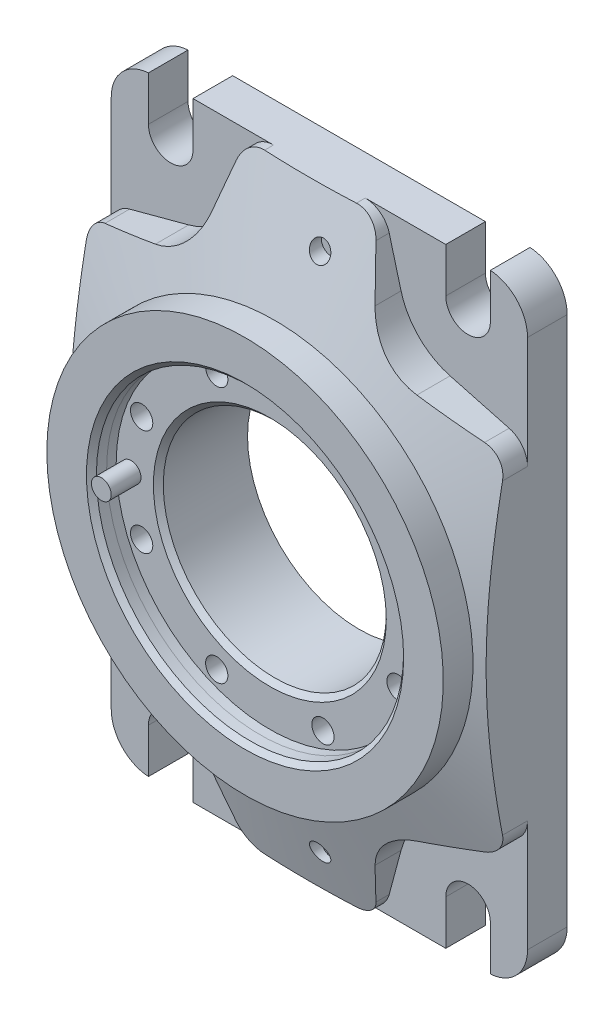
ISO-10303-21;
HEADER;
FILE_DESCRIPTION(('STEP AP214'),'2;1');
FILE_NAME('part.step','',(''),(''),'','','');
FILE_SCHEMA(('AUTOMOTIVE_DESIGN { 1 0 10303 214 1 1 1 1 }'));
ENDSEC;
DATA;
#1=APPLICATION_CONTEXT('core data for automotive mechanical design processes');
#2=APPLICATION_PROTOCOL_DEFINITION('international standard','automotive_design',2000,#1);
#3=PRODUCT_CONTEXT('',#1,'mechanical');
#4=PRODUCT('Part','Part','',(#3));
#5=PRODUCT_RELATED_PRODUCT_CATEGORY('part','',(#4));
#6=PRODUCT_DEFINITION_FORMATION('','',#4);
#7=PRODUCT_DEFINITION_CONTEXT('part definition',#1,'design');
#8=PRODUCT_DEFINITION('design','',#6,#7);
#9=PRODUCT_DEFINITION_SHAPE('','',#8);
#10=(LENGTH_UNIT() NAMED_UNIT(*) SI_UNIT(.MILLI.,.METRE.));
#11=(NAMED_UNIT(*) PLANE_ANGLE_UNIT() SI_UNIT($,.RADIAN.));
#12=(NAMED_UNIT(*) SI_UNIT($,.STERADIAN.) SOLID_ANGLE_UNIT());
#13=UNCERTAINTY_MEASURE_WITH_UNIT(LENGTH_MEASURE(1.E-05),#10,'distance_accuracy_value','');
#14=(GEOMETRIC_REPRESENTATION_CONTEXT(3) GLOBAL_UNCERTAINTY_ASSIGNED_CONTEXT((#13)) GLOBAL_UNIT_ASSIGNED_CONTEXT((#10,
#11,#12)) REPRESENTATION_CONTEXT('',''));
#15=CARTESIAN_POINT('',(0.,0.,0.));
#16=DIRECTION('',(0.,0.,1.));
#17=DIRECTION('',(1.,0.,0.));
#18=AXIS2_PLACEMENT_3D('',#15,#16,#17);
#19=CARTESIAN_POINT('',(0.,0.,0.));
#20=DIRECTION('',(0.,0.,1.));
#21=DIRECTION('',(1.,0.,0.));
#22=AXIS2_PLACEMENT_3D('',#19,#20,#21);
#23=PLANE('',#22);
#24=CARTESIAN_POINT('',(4.99999999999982,52.5,0.));
#25=DIRECTION('',(0.,0.,-1.));
#26=DIRECTION('',(-1.,0.,0.));
#27=AXIS2_PLACEMENT_3D('',#24,#25,#26);
#28=CIRCLE('',#27,3.);
#29=CARTESIAN_POINT('',(1.99999999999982,52.5,0.));
#30=VERTEX_POINT('',#29);
#31=EDGE_CURVE('E551',#30,#30,#28,.T.);
#32=ORIENTED_EDGE('',*,*,#31,.F.);
#33=EDGE_LOOP('',(#32));
#34=FACE_BOUND('',#33,.T.);
#35=CARTESIAN_POINT('',(5.00000000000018,-52.5,0.));
#36=DIRECTION('',(0.,0.,-1.));
#37=DIRECTION('',(-1.,0.,0.));
#38=AXIS2_PLACEMENT_3D('',#35,#36,#37);
#39=CIRCLE('',#38,3.);
#40=CARTESIAN_POINT('',(2.00000000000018,-52.5,0.));
#41=VERTEX_POINT('',#40);
#42=EDGE_CURVE('E554',#41,#41,#39,.T.);
#43=ORIENTED_EDGE('',*,*,#42,.F.);
#44=EDGE_LOOP('',(#43));
#45=FACE_BOUND('',#44,.T.);
#46=DIRECTION('',(1.,0.,0.));
#47=VECTOR('',#46,1.);
#48=CARTESIAN_POINT('',(-42.,-61.5,1.46642216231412E-13));
#49=LINE('',#48,#47);
#50=CARTESIAN_POINT('',(-25.5,-61.5,0.));
#51=VERTEX_POINT('',#50);
#52=CARTESIAN_POINT('',(25.5,-61.5,0.));
#53=VERTEX_POINT('',#52);
#54=EDGE_CURVE('E12',#51,#53,#49,.T.);
#55=ORIENTED_EDGE('',*,*,#54,.F.);
#56=DIRECTION('',(0.,-1.,0.));
#57=VECTOR('',#56,1.);
#58=CARTESIAN_POINT('',(-25.5,-52.5,0.));
#59=LINE('',#58,#57);
#60=CARTESIAN_POINT('',(-25.5,-52.5,0.));
#61=VERTEX_POINT('',#60);
#62=EDGE_CURVE('E838',#61,#51,#59,.T.);
#63=ORIENTED_EDGE('',*,*,#62,.F.);
#64=CARTESIAN_POINT('',(-30.,-52.5,1.04744440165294E-13));
#65=DIRECTION('',(0.,0.,1.));
#66=DIRECTION('',(1.,0.,0.));
#67=AXIS2_PLACEMENT_3D('',#64,#65,#66);
#68=CIRCLE('',#67,4.5);
#69=CARTESIAN_POINT('',(-34.5,-52.5,1.20456106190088E-13));
#70=VERTEX_POINT('',#69);
#71=EDGE_CURVE('E1192',#70,#61,#68,.F.);
#72=ORIENTED_EDGE('',*,*,#71,.F.);
#73=DIRECTION('',(0.,1.,0.));
#74=VECTOR('',#73,1.);
#75=CARTESIAN_POINT('',(-34.5,-52.5,1.20456106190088E-13));
#76=LINE('',#75,#74);
#77=CARTESIAN_POINT('',(-34.5,-61.4843597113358,1.20456106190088E-13));
#78=VERTEX_POINT('',#77);
#79=EDGE_CURVE('E1189',#78,#70,#76,.T.);
#80=ORIENTED_EDGE('',*,*,#79,.F.);
#81=CARTESIAN_POINT('',(-34.,-53.5,1.18710365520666E-13));
#82=DIRECTION('',(0.,0.,1.));
#83=DIRECTION('',(1.,0.,0.));
#84=AXIS2_PLACEMENT_3D('',#81,#82,#83);
#85=CIRCLE('',#84,8.);
#86=CARTESIAN_POINT('',(-42.,-53.5,1.46642216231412E-13));
#87=VERTEX_POINT('',#86);
#88=EDGE_CURVE('E1187',#78,#87,#85,.F.);
#89=ORIENTED_EDGE('',*,*,#88,.T.);
#90=DIRECTION('',(0.,-1.,0.));
#91=VECTOR('',#90,1.);
#92=CARTESIAN_POINT('',(-42.,-61.5,1.46642216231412E-13));
#93=LINE('',#92,#91);
#94=CARTESIAN_POINT('',(-42.,53.5,1.46642216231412E-13));
#95=VERTEX_POINT('',#94);
#96=EDGE_CURVE('E1184',#95,#87,#93,.T.);
#97=ORIENTED_EDGE('',*,*,#96,.F.);
#98=CARTESIAN_POINT('',(-34.,53.5,1.18710365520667E-13));
#99=DIRECTION('',(0.,0.,1.));
#100=DIRECTION('',(1.,0.,0.));
#101=AXIS2_PLACEMENT_3D('',#98,#99,#100);
#102=CIRCLE('',#101,8.);
#103=CARTESIAN_POINT('',(-34.5,61.4843597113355,1.20456106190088E-13));
#104=VERTEX_POINT('',#103);
#105=EDGE_CURVE('E1182',#95,#104,#102,.F.);
#106=ORIENTED_EDGE('',*,*,#105,.T.);
#107=DIRECTION('',(0.,1.,0.));
#108=VECTOR('',#107,1.);
#109=CARTESIAN_POINT('',(-34.5,52.5,1.20456106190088E-13));
#110=LINE('',#109,#108);
#111=CARTESIAN_POINT('',(-34.5,52.5,1.20456106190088E-13));
#112=VERTEX_POINT('',#111);
#113=EDGE_CURVE('E1179',#112,#104,#110,.T.);
#114=ORIENTED_EDGE('',*,*,#113,.F.);
#115=CARTESIAN_POINT('',(-30.,52.5,1.04744440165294E-13));
#116=DIRECTION('',(0.,0.,1.));
#117=DIRECTION('',(1.,0.,0.));
#118=AXIS2_PLACEMENT_3D('',#115,#116,#117);
#119=CIRCLE('',#118,4.5);
#120=CARTESIAN_POINT('',(-25.5,52.5,0.));
#121=VERTEX_POINT('',#120);
#122=EDGE_CURVE('E1176',#121,#112,#119,.F.);
#123=ORIENTED_EDGE('',*,*,#122,.F.);
#124=DIRECTION('',(0.,-1.,0.));
#125=VECTOR('',#124,1.);
#126=CARTESIAN_POINT('',(-25.5,52.5,0.));
#127=LINE('',#126,#125);
#128=CARTESIAN_POINT('',(-25.5,61.5,0.));
#129=VERTEX_POINT('',#128);
#130=EDGE_CURVE('E1173',#129,#121,#127,.T.);
#131=ORIENTED_EDGE('',*,*,#130,.F.);
#132=DIRECTION('',(-1.,0.,0.));
#133=VECTOR('',#132,1.);
#134=CARTESIAN_POINT('',(-42.,61.5,1.46642216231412E-13));
#135=LINE('',#134,#133);
#136=CARTESIAN_POINT('',(25.5,61.5,0.));
#137=VERTEX_POINT('',#136);
#138=EDGE_CURVE('E1170',#137,#129,#135,.T.);
#139=ORIENTED_EDGE('',*,*,#138,.F.);
#140=DIRECTION('',(0.,1.,0.));
#141=VECTOR('',#140,1.);
#142=CARTESIAN_POINT('',(25.5,52.5,0.));
#143=LINE('',#142,#141);
#144=CARTESIAN_POINT('',(25.5,52.5,0.));
#145=VERTEX_POINT('',#144);
#146=EDGE_CURVE('E1167',#145,#137,#143,.T.);
#147=ORIENTED_EDGE('',*,*,#146,.F.);
#148=CARTESIAN_POINT('',(30.,52.5,-1.04744440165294E-13));
#149=DIRECTION('',(0.,0.,1.));
#150=DIRECTION('',(1.,0.,0.));
#151=AXIS2_PLACEMENT_3D('',#148,#149,#150);
#152=CIRCLE('',#151,4.5);
#153=CARTESIAN_POINT('',(34.5,52.5,-1.20456106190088E-13));
#154=VERTEX_POINT('',#153);
#155=EDGE_CURVE('E1164',#154,#145,#152,.F.);
#156=ORIENTED_EDGE('',*,*,#155,.F.);
#157=DIRECTION('',(0.,-1.,0.));
#158=VECTOR('',#157,1.);
#159=CARTESIAN_POINT('',(34.5,52.5,-1.20456106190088E-13));
#160=LINE('',#159,#158);
#161=CARTESIAN_POINT('',(34.5,61.4843597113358,-1.20456106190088E-13));
#162=VERTEX_POINT('',#161);
#163=EDGE_CURVE('E1161',#162,#154,#160,.T.);
#164=ORIENTED_EDGE('',*,*,#163,.F.);
#165=CARTESIAN_POINT('',(34.,53.5,-1.18710365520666E-13));
#166=DIRECTION('',(0.,0.,1.));
#167=DIRECTION('',(1.,0.,0.));
#168=AXIS2_PLACEMENT_3D('',#165,#166,#167);
#169=CIRCLE('',#168,8.);
#170=CARTESIAN_POINT('',(42.,53.5,-1.46642216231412E-13));
#171=VERTEX_POINT('',#170);
#172=EDGE_CURVE('E1159',#162,#171,#169,.F.);
#173=ORIENTED_EDGE('',*,*,#172,.T.);
#174=DIRECTION('',(0.,1.,0.));
#175=VECTOR('',#174,1.);
#176=CARTESIAN_POINT('',(42.,1.46642216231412E-13,-1.46642216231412E-13));
#177=LINE('',#176,#175);
#178=CARTESIAN_POINT('',(42.,-53.5,-1.46642216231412E-13));
#179=VERTEX_POINT('',#178);
#180=EDGE_CURVE('E1154',#179,#171,#177,.T.);
#181=ORIENTED_EDGE('',*,*,#180,.F.);
#182=CARTESIAN_POINT('',(34.,-53.5,-1.18710365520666E-13));
#183=DIRECTION('',(0.,0.,1.));
#184=DIRECTION('',(1.,0.,0.));
#185=AXIS2_PLACEMENT_3D('',#182,#183,#184);
#186=CIRCLE('',#185,8.);
#187=CARTESIAN_POINT('',(34.5,-61.4843597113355,-1.20456106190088E-13));
#188=VERTEX_POINT('',#187);
#189=EDGE_CURVE('E1151',#179,#188,#186,.F.);
#190=ORIENTED_EDGE('',*,*,#189,.T.);
#191=DIRECTION('',(0.,-1.,0.));
#192=VECTOR('',#191,1.);
#193=CARTESIAN_POINT('',(34.5,-52.5,-1.20456106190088E-13));
#194=LINE('',#193,#192);
#195=CARTESIAN_POINT('',(34.5,-52.5,-1.20456106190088E-13));
#196=VERTEX_POINT('',#195);
#197=EDGE_CURVE('E1150',#196,#188,#194,.T.);
#198=ORIENTED_EDGE('',*,*,#197,.F.);
#199=CARTESIAN_POINT('',(30.,-52.5,-1.04744440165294E-13));
#200=DIRECTION('',(0.,0.,1.));
#201=DIRECTION('',(1.,0.,0.));
#202=AXIS2_PLACEMENT_3D('',#199,#200,#201);
#203=CIRCLE('',#202,4.5);
#204=CARTESIAN_POINT('',(25.5,-52.5,0.));
#205=VERTEX_POINT('',#204);
#206=EDGE_CURVE('E39',#205,#196,#203,.F.);
#207=ORIENTED_EDGE('',*,*,#206,.F.);
#208=DIRECTION('',(0.,1.,0.));
#209=VECTOR('',#208,1.);
#210=CARTESIAN_POINT('',(25.5,-52.5,0.));
#211=LINE('',#210,#209);
#212=EDGE_CURVE('E29',#53,#205,#211,.T.);
#213=ORIENTED_EDGE('',*,*,#212,.F.);
#214=EDGE_LOOP('',(#55,#63,#72,#80,#89,#97,#106,#114,#123,#131,#139,#147,#156,#164,#173,#181,
#190,#198,#207,#213));
#215=FACE_BOUND('',#214,.T.);
#216=CARTESIAN_POINT('',(-10.7151361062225,25.868626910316,0.));
#217=DIRECTION('',(0.,0.,1.));
#218=DIRECTION('',(1.,0.,0.));
#219=AXIS2_PLACEMENT_3D('',#216,#217,#218);
#220=CIRCLE('',#219,4.);
#221=CARTESIAN_POINT('',(-6.71513610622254,25.868626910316,0.));
#222=VERTEX_POINT('',#221);
#223=EDGE_CURVE('E561',#222,#222,#220,.T.);
#224=ORIENTED_EDGE('',*,*,#223,.T.);
#225=EDGE_LOOP('',(#224));
#226=FACE_BOUND('',#225,.T.);
#227=CARTESIAN_POINT('',(-25.868626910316,10.7151361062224,0.));
#228=DIRECTION('',(0.,0.,1.));
#229=DIRECTION('',(1.,0.,0.));
#230=AXIS2_PLACEMENT_3D('',#227,#228,#229);
#231=CIRCLE('',#230,4.);
#232=CARTESIAN_POINT('',(-21.868626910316,10.7151361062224,0.));
#233=VERTEX_POINT('',#232);
#234=EDGE_CURVE('E565',#233,#233,#231,.T.);
#235=ORIENTED_EDGE('',*,*,#234,.T.);
#236=EDGE_LOOP('',(#235));
#237=FACE_BOUND('',#236,.T.);
#238=CARTESIAN_POINT('',(-28.,0.,0.));
#239=DIRECTION('',(0.,0.,1.));
#240=DIRECTION('',(1.,0.,0.));
#241=AXIS2_PLACEMENT_3D('',#238,#239,#240);
#242=CIRCLE('',#241,1.);
#243=CARTESIAN_POINT('',(-27.,0.,0.));
#244=VERTEX_POINT('',#243);
#245=EDGE_CURVE('E569',#244,#244,#242,.T.);
#246=ORIENTED_EDGE('',*,*,#245,.T.);
#247=EDGE_LOOP('',(#246));
#248=FACE_BOUND('',#247,.T.);
#249=CARTESIAN_POINT('',(-25.868626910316,-10.7151361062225,0.));
#250=DIRECTION('',(0.,0.,1.));
#251=DIRECTION('',(1.,0.,0.));
#252=AXIS2_PLACEMENT_3D('',#249,#250,#251);
#253=CIRCLE('',#252,4.);
#254=CARTESIAN_POINT('',(-21.868626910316,-10.7151361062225,0.));
#255=VERTEX_POINT('',#254);
#256=EDGE_CURVE('E573',#255,#255,#253,.T.);
#257=ORIENTED_EDGE('',*,*,#256,.T.);
#258=EDGE_LOOP('',(#257));
#259=FACE_BOUND('',#258,.T.);
#260=CARTESIAN_POINT('',(-10.7151361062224,-25.868626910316,0.));
#261=DIRECTION('',(0.,0.,1.));
#262=DIRECTION('',(1.,0.,0.));
#263=AXIS2_PLACEMENT_3D('',#260,#261,#262);
#264=CIRCLE('',#263,4.);
#265=CARTESIAN_POINT('',(-6.71513610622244,-25.868626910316,0.));
#266=VERTEX_POINT('',#265);
#267=EDGE_CURVE('E577',#266,#266,#264,.T.);
#268=ORIENTED_EDGE('',*,*,#267,.T.);
#269=EDGE_LOOP('',(#268));
#270=FACE_BOUND('',#269,.T.);
#271=CARTESIAN_POINT('',(0.,0.,0.));
#272=DIRECTION('',(0.,0.,1.));
#273=DIRECTION('',(1.,0.,0.));
#274=AXIS2_PLACEMENT_3D('',#271,#272,#273);
#275=CIRCLE('',#274,22.5);
#276=CARTESIAN_POINT('',(22.5,0.,0.));
#277=VERTEX_POINT('',#276);
#278=EDGE_CURVE('E581',#277,#277,#275,.T.);
#279=ORIENTED_EDGE('',*,*,#278,.T.);
#280=EDGE_LOOP('',(#279));
#281=FACE_BOUND('',#280,.T.);
#282=CARTESIAN_POINT('',(10.7151361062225,-25.868626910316,0.));
#283=DIRECTION('',(0.,0.,1.));
#284=DIRECTION('',(1.,0.,0.));
#285=AXIS2_PLACEMENT_3D('',#282,#283,#284);
#286=CIRCLE('',#285,4.);
#287=CARTESIAN_POINT('',(14.7151361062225,-25.868626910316,0.));
#288=VERTEX_POINT('',#287);
#289=EDGE_CURVE('E585',#288,#288,#286,.T.);
#290=ORIENTED_EDGE('',*,*,#289,.T.);
#291=EDGE_LOOP('',(#290));
#292=FACE_BOUND('',#291,.T.);
#293=CARTESIAN_POINT('',(25.8686269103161,-10.7151361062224,0.));
#294=DIRECTION('',(0.,0.,1.));
#295=DIRECTION('',(1.,0.,0.));
#296=AXIS2_PLACEMENT_3D('',#293,#294,#295);
#297=CIRCLE('',#296,4.);
#298=CARTESIAN_POINT('',(29.8686269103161,-10.7151361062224,-1.11110440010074E-13));
#299=VERTEX_POINT('',#298);
#300=EDGE_CURVE('E589',#299,#299,#297,.T.);
#301=ORIENTED_EDGE('',*,*,#300,.T.);
#302=EDGE_LOOP('',(#301));
#303=FACE_BOUND('',#302,.T.);
#304=CARTESIAN_POINT('',(25.868626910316,10.7151361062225,0.));
#305=DIRECTION('',(0.,0.,1.));
#306=DIRECTION('',(1.,0.,0.));
#307=AXIS2_PLACEMENT_3D('',#304,#305,#306);
#308=CIRCLE('',#307,4.);
#309=CARTESIAN_POINT('',(29.868626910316,10.7151361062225,-1.11110440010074E-13));
#310=VERTEX_POINT('',#309);
#311=EDGE_CURVE('E593',#310,#310,#308,.T.);
#312=ORIENTED_EDGE('',*,*,#311,.T.);
#313=EDGE_LOOP('',(#312));
#314=FACE_BOUND('',#313,.T.);
#315=CARTESIAN_POINT('',(10.7151361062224,25.868626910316,0.));
#316=DIRECTION('',(0.,0.,1.));
#317=DIRECTION('',(1.,0.,0.));
#318=AXIS2_PLACEMENT_3D('',#315,#316,#317);
#319=CIRCLE('',#318,4.);
#320=CARTESIAN_POINT('',(14.7151361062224,25.868626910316,0.));
#321=VERTEX_POINT('',#320);
#322=EDGE_CURVE('E596',#321,#321,#319,.T.);
#323=ORIENTED_EDGE('',*,*,#322,.T.);
#324=EDGE_LOOP('',(#323));
#325=FACE_BOUND('',#324,.T.);
#326=ADVANCED_FACE('F21',(#34,#45,#215,#226,#237,#248,#259,#270,#281,#292,#303,#314,#325),#23,.F.);
#327=CARTESIAN_POINT('',(-42.,-61.5,23.));
#328=DIRECTION('',(0.,1.,0.));
#329=DIRECTION('',(-1.,0.,0.));
#330=AXIS2_PLACEMENT_3D('',#327,#328,#329);
#331=PLANE('',#330);
#332=DIRECTION('',(0.,0.,-1.));
#333=VECTOR('',#332,1.);
#334=CARTESIAN_POINT('',(-25.5,-61.5,23.));
#335=LINE('',#334,#333);
#336=CARTESIAN_POINT('',(-25.5,-61.5,8.00000000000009));
#337=VERTEX_POINT('',#336);
#338=EDGE_CURVE('E1123',#51,#337,#335,.F.);
#339=ORIENTED_EDGE('',*,*,#338,.F.);
#340=ORIENTED_EDGE('',*,*,#54,.T.);
#341=DIRECTION('',(0.,0.,1.));
#342=VECTOR('',#341,1.);
#343=CARTESIAN_POINT('',(25.5,-61.5,23.));
#344=LINE('',#343,#342);
#345=CARTESIAN_POINT('',(25.5,-61.5,7.99999999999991));
#346=VERTEX_POINT('',#345);
#347=EDGE_CURVE('E824',#53,#346,#344,.T.);
#348=ORIENTED_EDGE('',*,*,#347,.T.);
#349=DIRECTION('',(-1.,0.,0.));
#350=VECTOR('',#349,1.);
#351=CARTESIAN_POINT('',(-42.,-61.5,8.00000000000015));
#352=LINE('',#351,#350);
#353=CARTESIAN_POINT('',(9.25795580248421,-61.5,8.));
#354=VERTEX_POINT('',#353);
#355=EDGE_CURVE('E679',#354,#346,#352,.F.);
#356=ORIENTED_EDGE('',*,*,#355,.F.);
#357=DIRECTION('',(0.,0.,1.));
#358=VECTOR('',#357,1.);
#359=CARTESIAN_POINT('',(9.25795580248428,-61.5,23.));
#360=LINE('',#359,#358);
#361=CARTESIAN_POINT('',(9.25795568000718,-61.5,9.78908201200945));
#362=VERTEX_POINT('',#361);
#363=EDGE_CURVE('E676',#362,#354,#360,.F.);
#364=ORIENTED_EDGE('',*,*,#363,.F.);
#365=CARTESIAN_POINT('',(-9.25795580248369,-61.5,9.78908200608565));
#366=CARTESIAN_POINT('',(-8.48682757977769,-61.4999999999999,9.82638436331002));
#367=CARTESIAN_POINT('',(-7.71548456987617,-61.4999999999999,9.85912948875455));
#368=CARTESIAN_POINT('',(-6.17245903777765,-61.4999999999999,9.9153788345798));
#369=CARTESIAN_POINT('',(-5.40077651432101,-61.4999999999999,9.93888302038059));
#370=CARTESIAN_POINT('',(-3.08630596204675,-61.4999999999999,9.99532115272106));
#371=CARTESIAN_POINT('',(-1.54315301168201,-61.4999999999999,10.0142265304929));
#372=CARTESIAN_POINT('',(1.54315288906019,-61.4999999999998,10.0142265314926));
#373=CARTESIAN_POINT('',(3.08630583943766,-61.4999999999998,9.99532115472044));
#374=CARTESIAN_POINT('',(5.40077639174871,-61.4999999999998,9.93888302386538));
#375=CARTESIAN_POINT('',(6.17245891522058,-61.4999999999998,9.91537883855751));
#376=CARTESIAN_POINT('',(7.7154844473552,-61.4999999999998,9.85912949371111));
#377=CARTESIAN_POINT('',(8.48682745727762,-61.4999999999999,9.82638436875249));
#378=CARTESIAN_POINT('',(9.25795568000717,-61.5,9.78908201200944));
#379=B_SPLINE_CURVE_WITH_KNOTS('',3,(#365,#366,#367,#368,#369,#370,#371,#372,#373,#374,#375,
#376,#377,#378),.UNSPECIFIED.,.F.,.F.,(4,2,2,2,2,2,4),(0.,2.31606412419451,4.6321369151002,
9.26145408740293,13.8907712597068,16.206844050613,18.5229081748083),.UNSPECIFIED.);
#380=CARTESIAN_POINT('',(-9.25795580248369,-61.5,9.78908200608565));
#381=VERTEX_POINT('',#380);
#382=EDGE_CURVE('E439',#381,#362,#379,.T.);
#383=ORIENTED_EDGE('',*,*,#382,.F.);
#384=DIRECTION('',(0.,0.,1.));
#385=VECTOR('',#384,1.);
#386=CARTESIAN_POINT('',(-9.25795580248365,-61.5,23.));
#387=LINE('',#386,#385);
#388=CARTESIAN_POINT('',(-9.2579558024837,-61.5,8.));
#389=VERTEX_POINT('',#388);
#390=EDGE_CURVE('E680',#389,#381,#387,.T.);
#391=ORIENTED_EDGE('',*,*,#390,.F.);
#392=DIRECTION('',(-1.,0.,0.));
#393=VECTOR('',#392,1.);
#394=CARTESIAN_POINT('',(-42.,-61.5,8.00000000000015));
#395=LINE('',#394,#393);
#396=EDGE_CURVE('E675',#337,#389,#395,.F.);
#397=ORIENTED_EDGE('',*,*,#396,.F.);
#398=EDGE_LOOP('',(#339,#340,#348,#356,#364,#383,#391,#397));
#399=FACE_BOUND('',#398,.T.);
#400=ADVANCED_FACE('F535',(#399),#331,.F.);
#401=CARTESIAN_POINT('',(25.5,-52.5,-2.00000000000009));
#402=DIRECTION('',(-1.,0.,0.));
#403=DIRECTION('',(0.,-1.,0.));
#404=AXIS2_PLACEMENT_3D('',#401,#402,#403);
#405=PLANE('',#404);
#406=ORIENTED_EDGE('',*,*,#347,.F.);
#407=ORIENTED_EDGE('',*,*,#212,.T.);
#408=DIRECTION('',(0.,0.,1.));
#409=VECTOR('',#408,1.);
#410=CARTESIAN_POINT('',(25.5,-52.5,7.99999999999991));
#411=LINE('',#410,#409);
#412=CARTESIAN_POINT('',(25.5,-52.5,7.99999999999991));
#413=VERTEX_POINT('',#412);
#414=EDGE_CURVE('E673',#205,#413,#411,.T.);
#415=ORIENTED_EDGE('',*,*,#414,.T.);
#416=DIRECTION('',(0.,-1.,0.));
#417=VECTOR('',#416,1.);
#418=CARTESIAN_POINT('',(25.5,0.,7.99999999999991));
#419=LINE('',#418,#417);
#420=EDGE_CURVE('E816',#413,#346,#419,.T.);
#421=ORIENTED_EDGE('',*,*,#420,.T.);
#422=EDGE_LOOP('',(#406,#407,#415,#421));
#423=FACE_BOUND('',#422,.T.);
#424=ADVANCED_FACE('F531',(#423),#405,.F.);
#425=CARTESIAN_POINT('',(30.,-52.5,7.9999999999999));
#426=DIRECTION('',(0.,0.,1.));
#427=DIRECTION('',(1.,0.,0.));
#428=AXIS2_PLACEMENT_3D('',#425,#426,#427);
#429=CYLINDRICAL_SURFACE('',#428,4.5);
#430=ORIENTED_EDGE('',*,*,#414,.F.);
#431=ORIENTED_EDGE('',*,*,#206,.T.);
#432=DIRECTION('',(0.,0.,1.));
#433=VECTOR('',#432,1.);
#434=CARTESIAN_POINT('',(34.5,-52.5,-2.00000000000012));
#435=LINE('',#434,#433);
#436=CARTESIAN_POINT('',(34.5,-52.5,7.99999999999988));
#437=VERTEX_POINT('',#436);
#438=EDGE_CURVE('E671',#196,#437,#435,.T.);
#439=ORIENTED_EDGE('',*,*,#438,.T.);
#440=CARTESIAN_POINT('',(30.,-52.5,7.9999999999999));
#441=DIRECTION('',(0.,0.,1.));
#442=DIRECTION('',(1.,0.,0.));
#443=AXIS2_PLACEMENT_3D('',#440,#441,#442);
#444=CIRCLE('',#443,4.5);
#445=EDGE_CURVE('E813',#437,#413,#444,.T.);
#446=ORIENTED_EDGE('',*,*,#445,.T.);
#447=EDGE_LOOP('',(#430,#431,#439,#446));
#448=FACE_BOUND('',#447,.T.);
#449=ADVANCED_FACE('F527',(#448),#429,.F.);
#450=CARTESIAN_POINT('',(34.5,-52.5,-2.00000000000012));
#451=DIRECTION('',(1.,0.,0.));
#452=DIRECTION('',(0.,1.,0.));
#453=AXIS2_PLACEMENT_3D('',#450,#451,#452);
#454=PLANE('',#453);
#455=ORIENTED_EDGE('',*,*,#438,.F.);
#456=ORIENTED_EDGE('',*,*,#197,.T.);
#457=DIRECTION('',(0.,0.,-1.));
#458=VECTOR('',#457,1.);
#459=CARTESIAN_POINT('',(34.5,-61.4843597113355,23.));
#460=LINE('',#459,#458);
#461=CARTESIAN_POINT('',(34.5,-61.4843597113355,7.99999999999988));
#462=VERTEX_POINT('',#461);
#463=EDGE_CURVE('E803',#188,#462,#460,.F.);
#464=ORIENTED_EDGE('',*,*,#463,.T.);
#465=DIRECTION('',(0.,1.,0.));
#466=VECTOR('',#465,1.);
#467=CARTESIAN_POINT('',(34.5,1.20456106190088E-13,7.99999999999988));
#468=LINE('',#467,#466);
#469=EDGE_CURVE('E809',#462,#437,#468,.T.);
#470=ORIENTED_EDGE('',*,*,#469,.T.);
#471=EDGE_LOOP('',(#455,#456,#464,#470));
#472=FACE_BOUND('',#471,.T.);
#473=ADVANCED_FACE('F523',(#472),#454,.F.);
#474=CARTESIAN_POINT('',(34.,-53.5,23.));
#475=DIRECTION('',(0.,0.,-1.));
#476=DIRECTION('',(-1.,0.,0.));
#477=AXIS2_PLACEMENT_3D('',#474,#475,#476);
#478=CYLINDRICAL_SURFACE('',#477,8.);
#479=ORIENTED_EDGE('',*,*,#189,.F.);
#480=DIRECTION('',(0.,0.,1.));
#481=VECTOR('',#480,1.);
#482=CARTESIAN_POINT('',(42.,-53.5,23.));
#483=LINE('',#482,#481);
#484=CARTESIAN_POINT('',(42.,-53.5,7.99999999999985));
#485=VERTEX_POINT('',#484);
#486=EDGE_CURVE('E668',#179,#485,#483,.T.);
#487=ORIENTED_EDGE('',*,*,#486,.T.);
#488=CARTESIAN_POINT('',(34.,-53.5,7.99999999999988));
#489=DIRECTION('',(0.,0.,-1.));
#490=DIRECTION('',(-1.,0.,0.));
#491=AXIS2_PLACEMENT_3D('',#488,#489,#490);
#492=CIRCLE('',#491,8.);
#493=EDGE_CURVE('E667',#485,#462,#492,.T.);
#494=ORIENTED_EDGE('',*,*,#493,.T.);
#495=ORIENTED_EDGE('',*,*,#463,.F.);
#496=EDGE_LOOP('',(#479,#487,#494,#495));
#497=FACE_BOUND('',#496,.T.);
#498=ADVANCED_FACE('F520',(#497),#478,.T.);
#499=CARTESIAN_POINT('',(42.,1.46642216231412E-13,23.));
#500=DIRECTION('',(-1.,0.,0.));
#501=DIRECTION('',(0.,-1.,0.));
#502=AXIS2_PLACEMENT_3D('',#499,#500,#501);
#503=PLANE('',#502);
#504=ORIENTED_EDGE('',*,*,#486,.F.);
#505=ORIENTED_EDGE('',*,*,#180,.T.);
#506=DIRECTION('',(0.,0.,-1.));
#507=VECTOR('',#506,1.);
#508=CARTESIAN_POINT('',(42.,53.5,23.));
#509=LINE('',#508,#507);
#510=CARTESIAN_POINT('',(42.,53.5,7.99999999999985));
#511=VERTEX_POINT('',#510);
#512=EDGE_CURVE('E659',#511,#171,#509,.T.);
#513=ORIENTED_EDGE('',*,*,#512,.F.);
#514=DIRECTION('',(0.,-1.,0.));
#515=VECTOR('',#514,1.);
#516=CARTESIAN_POINT('',(42.,1.46642216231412E-13,7.99999999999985));
#517=LINE('',#516,#515);
#518=CARTESIAN_POINT('',(42.,30.9541082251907,7.99999999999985));
#519=VERTEX_POINT('',#518);
#520=EDGE_CURVE('E666',#519,#511,#517,.F.);
#521=ORIENTED_EDGE('',*,*,#520,.F.);
#522=DIRECTION('',(0.,0.,1.));
#523=VECTOR('',#522,1.);
#524=CARTESIAN_POINT('',(42.,30.9541082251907,23.));
#525=LINE('',#524,#523);
#526=CARTESIAN_POINT('',(42.,30.9541081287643,13.0443325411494));
#527=VERTEX_POINT('',#526);
#528=EDGE_CURVE('E663',#527,#519,#525,.F.);
#529=ORIENTED_EDGE('',*,*,#528,.F.);
#530=CARTESIAN_POINT('',(42.,-30.9541082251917,13.0443325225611));
#531=CARTESIAN_POINT('',(42.,-29.8302551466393,13.2609490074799));
#532=CARTESIAN_POINT('',(42.0000000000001,-28.7049594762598,13.4702534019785));
#533=CARTESIAN_POINT('',(42.0000000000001,-26.4512977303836,13.8721863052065));
#534=CARTESIAN_POINT('',(42.0000000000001,-25.3229313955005,14.0648133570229));
#535=CARTESIAN_POINT('',(42.,-23.0622013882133,14.4314534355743));
#536=CARTESIAN_POINT('',(42.,-21.9298351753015,14.6054508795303));
#537=CARTESIAN_POINT('',(42.,-19.6620834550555,14.9324054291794));
#538=CARTESIAN_POINT('',(42.,-18.5266980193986,15.0853630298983));
#539=CARTESIAN_POINT('',(42.,-16.2587913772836,15.3672575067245));
#540=CARTESIAN_POINT('',(42.,-15.1262849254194,15.49631247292));
#541=CARTESIAN_POINT('',(42.,-12.8586611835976,15.7291933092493));
#542=CARTESIAN_POINT('',(42.,-11.7235438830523,15.8330190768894));
#543=CARTESIAN_POINT('',(42.,-9.45147844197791,16.0134672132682));
#544=CARTESIAN_POINT('',(42.,-8.3145309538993,16.0900977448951));
#545=CARTESIAN_POINT('',(42.,-6.03905694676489,16.2146276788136));
#546=CARTESIAN_POINT('',(42.,-4.90053043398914,16.262527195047));
#547=CARTESIAN_POINT('',(42.,-2.63249930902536,16.3282635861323));
#548=CARTESIAN_POINT('',(42.,-1.50300220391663,16.3463578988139));
#549=CARTESIAN_POINT('',(42.,0.756078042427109,16.3528843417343));
#550=CARTESIAN_POINT('',(42.,1.88566118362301,16.3413164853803));
#551=CARTESIAN_POINT('',(42.,4.14423751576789,16.288773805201));
#552=CARTESIAN_POINT('',(42.,5.27323064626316,16.2477964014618));
#553=CARTESIAN_POINT('',(42.,7.52981350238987,16.1373201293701));
#554=CARTESIAN_POINT('',(42.,8.65740322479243,16.0678211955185));
#555=CARTESIAN_POINT('',(41.9999999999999,10.9114088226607,15.9016644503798));
#556=CARTESIAN_POINT('',(41.9999999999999,12.0378232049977,15.8049865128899));
#557=CARTESIAN_POINT('',(41.9999999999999,14.2881962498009,15.5863172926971));
#558=CARTESIAN_POINT('',(41.9999999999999,15.4121548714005,15.4643255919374));
#559=CARTESIAN_POINT('',(41.9999999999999,17.6572590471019,15.1971056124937));
#560=CARTESIAN_POINT('',(41.9999999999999,18.7784046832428,15.0518780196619));
#561=CARTESIAN_POINT('',(41.9999999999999,21.0177473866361,14.7403573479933));
#562=CARTESIAN_POINT('',(42.,22.1359444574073,14.5740642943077));
#563=CARTESIAN_POINT('',(42.,24.7759280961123,14.1585943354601));
#564=CARTESIAN_POINT('',(41.9999999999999,26.2964344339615,13.9012836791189));
#565=CARTESIAN_POINT('',(41.9999999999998,29.3320941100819,13.3566798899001));
#566=CARTESIAN_POINT('',(41.9999999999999,30.8472472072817,13.0693854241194));
#567=CARTESIAN_POINT('',(41.9999999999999,33.8727887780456,12.4693970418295));
#568=CARTESIAN_POINT('',(41.9999999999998,35.3831763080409,12.1566983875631));
#569=CARTESIAN_POINT('',(41.9999999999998,38.3993351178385,11.5099558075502));
#570=CARTESIAN_POINT('',(41.9999999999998,39.9051064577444,11.1759121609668));
#571=CARTESIAN_POINT('',(41.9999999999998,42.9136462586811,10.4896070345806));
#572=CARTESIAN_POINT('',(41.9999999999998,44.4164116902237,10.1373323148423));
#573=CARTESIAN_POINT('',(41.9999999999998,47.4183025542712,9.4176215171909));
#574=CARTESIAN_POINT('',(41.9999999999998,48.9174279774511,9.05018540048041));
#575=CARTESIAN_POINT('',(41.9999999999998,51.9123341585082,8.30253451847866));
#576=CARTESIAN_POINT('',(41.9999999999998,53.4081152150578,7.92232094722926));
#577=CARTESIAN_POINT('',(41.9999999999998,56.3968655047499,7.15102297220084));
#578=CARTESIAN_POINT('',(41.9999999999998,57.8898347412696,6.75993858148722));
#579=CARTESIAN_POINT('',(41.9999999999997,60.8788615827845,5.96703026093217));
#580=CARTESIAN_POINT('',(41.9999999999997,62.3749100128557,5.56517178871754));
#581=CARTESIAN_POINT('',(41.9999999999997,65.3648344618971,4.75346091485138));
#582=CARTESIAN_POINT('',(41.9999999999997,66.8587104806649,4.34360851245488));
#583=CARTESIAN_POINT('',(41.9999999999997,69.8445781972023,3.51702046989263));
#584=CARTESIAN_POINT('',(41.9999999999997,71.3365698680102,3.10028473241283));
#585=CARTESIAN_POINT('',(41.9999999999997,74.3188780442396,2.2608585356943));
#586=CARTESIAN_POINT('',(41.9999999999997,75.809194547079,1.83816806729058));
#587=CARTESIAN_POINT('',(41.9999999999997,80.2765909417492,0.562750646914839));
#588=CARTESIAN_POINT('',(41.9999999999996,83.2514671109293,-0.297697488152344));
#589=CARTESIAN_POINT('',(41.9999999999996,89.1965908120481,-2.03433195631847));
#590=CARTESIAN_POINT('',(41.9999999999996,92.1668383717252,-2.91051819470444));
#591=CARTESIAN_POINT('',(41.9999999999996,98.2139803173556,-4.70798198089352));
#592=CARTESIAN_POINT('',(41.9999999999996,101.290736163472,-5.62972522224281));
#593=CARTESIAN_POINT('',(41.9999999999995,107.441111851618,-7.48361945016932));
#594=CARTESIAN_POINT('',(41.9999999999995,110.514731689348,-8.41577045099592));
#595=CARTESIAN_POINT('',(41.9999999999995,116.659866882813,-10.2885239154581));
#596=CARTESIAN_POINT('',(41.9999999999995,119.731381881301,-11.2291275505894));
#597=CARTESIAN_POINT('',(41.9999999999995,125.872335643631,-13.1170785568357));
#598=CARTESIAN_POINT('',(41.9999999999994,128.941774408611,-14.0644259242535));
#599=CARTESIAN_POINT('',(41.9999999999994,135.056465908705,-15.9576977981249));
#600=CARTESIAN_POINT('',(41.9999999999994,138.101731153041,-16.9035819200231));
#601=CARTESIAN_POINT('',(41.9999999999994,144.190849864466,-18.7998852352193));
#602=CARTESIAN_POINT('',(41.9999999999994,147.234703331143,-19.7503044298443));
#603=CARTESIAN_POINT('',(41.9999999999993,153.320741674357,-21.6547937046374));
#604=CARTESIAN_POINT('',(41.9999999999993,156.362926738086,-22.6088631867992));
#605=CARTESIAN_POINT('',(41.9999999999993,162.446275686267,-24.5202428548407));
#606=CARTESIAN_POINT('',(41.9999999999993,165.487439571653,-25.4775530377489));
#607=CARTESIAN_POINT('',(41.9999999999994,168.528179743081,-26.4362050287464));
#608=B_SPLINE_CURVE_WITH_KNOTS('',3,(#530,#531,#532,#533,#534,#535,#536,#537,#538,#539,#540,
#541,#542,#543,#544,#545,#546,#547,#548,#549,#550,#551,#552,#553,#554,#555,#556,#557,#558,#559,
#560,#561,#562,#563,#564,#565,#566,#567,#568,#569,#570,#571,#572,#573,#574,#575,#576,#577,#578,
#579,#580,#581,#582,#583,#584,#585,#586,#587,#588,#589,#590,#591,#592,#593,#594,#595,#596,#597,
#598,#599,#600,#601,#602,#603,#604,#605,#606,#607),.UNSPECIFIED.,.F.,.F.,(4,2,2,2,2,2,2,2,2,2,2,
2,2,2,2,2,2,2,2,2,2,2,2,2,2,2,2,2,2,2,2,2,2,2,2,2,2,2,4),(0.,3.43363992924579,6.86757951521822,
10.3043693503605,13.7410783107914,17.1603269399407,20.5795894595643,23.9978247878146,
27.4160465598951,30.8045861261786,34.1931241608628,37.5819594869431,40.9708025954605,
44.3621618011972,47.7535770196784,51.1448921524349,54.5362032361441,59.1622007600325,
63.7884040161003,68.4154720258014,73.0424795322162,77.6728957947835,82.3033239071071,
86.9333205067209,91.5633115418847,96.2105280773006,100.857745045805,105.505027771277,
110.152317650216,119.442695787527,128.733018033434,138.3685705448,148.00413624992,
157.641058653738,167.277975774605,176.844320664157,186.41066835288,195.975510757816,
205.540344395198),.UNSPECIFIED.);
#609=CARTESIAN_POINT('',(42.,-30.9541082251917,13.0443325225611));
#610=VERTEX_POINT('',#609);
#611=EDGE_CURVE('E447',#610,#527,#608,.T.);
#612=ORIENTED_EDGE('',*,*,#611,.F.);
#613=DIRECTION('',(0.,0.,1.));
#614=VECTOR('',#613,1.);
#615=CARTESIAN_POINT('',(42.,-30.9541082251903,23.));
#616=LINE('',#615,#614);
#617=CARTESIAN_POINT('',(42.,-30.9541082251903,7.99999999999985));
#618=VERTEX_POINT('',#617);
#619=EDGE_CURVE('E733',#618,#610,#616,.T.);
#620=ORIENTED_EDGE('',*,*,#619,.F.);
#621=DIRECTION('',(0.,-1.,0.));
#622=VECTOR('',#621,1.);
#623=CARTESIAN_POINT('',(42.,1.46642216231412E-13,7.99999999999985));
#624=LINE('',#623,#622);
#625=EDGE_CURVE('E670',#485,#618,#624,.F.);
#626=ORIENTED_EDGE('',*,*,#625,.F.);
#627=EDGE_LOOP('',(#504,#505,#513,#521,#529,#612,#620,#626));
#628=FACE_BOUND('',#627,.T.);
#629=ADVANCED_FACE('F476',(#628),#503,.F.);
#630=CARTESIAN_POINT('',(34.,53.5,23.));
#631=DIRECTION('',(0.,0.,-1.));
#632=DIRECTION('',(-1.,0.,0.));
#633=AXIS2_PLACEMENT_3D('',#630,#631,#632);
#634=CYLINDRICAL_SURFACE('',#633,8.);
#635=ORIENTED_EDGE('',*,*,#172,.F.);
#636=DIRECTION('',(0.,0.,-1.));
#637=VECTOR('',#636,1.);
#638=CARTESIAN_POINT('',(34.5,61.4843597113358,23.));
#639=LINE('',#638,#637);
#640=CARTESIAN_POINT('',(34.5,61.4843597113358,7.99999999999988));
#641=VERTEX_POINT('',#640);
#642=EDGE_CURVE('E831',#162,#641,#639,.F.);
#643=ORIENTED_EDGE('',*,*,#642,.T.);
#644=CARTESIAN_POINT('',(34.,53.5,7.99999999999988));
#645=DIRECTION('',(0.,0.,-1.));
#646=DIRECTION('',(-1.,0.,0.));
#647=AXIS2_PLACEMENT_3D('',#644,#645,#646);
#648=CIRCLE('',#647,8.);
#649=EDGE_CURVE('E662',#641,#511,#648,.T.);
#650=ORIENTED_EDGE('',*,*,#649,.T.);
#651=ORIENTED_EDGE('',*,*,#512,.T.);
#652=EDGE_LOOP('',(#635,#643,#650,#651));
#653=FACE_BOUND('',#652,.T.);
#654=ADVANCED_FACE('F515',(#653),#634,.T.);
#655=CARTESIAN_POINT('',(34.5,52.5,-2.00000000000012));
#656=DIRECTION('',(1.,0.,0.));
#657=DIRECTION('',(0.,1.,0.));
#658=AXIS2_PLACEMENT_3D('',#655,#656,#657);
#659=PLANE('',#658);
#660=ORIENTED_EDGE('',*,*,#642,.F.);
#661=ORIENTED_EDGE('',*,*,#163,.T.);
#662=DIRECTION('',(0.,0.,1.));
#663=VECTOR('',#662,1.);
#664=CARTESIAN_POINT('',(34.5,52.5,7.99999999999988));
#665=LINE('',#664,#663);
#666=CARTESIAN_POINT('',(34.5,52.5,7.99999999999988));
#667=VERTEX_POINT('',#666);
#668=EDGE_CURVE('E657',#154,#667,#665,.T.);
#669=ORIENTED_EDGE('',*,*,#668,.T.);
#670=DIRECTION('',(0.,-1.,0.));
#671=VECTOR('',#670,1.);
#672=CARTESIAN_POINT('',(34.5,52.5,7.99999999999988));
#673=LINE('',#672,#671);
#674=EDGE_CURVE('E833',#641,#667,#673,.T.);
#675=ORIENTED_EDGE('',*,*,#674,.F.);
#676=EDGE_LOOP('',(#660,#661,#669,#675));
#677=FACE_BOUND('',#676,.T.);
#678=ADVANCED_FACE('F511',(#677),#659,.F.);
#679=CARTESIAN_POINT('',(30.,52.5,7.9999999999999));
#680=DIRECTION('',(0.,0.,1.));
#681=DIRECTION('',(1.,0.,0.));
#682=AXIS2_PLACEMENT_3D('',#679,#680,#681);
#683=CYLINDRICAL_SURFACE('',#682,4.5);
#684=ORIENTED_EDGE('',*,*,#668,.F.);
#685=ORIENTED_EDGE('',*,*,#155,.T.);
#686=DIRECTION('',(0.,0.,1.));
#687=VECTOR('',#686,1.);
#688=CARTESIAN_POINT('',(25.5,52.5,-2.00000000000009));
#689=LINE('',#688,#687);
#690=CARTESIAN_POINT('',(25.5,52.5,7.99999999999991));
#691=VERTEX_POINT('',#690);
#692=EDGE_CURVE('E655',#145,#691,#689,.T.);
#693=ORIENTED_EDGE('',*,*,#692,.T.);
#694=CARTESIAN_POINT('',(30.,52.5,7.9999999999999));
#695=DIRECTION('',(0.,0.,1.));
#696=DIRECTION('',(1.,0.,0.));
#697=AXIS2_PLACEMENT_3D('',#694,#695,#696);
#698=CIRCLE('',#697,4.5);
#699=EDGE_CURVE('E836',#667,#691,#698,.F.);
#700=ORIENTED_EDGE('',*,*,#699,.F.);
#701=EDGE_LOOP('',(#684,#685,#693,#700));
#702=FACE_BOUND('',#701,.T.);
#703=ADVANCED_FACE('F507',(#702),#683,.F.);
#704=CARTESIAN_POINT('',(25.5,52.5,-2.00000000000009));
#705=DIRECTION('',(-1.,0.,0.));
#706=DIRECTION('',(0.,-1.,0.));
#707=AXIS2_PLACEMENT_3D('',#704,#705,#706);
#708=PLANE('',#707);
#709=ORIENTED_EDGE('',*,*,#692,.F.);
#710=ORIENTED_EDGE('',*,*,#146,.T.);
#711=DIRECTION('',(0.,0.,-1.));
#712=VECTOR('',#711,1.);
#713=CARTESIAN_POINT('',(25.5,61.5,23.));
#714=LINE('',#713,#712);
#715=CARTESIAN_POINT('',(25.5,61.5,7.99999999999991));
#716=VERTEX_POINT('',#715);
#717=EDGE_CURVE('E826',#137,#716,#714,.F.);
#718=ORIENTED_EDGE('',*,*,#717,.T.);
#719=DIRECTION('',(0.,-1.,0.));
#720=VECTOR('',#719,1.);
#721=CARTESIAN_POINT('',(25.5,0.,7.99999999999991));
#722=LINE('',#721,#720);
#723=EDGE_CURVE('E828',#716,#691,#722,.T.);
#724=ORIENTED_EDGE('',*,*,#723,.T.);
#725=EDGE_LOOP('',(#709,#710,#718,#724));
#726=FACE_BOUND('',#725,.T.);
#727=ADVANCED_FACE('F474',(#726),#708,.F.);
#728=CARTESIAN_POINT('',(-42.,61.5,23.));
#729=DIRECTION('',(0.,-1.,0.));
#730=DIRECTION('',(1.,0.,0.));
#731=AXIS2_PLACEMENT_3D('',#728,#729,#730);
#732=PLANE('',#731);
#733=ORIENTED_EDGE('',*,*,#717,.F.);
#734=ORIENTED_EDGE('',*,*,#138,.T.);
#735=DIRECTION('',(0.,0.,-1.));
#736=VECTOR('',#735,1.);
#737=CARTESIAN_POINT('',(-25.5,61.5,-1.99999999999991));
#738=LINE('',#737,#736);
#739=CARTESIAN_POINT('',(-25.5,61.5,8.00000000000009));
#740=VERTEX_POINT('',#739);
#741=EDGE_CURVE('E1115',#129,#740,#738,.F.);
#742=ORIENTED_EDGE('',*,*,#741,.T.);
#743=DIRECTION('',(1.,0.,0.));
#744=VECTOR('',#743,1.);
#745=CARTESIAN_POINT('',(-42.,61.5,8.00000000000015));
#746=LINE('',#745,#744);
#747=CARTESIAN_POINT('',(-9.25795580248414,61.5,8.));
#748=VERTEX_POINT('',#747);
#749=EDGE_CURVE('E649',#748,#740,#746,.F.);
#750=ORIENTED_EDGE('',*,*,#749,.F.);
#751=DIRECTION('',(0.,0.,1.));
#752=VECTOR('',#751,1.);
#753=CARTESIAN_POINT('',(-9.25795580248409,61.5,23.));
#754=LINE('',#753,#752);
#755=CARTESIAN_POINT('',(-9.25795567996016,61.5,9.78908201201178));
#756=VERTEX_POINT('',#755);
#757=EDGE_CURVE('E461',#756,#748,#754,.F.);
#758=ORIENTED_EDGE('',*,*,#757,.F.);
#759=CARTESIAN_POINT('',(-54.8876980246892,61.5,3.2132542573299));
#760=CARTESIAN_POINT('',(-53.569413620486,61.5,3.49844616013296));
#761=CARTESIAN_POINT('',(-52.2499444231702,61.5,3.77821510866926));
#762=CARTESIAN_POINT('',(-49.6084580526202,61.5,4.32564018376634));
#763=CARTESIAN_POINT('',(-48.2864408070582,61.5,4.59329596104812));
#764=CARTESIAN_POINT('',(-45.6393197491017,61.5,5.11529720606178));
#765=CARTESIAN_POINT('',(-44.3142150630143,61.5,5.36963825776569));
#766=CARTESIAN_POINT('',(-41.661258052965,61.5,5.86347995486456));
#767=CARTESIAN_POINT('',(-40.3334057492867,61.5,6.10298070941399));
#768=CARTESIAN_POINT('',(-36.3577980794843,61.5,6.79483241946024));
#769=CARTESIAN_POINT('',(-33.7057644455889,61.5,7.22297122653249));
#770=CARTESIAN_POINT('',(-28.3903345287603,61.5,8.001285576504));
#771=CARTESIAN_POINT('',(-25.7269392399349,61.5000000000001,8.35146780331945));
#772=CARTESIAN_POINT('',(-21.7212479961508,61.5000000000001,8.80840098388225));
#773=CARTESIAN_POINT('',(-20.3828224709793,61.5000000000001,8.94943548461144));
#774=CARTESIAN_POINT('',(-17.7035903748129,61.5000000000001,9.20692844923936));
#775=CARTESIAN_POINT('',(-16.3627838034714,61.5000000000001,9.32338690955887));
#776=CARTESIAN_POINT('',(-13.6791991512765,61.5000000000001,9.53027292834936));
#777=CARTESIAN_POINT('',(-12.3364211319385,61.5000000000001,9.62070128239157));
#778=CARTESIAN_POINT('',(-9.64931016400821,61.5000000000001,9.77432755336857));
#779=CARTESIAN_POINT('',(-8.30497722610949,61.5000000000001,9.83752565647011));
#780=CARTESIAN_POINT('',(-5.60929983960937,61.5000000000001,9.9360218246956));
#781=CARTESIAN_POINT('',(-4.25795078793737,61.5000000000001,9.97119461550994));
#782=CARTESIAN_POINT('',(-1.55480635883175,61.5000000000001,10.0126555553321));
#783=CARTESIAN_POINT('',(-0.203010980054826,61.5000000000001,10.0189436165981));
#784=CARTESIAN_POINT('',(2.50082737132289,61.5000000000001,10.0025362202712));
#785=CARTESIAN_POINT('',(3.85287029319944,61.5000000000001,9.97983189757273));
#786=CARTESIAN_POINT('',(5.88032313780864,61.5000000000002,9.92428532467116));
#787=CARTESIAN_POINT('',(6.55604409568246,61.5000000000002,9.90218786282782));
#788=CARTESIAN_POINT('',(7.9072168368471,61.5000000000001,9.85091850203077));
#789=CARTESIAN_POINT('',(8.58266862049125,61.5000000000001,9.82174661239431));
#790=CARTESIAN_POINT('',(9.25795580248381,61.5,9.78908200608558));
#791=B_SPLINE_CURVE_WITH_KNOTS('',3,(#759,#760,#761,#762,#763,#764,#765,#766,#767,#768,#769,
#770,#771,#772,#773,#774,#775,#776,#777,#778,#779,#780,#781,#782,#783,#784,#785,#786,#787,#788,
#789,#790),.UNSPECIFIED.,.F.,.F.,(4,2,2,2,2,2,2,2,2,2,2,2,2,2,2,4),(0.,4.04634558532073,
8.09280777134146,12.1406036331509,16.1883697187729,24.2465064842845,32.3039520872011,
36.3412693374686,40.3785871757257,44.415781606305,48.4529484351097,52.5080618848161,
56.5631876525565,60.619553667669,62.647768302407,64.675980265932),.UNSPECIFIED.);
#792=CARTESIAN_POINT('',(9.2579558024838,61.5,9.78908200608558));
#793=VERTEX_POINT('',#792);
#794=EDGE_CURVE('E454',#793,#756,#791,.F.);
#795=ORIENTED_EDGE('',*,*,#794,.F.);
#796=DIRECTION('',(0.,0.,1.));
#797=VECTOR('',#796,1.);
#798=CARTESIAN_POINT('',(9.25795580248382,61.5,23.));
#799=LINE('',#798,#797);
#800=CARTESIAN_POINT('',(9.25795580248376,61.5,8.));
#801=VERTEX_POINT('',#800);
#802=EDGE_CURVE('E462',#801,#793,#799,.T.);
#803=ORIENTED_EDGE('',*,*,#802,.F.);
#804=DIRECTION('',(1.,0.,0.));
#805=VECTOR('',#804,1.);
#806=CARTESIAN_POINT('',(-42.,61.5,8.00000000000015));
#807=LINE('',#806,#805);
#808=EDGE_CURVE('E654',#716,#801,#807,.F.);
#809=ORIENTED_EDGE('',*,*,#808,.F.);
#810=EDGE_LOOP('',(#733,#734,#742,#750,#758,#795,#803,#809));
#811=FACE_BOUND('',#810,.T.);
#812=ADVANCED_FACE('F470',(#811),#732,.F.);
#813=CARTESIAN_POINT('',(-25.5,52.5,-1.99999999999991));
#814=DIRECTION('',(1.,0.,0.));
#815=DIRECTION('',(0.,1.,0.));
#816=AXIS2_PLACEMENT_3D('',#813,#814,#815);
#817=PLANE('',#816);
#818=ORIENTED_EDGE('',*,*,#741,.F.);
#819=ORIENTED_EDGE('',*,*,#130,.T.);
#820=DIRECTION('',(0.,0.,1.));
#821=VECTOR('',#820,1.);
#822=CARTESIAN_POINT('',(-25.5,52.5,8.00000000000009));
#823=LINE('',#822,#821);
#824=CARTESIAN_POINT('',(-25.5,52.5,8.00000000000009));
#825=VERTEX_POINT('',#824);
#826=EDGE_CURVE('E647',#121,#825,#823,.T.);
#827=ORIENTED_EDGE('',*,*,#826,.T.);
#828=DIRECTION('',(0.,-1.,0.));
#829=VECTOR('',#828,1.);
#830=CARTESIAN_POINT('',(-25.5,52.5,8.00000000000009));
#831=LINE('',#830,#829);
#832=EDGE_CURVE('E1117',#740,#825,#831,.T.);
#833=ORIENTED_EDGE('',*,*,#832,.F.);
#834=EDGE_LOOP('',(#818,#819,#827,#833));
#835=FACE_BOUND('',#834,.T.);
#836=ADVANCED_FACE('F473',(#835),#817,.F.);
#837=CARTESIAN_POINT('',(-30.,52.5,8.0000000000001));
#838=DIRECTION('',(0.,0.,1.));
#839=DIRECTION('',(1.,0.,0.));
#840=AXIS2_PLACEMENT_3D('',#837,#838,#839);
#841=CYLINDRICAL_SURFACE('',#840,4.5);
#842=ORIENTED_EDGE('',*,*,#826,.F.);
#843=ORIENTED_EDGE('',*,*,#122,.T.);
#844=DIRECTION('',(0.,0.,1.));
#845=VECTOR('',#844,1.);
#846=CARTESIAN_POINT('',(-34.5,52.5,-1.99999999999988));
#847=LINE('',#846,#845);
#848=CARTESIAN_POINT('',(-34.5,52.5,8.00000000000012));
#849=VERTEX_POINT('',#848);
#850=EDGE_CURVE('E645',#112,#849,#847,.T.);
#851=ORIENTED_EDGE('',*,*,#850,.T.);
#852=CARTESIAN_POINT('',(-30.,52.5,8.0000000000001));
#853=DIRECTION('',(0.,0.,1.));
#854=DIRECTION('',(1.,0.,0.));
#855=AXIS2_PLACEMENT_3D('',#852,#853,#854);
#856=CIRCLE('',#855,4.5);
#857=EDGE_CURVE('E1120',#825,#849,#856,.F.);
#858=ORIENTED_EDGE('',*,*,#857,.F.);
#859=EDGE_LOOP('',(#842,#843,#851,#858));
#860=FACE_BOUND('',#859,.T.);
#861=ADVANCED_FACE('F497',(#860),#841,.F.);
#862=CARTESIAN_POINT('',(-34.5,52.5,-1.99999999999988));
#863=DIRECTION('',(-1.,0.,0.));
#864=DIRECTION('',(0.,-1.,0.));
#865=AXIS2_PLACEMENT_3D('',#862,#863,#864);
#866=PLANE('',#865);
#867=ORIENTED_EDGE('',*,*,#850,.F.);
#868=ORIENTED_EDGE('',*,*,#113,.T.);
#869=DIRECTION('',(0.,0.,-1.));
#870=VECTOR('',#869,1.);
#871=CARTESIAN_POINT('',(-34.5,61.4843597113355,23.));
#872=LINE('',#871,#870);
#873=CARTESIAN_POINT('',(-34.5,61.4843597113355,8.00000000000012));
#874=VERTEX_POINT('',#873);
#875=EDGE_CURVE('E1110',#104,#874,#872,.F.);
#876=ORIENTED_EDGE('',*,*,#875,.T.);
#877=DIRECTION('',(0.,-1.,0.));
#878=VECTOR('',#877,1.);
#879=CARTESIAN_POINT('',(-34.5,-1.20456106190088E-13,8.00000000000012));
#880=LINE('',#879,#878);
#881=EDGE_CURVE('E1112',#874,#849,#880,.T.);
#882=ORIENTED_EDGE('',*,*,#881,.T.);
#883=EDGE_LOOP('',(#867,#868,#876,#882));
#884=FACE_BOUND('',#883,.T.);
#885=ADVANCED_FACE('F493',(#884),#866,.F.);
#886=CARTESIAN_POINT('',(-34.,53.5,23.));
#887=DIRECTION('',(0.,0.,-1.));
#888=DIRECTION('',(-1.,0.,0.));
#889=AXIS2_PLACEMENT_3D('',#886,#887,#888);
#890=CYLINDRICAL_SURFACE('',#889,8.);
#891=ORIENTED_EDGE('',*,*,#105,.F.);
#892=DIRECTION('',(0.,0.,1.));
#893=VECTOR('',#892,1.);
#894=CARTESIAN_POINT('',(-42.,53.5,23.));
#895=LINE('',#894,#893);
#896=CARTESIAN_POINT('',(-42.,53.5,8.00000000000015));
#897=VERTEX_POINT('',#896);
#898=EDGE_CURVE('E642',#95,#897,#895,.T.);
#899=ORIENTED_EDGE('',*,*,#898,.T.);
#900=CARTESIAN_POINT('',(-34.,53.5,8.00000000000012));
#901=DIRECTION('',(0.,0.,-1.));
#902=DIRECTION('',(-1.,0.,0.));
#903=AXIS2_PLACEMENT_3D('',#900,#901,#902);
#904=CIRCLE('',#903,8.);
#905=EDGE_CURVE('E644',#897,#874,#904,.T.);
#906=ORIENTED_EDGE('',*,*,#905,.T.);
#907=ORIENTED_EDGE('',*,*,#875,.F.);
#908=EDGE_LOOP('',(#891,#899,#906,#907));
#909=FACE_BOUND('',#908,.T.);
#910=ADVANCED_FACE('F483',(#909),#890,.T.);
#911=CARTESIAN_POINT('',(-42.,-61.5,23.));
#912=DIRECTION('',(1.,0.,0.));
#913=DIRECTION('',(0.,1.,0.));
#914=AXIS2_PLACEMENT_3D('',#911,#912,#913);
#915=PLANE('',#914);
#916=ORIENTED_EDGE('',*,*,#898,.F.);
#917=ORIENTED_EDGE('',*,*,#96,.T.);
#918=DIRECTION('',(0.,0.,-1.));
#919=VECTOR('',#918,1.);
#920=CARTESIAN_POINT('',(-42.,-53.5,23.));
#921=LINE('',#920,#919);
#922=CARTESIAN_POINT('',(-42.,-53.5,8.00000000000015));
#923=VERTEX_POINT('',#922);
#924=EDGE_CURVE('E632',#923,#87,#921,.T.);
#925=ORIENTED_EDGE('',*,*,#924,.F.);
#926=DIRECTION('',(0.,1.,0.));
#927=VECTOR('',#926,1.);
#928=CARTESIAN_POINT('',(-42.,-61.5,8.00000000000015));
#929=LINE('',#928,#927);
#930=CARTESIAN_POINT('',(-42.,-30.9541082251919,8.00000000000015));
#931=VERTEX_POINT('',#930);
#932=EDGE_CURVE('E637',#931,#923,#929,.F.);
#933=ORIENTED_EDGE('',*,*,#932,.F.);
#934=DIRECTION('',(0.,0.,1.));
#935=VECTOR('',#934,1.);
#936=CARTESIAN_POINT('',(-42.,-30.9541082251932,23.));
#937=LINE('',#936,#935);
#938=CARTESIAN_POINT('',(-42.,-30.9541082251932,13.0443325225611));
#939=VERTEX_POINT('',#938);
#940=EDGE_CURVE('E323',#939,#931,#937,.F.);
#941=ORIENTED_EDGE('',*,*,#940,.F.);
#942=CARTESIAN_POINT('',(-42.,30.9541082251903,13.0443325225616));
#943=CARTESIAN_POINT('',(-42.0000000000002,29.8291046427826,13.2611706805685));
#944=CARTESIAN_POINT('',(-42.0000000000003,28.7026554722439,13.470681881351));
#945=CARTESIAN_POINT('',(-42.0000000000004,26.4466803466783,13.8729921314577));
#946=CARTESIAN_POINT('',(-42.0000000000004,25.3171541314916,14.0657897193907));
#947=CARTESIAN_POINT('',(-42.0000000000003,23.0540556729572,14.4327348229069));
#948=CARTESIAN_POINT('',(-42.0000000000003,21.9204807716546,14.6068660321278));
#949=CARTESIAN_POINT('',(-42.0000000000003,19.650305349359,14.93403644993));
#950=CARTESIAN_POINT('',(-42.0000000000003,18.5137048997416,15.0870761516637));
#951=CARTESIAN_POINT('',(-42.0000000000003,16.2391505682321,15.3695996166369));
#952=CARTESIAN_POINT('',(-42.0000000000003,15.1012006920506,15.4991154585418));
#953=CARTESIAN_POINT('',(-42.0000000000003,12.8226678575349,15.7326567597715));
#954=CARTESIAN_POINT('',(-42.0000000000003,11.6820848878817,15.8366821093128));
#955=CARTESIAN_POINT('',(-42.0000000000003,9.3991059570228,16.0172409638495));
#956=CARTESIAN_POINT('',(-42.0000000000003,8.25671070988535,16.093783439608));
#957=CARTESIAN_POINT('',(-42.0000000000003,5.97033893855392,16.2178374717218));
#958=CARTESIAN_POINT('',(-42.0000000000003,4.826362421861,16.2653491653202));
#959=CARTESIAN_POINT('',(-42.0000000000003,2.55549496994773,16.329785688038));
#960=CARTESIAN_POINT('',(-42.0000000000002,1.42861738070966,16.3471784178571));
#961=CARTESIAN_POINT('',(-42.0000000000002,-0.825207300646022,16.3524386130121));
#962=CARTESIAN_POINT('',(-42.0000000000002,-1.95215439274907,16.3403060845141));
#963=CARTESIAN_POINT('',(-42.0000000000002,-4.20549498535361,16.2867808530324));
#964=CARTESIAN_POINT('',(-42.0000000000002,-5.33188839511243,16.2453843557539));
#965=CARTESIAN_POINT('',(-42.0000000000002,-7.58326406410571,16.1342201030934));
#966=CARTESIAN_POINT('',(-42.0000000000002,-8.70824632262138,16.0644523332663));
#967=CARTESIAN_POINT('',(-42.0000000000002,-10.9556467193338,15.8980077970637));
#968=CARTESIAN_POINT('',(-42.0000000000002,-12.0780658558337,15.8013444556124));
#969=CARTESIAN_POINT('',(-42.0000000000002,-14.3204335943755,15.5829075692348));
#970=CARTESIAN_POINT('',(-42.0000000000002,-15.4403821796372,15.4611338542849));
#971=CARTESIAN_POINT('',(-42.0000000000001,-18.7958648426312,15.061243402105));
#972=CARTESIAN_POINT('',(-41.9999999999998,-21.0273545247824,14.7485326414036));
#973=CARTESIAN_POINT('',(-42.,-23.8956584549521,14.2971267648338));
#974=CARTESIAN_POINT('',(-42.0000000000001,-24.5381459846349,14.1928014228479));
#975=CARTESIAN_POINT('',(-42.0000000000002,-25.8220482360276,13.9782958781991));
#976=CARTESIAN_POINT('',(-42.0000000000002,-26.4634631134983,13.8681166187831));
#977=CARTESIAN_POINT('',(-42.0000000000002,-27.7469272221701,13.6419930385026));
#978=CARTESIAN_POINT('',(-42.0000000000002,-28.3889740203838,13.5260349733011));
#979=CARTESIAN_POINT('',(-42.0000000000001,-29.6722041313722,13.2889590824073));
#980=CARTESIAN_POINT('',(-42.0000000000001,-30.3133873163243,13.1678405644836));
#981=CARTESIAN_POINT('',(-42.,-30.9541082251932,13.0443325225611));
#982=B_SPLINE_CURVE_WITH_KNOTS('',3,(#942,#943,#944,#945,#946,#947,#948,#949,#950,#951,#952,
#953,#954,#955,#956,#957,#958,#959,#960,#961,#962,#963,#964,#965,#966,#967,#968,#969,#970,#971,
#972,#973,#974,#975,#976,#977,#978,#979,#980,#981),.UNSPECIFIED.,.F.,.F.,(4,2,2,2,2,2,2,2,2,2,2,
2,2,2,2,2,2,2,2,4),(0.,3.43715503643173,6.87461030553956,10.3150443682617,13.7553979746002,
17.1910242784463,20.6266653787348,24.0611840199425,27.4956864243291,30.8763381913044,
34.256989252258,37.6380787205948,41.0191699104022,44.3985764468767,47.7780058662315,
54.5359065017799,56.4886141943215,58.4410081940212,60.3982907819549,62.3558367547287),.UNSPECIFIED.);
#983=CARTESIAN_POINT('',(-42.,30.9541082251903,13.0443325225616));
#984=VERTEX_POINT('',#983);
#985=EDGE_CURVE('E463',#984,#939,#982,.T.);
#986=ORIENTED_EDGE('',*,*,#985,.F.);
#987=DIRECTION('',(0.,0.,1.));
#988=VECTOR('',#987,1.);
#989=CARTESIAN_POINT('',(-42.,30.9541082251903,23.));
#990=LINE('',#989,#988);
#991=CARTESIAN_POINT('',(-42.,30.9541082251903,8.00000000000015));
#992=VERTEX_POINT('',#991);
#993=EDGE_CURVE('E638',#992,#984,#990,.T.);
#994=ORIENTED_EDGE('',*,*,#993,.F.);
#995=DIRECTION('',(0.,1.,0.));
#996=VECTOR('',#995,1.);
#997=CARTESIAN_POINT('',(-42.,-61.5,8.00000000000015));
#998=LINE('',#997,#996);
#999=EDGE_CURVE('E641',#897,#992,#998,.F.);
#1000=ORIENTED_EDGE('',*,*,#999,.F.);
#1001=EDGE_LOOP('',(#916,#917,#925,#933,#941,#986,#994,#1000));
#1002=FACE_BOUND('',#1001,.T.);
#1003=ADVANCED_FACE('F478',(#1002),#915,.F.);
#1004=CARTESIAN_POINT('',(-34.,-53.5,23.));
#1005=DIRECTION('',(0.,0.,-1.));
#1006=DIRECTION('',(-1.,0.,0.));
#1007=AXIS2_PLACEMENT_3D('',#1004,#1005,#1006);
#1008=CYLINDRICAL_SURFACE('',#1007,8.);
#1009=ORIENTED_EDGE('',*,*,#88,.F.);
#1010=DIRECTION('',(0.,0.,-1.));
#1011=VECTOR('',#1010,1.);
#1012=CARTESIAN_POINT('',(-34.5,-61.4843597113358,23.));
#1013=LINE('',#1012,#1011);
#1014=CARTESIAN_POINT('',(-34.5,-61.4843597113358,8.00000000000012));
#1015=VERTEX_POINT('',#1014);
#1016=EDGE_CURVE('E1128',#78,#1015,#1013,.F.);
#1017=ORIENTED_EDGE('',*,*,#1016,.T.);
#1018=CARTESIAN_POINT('',(-34.,-53.5,8.00000000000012));
#1019=DIRECTION('',(0.,0.,-1.));
#1020=DIRECTION('',(-1.,0.,0.));
#1021=AXIS2_PLACEMENT_3D('',#1018,#1019,#1020);
#1022=CIRCLE('',#1021,8.);
#1023=EDGE_CURVE('E635',#1015,#923,#1022,.T.);
#1024=ORIENTED_EDGE('',*,*,#1023,.T.);
#1025=ORIENTED_EDGE('',*,*,#924,.T.);
#1026=EDGE_LOOP('',(#1009,#1017,#1024,#1025));
#1027=FACE_BOUND('',#1026,.T.);
#1028=ADVANCED_FACE('F482',(#1027),#1008,.T.);
#1029=CARTESIAN_POINT('',(-34.5,-52.5,-1.99999999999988));
#1030=DIRECTION('',(-1.,0.,0.));
#1031=DIRECTION('',(0.,-1.,0.));
#1032=AXIS2_PLACEMENT_3D('',#1029,#1030,#1031);
#1033=PLANE('',#1032);
#1034=ORIENTED_EDGE('',*,*,#1016,.F.);
#1035=ORIENTED_EDGE('',*,*,#79,.T.);
#1036=DIRECTION('',(0.,0.,1.));
#1037=VECTOR('',#1036,1.);
#1038=CARTESIAN_POINT('',(-34.5,-52.5,-1.99999999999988));
#1039=LINE('',#1038,#1037);
#1040=CARTESIAN_POINT('',(-34.5,-52.5,8.00000000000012));
#1041=VERTEX_POINT('',#1040);
#1042=EDGE_CURVE('E628',#1041,#70,#1039,.F.);
#1043=ORIENTED_EDGE('',*,*,#1042,.F.);
#1044=DIRECTION('',(0.,1.,0.));
#1045=VECTOR('',#1044,1.);
#1046=CARTESIAN_POINT('',(-34.5,-52.5,8.00000000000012));
#1047=LINE('',#1046,#1045);
#1048=EDGE_CURVE('E1130',#1015,#1041,#1047,.T.);
#1049=ORIENTED_EDGE('',*,*,#1048,.F.);
#1050=EDGE_LOOP('',(#1034,#1035,#1043,#1049));
#1051=FACE_BOUND('',#1050,.T.);
#1052=ADVANCED_FACE('F489',(#1051),#1033,.F.);
#1053=CARTESIAN_POINT('',(-30.,-52.5,8.0000000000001));
#1054=DIRECTION('',(0.,0.,1.));
#1055=DIRECTION('',(1.,0.,0.));
#1056=AXIS2_PLACEMENT_3D('',#1053,#1054,#1055);
#1057=CYLINDRICAL_SURFACE('',#1056,4.5);
#1058=ORIENTED_EDGE('',*,*,#1042,.T.);
#1059=ORIENTED_EDGE('',*,*,#71,.T.);
#1060=DIRECTION('',(0.,0.,1.));
#1061=VECTOR('',#1060,1.);
#1062=CARTESIAN_POINT('',(-25.5,-52.5,-1.99999999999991));
#1063=LINE('',#1062,#1061);
#1064=CARTESIAN_POINT('',(-25.5,-52.5,8.00000000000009));
#1065=VERTEX_POINT('',#1064);
#1066=EDGE_CURVE('E683',#61,#1065,#1063,.T.);
#1067=ORIENTED_EDGE('',*,*,#1066,.T.);
#1068=CARTESIAN_POINT('',(-30.,-52.5,8.0000000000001));
#1069=DIRECTION('',(0.,0.,1.));
#1070=DIRECTION('',(1.,0.,0.));
#1071=AXIS2_PLACEMENT_3D('',#1068,#1069,#1070);
#1072=CIRCLE('',#1071,4.5);
#1073=EDGE_CURVE('E818',#1041,#1065,#1072,.F.);
#1074=ORIENTED_EDGE('',*,*,#1073,.F.);
#1075=EDGE_LOOP('',(#1058,#1059,#1067,#1074));
#1076=FACE_BOUND('',#1075,.T.);
#1077=ADVANCED_FACE('F485',(#1076),#1057,.F.);
#1078=CARTESIAN_POINT('',(-25.5,-52.5,-1.99999999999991));
#1079=DIRECTION('',(1.,0.,0.));
#1080=DIRECTION('',(0.,1.,0.));
#1081=AXIS2_PLACEMENT_3D('',#1078,#1079,#1080);
#1082=PLANE('',#1081);
#1083=ORIENTED_EDGE('',*,*,#1066,.F.);
#1084=ORIENTED_EDGE('',*,*,#62,.T.);
#1085=ORIENTED_EDGE('',*,*,#338,.T.);
#1086=DIRECTION('',(0.,1.,0.));
#1087=VECTOR('',#1086,1.);
#1088=CARTESIAN_POINT('',(-25.5,0.,8.00000000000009));
#1089=LINE('',#1088,#1087);
#1090=EDGE_CURVE('E1125',#337,#1065,#1089,.T.);
#1091=ORIENTED_EDGE('',*,*,#1090,.T.);
#1092=EDGE_LOOP('',(#1083,#1084,#1085,#1091));
#1093=FACE_BOUND('',#1092,.T.);
#1094=ADVANCED_FACE('F488',(#1093),#1082,.F.);
#1095=CARTESIAN_POINT('',(0.,0.,18.));
#1096=DIRECTION('',(0.,0.,1.));
#1097=DIRECTION('',(1.,0.,0.));
#1098=AXIS2_PLACEMENT_3D('',#1095,#1096,#1097);
#1099=CYLINDRICAL_SURFACE('',#1098,31.);
#1100=CARTESIAN_POINT('',(0.,0.,22.));
#1101=DIRECTION('',(0.,0.,1.));
#1102=DIRECTION('',(1.,0.,0.));
#1103=AXIS2_PLACEMENT_3D('',#1100,#1101,#1102);
#1104=CIRCLE('',#1103,31.);
#1105=CARTESIAN_POINT('',(31.0000000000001,1.08235921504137E-13,21.9999999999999));
#1106=VERTEX_POINT('',#1105);
#1107=EDGE_CURVE('E625',#1106,#1106,#1104,.T.);
#1108=ORIENTED_EDGE('',*,*,#1107,.T.);
#1109=EDGE_LOOP('',(#1108));
#1110=FACE_BOUND('',#1109,.T.);
#1111=CARTESIAN_POINT('',(0.,0.,19.9242772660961));
#1112=DIRECTION('',(0.,0.,-1.));
#1113=DIRECTION('',(-1.,0.,0.));
#1114=AXIS2_PLACEMENT_3D('',#1111,#1112,#1113);
#1115=CIRCLE('',#1114,31.);
#1116=CARTESIAN_POINT('',(-30.9999999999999,-1.08235921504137E-13,19.9242772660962));
#1117=VERTEX_POINT('',#1116);
#1118=EDGE_CURVE('E1107',#1117,#1117,#1115,.T.);
#1119=ORIENTED_EDGE('',*,*,#1118,.T.);
#1120=EDGE_LOOP('',(#1119));
#1121=FACE_BOUND('',#1120,.T.);
#1122=ADVANCED_FACE('F538',(#1110,#1121),#1099,.F.);
#1123=ORIENTED_EDGE('',*,*,#1118,.F.);
#1124=EDGE_LOOP('',(#1123));
#1125=FACE_BOUND('',#1124,.T.);
#1126=CARTESIAN_POINT('',(0.,0.,18.));
#1127=DIRECTION('',(0.,0.,1.));
#1128=DIRECTION('',(1.,0.,0.));
#1129=AXIS2_PLACEMENT_3D('',#1126,#1127,#1128);
#1130=CIRCLE('',#1129,31.);
#1131=CARTESIAN_POINT('',(31.0000000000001,1.08235921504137E-13,17.9999999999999));
#1132=VERTEX_POINT('',#1131);
#1133=EDGE_CURVE('E792',#1132,#1132,#1130,.F.);
#1134=ORIENTED_EDGE('',*,*,#1133,.T.);
#1135=EDGE_LOOP('',(#1134));
#1136=FACE_BOUND('',#1135,.T.);
#1137=ADVANCED_FACE('F1599',(#1125,#1136),#1099,.F.);
#1138=CARTESIAN_POINT('',(0.,0.,23.));
#1139=DIRECTION('',(0.,0.,1.));
#1140=DIRECTION('',(1.,0.,0.));
#1141=AXIS2_PLACEMENT_3D('',#1138,#1139,#1140);
#1142=PLANE('',#1141);
#1143=CARTESIAN_POINT('',(0.,0.,23.));
#1144=DIRECTION('',(0.,0.,-1.));
#1145=DIRECTION('',(-1.,0.,0.));
#1146=AXIS2_PLACEMENT_3D('',#1143,#1144,#1145);
#1147=CIRCLE('',#1146,40.);
#1148=CARTESIAN_POINT('',(-39.9999999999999,-1.39659253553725E-13,23.0000000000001));
#1149=VERTEX_POINT('',#1148);
#1150=EDGE_CURVE('E779',#1149,#1149,#1147,.T.);
#1151=ORIENTED_EDGE('',*,*,#1150,.F.);
#1152=EDGE_LOOP('',(#1151));
#1153=FACE_BOUND('',#1152,.T.);
#1154=CARTESIAN_POINT('',(0.,0.,23.));
#1155=DIRECTION('',(0.,0.,1.));
#1156=DIRECTION('',(1.,0.,0.));
#1157=AXIS2_PLACEMENT_3D('',#1154,#1155,#1156);
#1158=CIRCLE('',#1157,32.);
#1159=CARTESIAN_POINT('',(32.0000000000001,1.11727402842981E-13,22.9999999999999));
#1160=VERTEX_POINT('',#1159);
#1161=EDGE_CURVE('E787',#1160,#1160,#1158,.F.);
#1162=ORIENTED_EDGE('',*,*,#1161,.T.);
#1163=EDGE_LOOP('',(#1162));
#1164=FACE_BOUND('',#1163,.T.);
#1165=ADVANCED_FACE('F1590',(#1153,#1164),#1142,.T.);
#1166=CARTESIAN_POINT('',(0.,0.,0.));
#1167=DIRECTION('',(0.,0.,-1.));
#1168=DIRECTION('',(-1.,0.,0.));
#1169=AXIS2_PLACEMENT_3D('',#1166,#1167,#1168);
#1170=CYLINDRICAL_SURFACE('',#1169,40.);
#1171=ORIENTED_EDGE('',*,*,#1150,.T.);
#1172=EDGE_LOOP('',(#1171));
#1173=FACE_BOUND('',#1172,.T.);
#1174=CARTESIAN_POINT('',(0.,0.,17.));
#1175=DIRECTION('',(0.,0.,-1.));
#1176=DIRECTION('',(-1.,0.,0.));
#1177=AXIS2_PLACEMENT_3D('',#1174,#1175,#1176);
#1178=CIRCLE('',#1177,40.);
#1179=CARTESIAN_POINT('',(-39.9999999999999,-1.39659253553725E-13,17.0000000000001));
#1180=VERTEX_POINT('',#1179);
#1181=EDGE_CURVE('E1104',#1180,#1180,#1178,.F.);
#1182=ORIENTED_EDGE('',*,*,#1181,.T.);
#1183=EDGE_LOOP('',(#1182));
#1184=FACE_BOUND('',#1183,.T.);
#1185=ADVANCED_FACE('F1580',(#1173,#1184),#1170,.T.);
#1186=CARTESIAN_POINT('',(0.,0.,23.));
#1187=DIRECTION('',(0.,0.,1.));
#1188=DIRECTION('',(1.,0.,0.));
#1189=AXIS2_PLACEMENT_3D('',#1186,#1187,#1188);
#1190=CONICAL_SURFACE('',#1189,32.,0.785398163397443);
#1191=ORIENTED_EDGE('',*,*,#1107,.F.);
#1192=EDGE_LOOP('',(#1191));
#1193=FACE_BOUND('',#1192,.T.);
#1194=ORIENTED_EDGE('',*,*,#1161,.F.);
#1195=EDGE_LOOP('',(#1194));
#1196=FACE_BOUND('',#1195,.T.);
#1197=ADVANCED_FACE('F1570',(#1193,#1196),#1190,.F.);
#1198=CARTESIAN_POINT('',(0.,0.,18.));
#1199=DIRECTION('',(0.,0.,1.));
#1200=DIRECTION('',(1.,0.,0.));
#1201=AXIS2_PLACEMENT_3D('',#1198,#1199,#1200);
#1202=PLANE('',#1201);
#1203=ORIENTED_EDGE('',*,*,#1133,.F.);
#1204=EDGE_LOOP('',(#1203));
#1205=FACE_BOUND('',#1204,.T.);
#1206=CARTESIAN_POINT('',(10.7151361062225,25.868626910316,18.));
#1207=DIRECTION('',(0.,0.,-1.));
#1208=DIRECTION('',(-1.,0.,0.));
#1209=AXIS2_PLACEMENT_3D('',#1206,#1207,#1208);
#1210=CIRCLE('',#1209,2.25);
#1211=CARTESIAN_POINT('',(8.4651361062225,25.868626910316,18.));
#1212=VERTEX_POINT('',#1211);
#1213=EDGE_CURVE('E1076',#1212,#1212,#1210,.T.);
#1214=ORIENTED_EDGE('',*,*,#1213,.T.);
#1215=EDGE_LOOP('',(#1214));
#1216=FACE_BOUND('',#1215,.T.);
#1217=CARTESIAN_POINT('',(-25.868626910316,10.7151361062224,18.));
#1218=DIRECTION('',(0.,0.,-1.));
#1219=DIRECTION('',(-1.,0.,0.));
#1220=AXIS2_PLACEMENT_3D('',#1217,#1218,#1219);
#1221=CIRCLE('',#1220,2.25);
#1222=CARTESIAN_POINT('',(-28.118626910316,10.7151361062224,18.));
#1223=VERTEX_POINT('',#1222);
#1224=EDGE_CURVE('E1079',#1223,#1223,#1221,.T.);
#1225=ORIENTED_EDGE('',*,*,#1224,.T.);
#1226=EDGE_LOOP('',(#1225));
#1227=FACE_BOUND('',#1226,.T.);
#1228=CARTESIAN_POINT('',(25.8686269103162,-10.7151361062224,18.));
#1229=DIRECTION('',(0.,0.,-1.));
#1230=DIRECTION('',(-1.,0.,0.));
#1231=AXIS2_PLACEMENT_3D('',#1228,#1229,#1230);
#1232=CIRCLE('',#1231,2.25);
#1233=CARTESIAN_POINT('',(23.6186269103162,-10.7151361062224,18.));
#1234=VERTEX_POINT('',#1233);
#1235=EDGE_CURVE('E1082',#1234,#1234,#1232,.T.);
#1236=ORIENTED_EDGE('',*,*,#1235,.T.);
#1237=EDGE_LOOP('',(#1236));
#1238=FACE_BOUND('',#1237,.T.);
#1239=CARTESIAN_POINT('',(-10.7151361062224,-25.868626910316,18.));
#1240=DIRECTION('',(0.,0.,-1.));
#1241=DIRECTION('',(-1.,0.,0.));
#1242=AXIS2_PLACEMENT_3D('',#1239,#1240,#1241);
#1243=CIRCLE('',#1242,2.25);
#1244=CARTESIAN_POINT('',(-12.9651361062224,-25.8686269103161,18.));
#1245=VERTEX_POINT('',#1244);
#1246=EDGE_CURVE('E1085',#1245,#1245,#1243,.T.);
#1247=ORIENTED_EDGE('',*,*,#1246,.T.);
#1248=EDGE_LOOP('',(#1247));
#1249=FACE_BOUND('',#1248,.T.);
#1250=CARTESIAN_POINT('',(25.8686269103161,10.7151361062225,18.));
#1251=DIRECTION('',(0.,0.,-1.));
#1252=DIRECTION('',(-1.,0.,0.));
#1253=AXIS2_PLACEMENT_3D('',#1250,#1251,#1252);
#1254=CIRCLE('',#1253,2.25);
#1255=CARTESIAN_POINT('',(23.6186269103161,10.7151361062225,18.));
#1256=VERTEX_POINT('',#1255);
#1257=EDGE_CURVE('E1088',#1256,#1256,#1254,.T.);
#1258=ORIENTED_EDGE('',*,*,#1257,.T.);
#1259=EDGE_LOOP('',(#1258));
#1260=FACE_BOUND('',#1259,.T.);
#1261=CARTESIAN_POINT('',(-10.7151361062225,25.868626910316,18.));
#1262=DIRECTION('',(0.,0.,-1.));
#1263=DIRECTION('',(-1.,0.,0.));
#1264=AXIS2_PLACEMENT_3D('',#1261,#1262,#1263);
#1265=CIRCLE('',#1264,2.25);
#1266=CARTESIAN_POINT('',(-12.9651361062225,25.868626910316,18.));
#1267=VERTEX_POINT('',#1266);
#1268=EDGE_CURVE('E1091',#1267,#1267,#1265,.T.);
#1269=ORIENTED_EDGE('',*,*,#1268,.T.);
#1270=EDGE_LOOP('',(#1269));
#1271=FACE_BOUND('',#1270,.T.);
#1272=CARTESIAN_POINT('',(10.7151361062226,-25.868626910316,18.));
#1273=DIRECTION('',(0.,0.,-1.));
#1274=DIRECTION('',(-1.,0.,0.));
#1275=AXIS2_PLACEMENT_3D('',#1272,#1273,#1274);
#1276=CIRCLE('',#1275,2.25);
#1277=CARTESIAN_POINT('',(8.4651361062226,-25.8686269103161,18.));
#1278=VERTEX_POINT('',#1277);
#1279=EDGE_CURVE('E1094',#1278,#1278,#1276,.T.);
#1280=ORIENTED_EDGE('',*,*,#1279,.T.);
#1281=EDGE_LOOP('',(#1280));
#1282=FACE_BOUND('',#1281,.T.);
#1283=CARTESIAN_POINT('',(-25.8686269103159,-10.7151361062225,18.));
#1284=DIRECTION('',(0.,0.,-1.));
#1285=DIRECTION('',(-1.,0.,0.));
#1286=AXIS2_PLACEMENT_3D('',#1283,#1284,#1285);
#1287=CIRCLE('',#1286,2.25);
#1288=CARTESIAN_POINT('',(-28.1186269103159,-10.7151361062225,18.));
#1289=VERTEX_POINT('',#1288);
#1290=EDGE_CURVE('E1097',#1289,#1289,#1287,.T.);
#1291=ORIENTED_EDGE('',*,*,#1290,.T.);
#1292=EDGE_LOOP('',(#1291));
#1293=FACE_BOUND('',#1292,.T.);
#1294=CARTESIAN_POINT('',(-28.,0.,18.));
#1295=DIRECTION('',(0.,0.,1.));
#1296=DIRECTION('',(1.,0.,0.));
#1297=AXIS2_PLACEMENT_3D('',#1294,#1295,#1296);
#1298=CIRCLE('',#1297,2.);
#1299=CARTESIAN_POINT('',(-26.,0.,18.));
#1300=VERTEX_POINT('',#1299);
#1301=EDGE_CURVE('E601',#1300,#1300,#1298,.F.);
#1302=ORIENTED_EDGE('',*,*,#1301,.T.);
#1303=EDGE_LOOP('',(#1302));
#1304=FACE_BOUND('',#1303,.T.);
#1305=CARTESIAN_POINT('',(0.,0.,18.));
#1306=DIRECTION('',(0.,0.,1.));
#1307=DIRECTION('',(1.,0.,0.));
#1308=AXIS2_PLACEMENT_3D('',#1305,#1306,#1307);
#1309=CIRCLE('',#1308,23.5);
#1310=CARTESIAN_POINT('',(23.5000000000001,0.,17.9999999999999));
#1311=VERTEX_POINT('',#1310);
#1312=EDGE_CURVE('E790',#1311,#1311,#1309,.F.);
#1313=ORIENTED_EDGE('',*,*,#1312,.T.);
#1314=EDGE_LOOP('',(#1313));
#1315=FACE_BOUND('',#1314,.T.);
#1316=ADVANCED_FACE('F1561',(#1205,#1216,#1227,#1238,#1249,#1260,#1271,#1282,#1293,#1304,#1315),
#1202,.T.);
#1317=CARTESIAN_POINT('',(0.,0.,18.));
#1318=DIRECTION('',(0.,0.,1.));
#1319=DIRECTION('',(1.,0.,0.));
#1320=AXIS2_PLACEMENT_3D('',#1317,#1318,#1319);
#1321=CONICAL_SURFACE('',#1320,23.5,0.785398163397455);
#1322=CARTESIAN_POINT('',(0.,0.,17.));
#1323=DIRECTION('',(0.,0.,1.));
#1324=DIRECTION('',(1.,0.,0.));
#1325=AXIS2_PLACEMENT_3D('',#1322,#1323,#1324);
#1326=CIRCLE('',#1325,22.5);
#1327=CARTESIAN_POINT('',(22.5000000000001,0.,16.9999999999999));
#1328=VERTEX_POINT('',#1327);
#1329=EDGE_CURVE('E784',#1328,#1328,#1326,.F.);
#1330=ORIENTED_EDGE('',*,*,#1329,.T.);
#1331=EDGE_LOOP('',(#1330));
#1332=FACE_BOUND('',#1331,.T.);
#1333=ORIENTED_EDGE('',*,*,#1312,.F.);
#1334=EDGE_LOOP('',(#1333));
#1335=FACE_BOUND('',#1334,.T.);
#1336=ADVANCED_FACE('F1552',(#1332,#1335),#1321,.F.);
#1337=CARTESIAN_POINT('',(-25.868626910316,-10.7151361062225,0.));
#1338=DIRECTION('',(0.,0.,-1.));
#1339=DIRECTION('',(-1.,0.,0.));
#1340=AXIS2_PLACEMENT_3D('',#1337,#1338,#1339);
#1341=CYLINDRICAL_SURFACE('',#1340,2.25);
#1342=ORIENTED_EDGE('',*,*,#1290,.F.);
#1343=EDGE_LOOP('',(#1342));
#1344=FACE_BOUND('',#1343,.T.);
#1345=CARTESIAN_POINT('',(-25.868626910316,-10.7151361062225,13.));
#1346=DIRECTION('',(0.,0.,-1.));
#1347=DIRECTION('',(-1.,0.,0.));
#1348=AXIS2_PLACEMENT_3D('',#1345,#1346,#1347);
#1349=CIRCLE('',#1348,2.25);
#1350=CARTESIAN_POINT('',(-28.118626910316,-10.7151361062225,13.));
#1351=VERTEX_POINT('',#1350);
#1352=EDGE_CURVE('E783',#1351,#1351,#1349,.T.);
#1353=ORIENTED_EDGE('',*,*,#1352,.T.);
#1354=EDGE_LOOP('',(#1353));
#1355=FACE_BOUND('',#1354,.T.);
#1356=ADVANCED_FACE('F1543',(#1344,#1355),#1341,.F.);
#1357=CARTESIAN_POINT('',(10.7151361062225,-25.868626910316,0.));
#1358=DIRECTION('',(0.,0.,-1.));
#1359=DIRECTION('',(-1.,0.,0.));
#1360=AXIS2_PLACEMENT_3D('',#1357,#1358,#1359);
#1361=CYLINDRICAL_SURFACE('',#1360,2.25);
#1362=ORIENTED_EDGE('',*,*,#1279,.F.);
#1363=EDGE_LOOP('',(#1362));
#1364=FACE_BOUND('',#1363,.T.);
#1365=CARTESIAN_POINT('',(10.7151361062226,-25.868626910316,13.));
#1366=DIRECTION('',(0.,0.,-1.));
#1367=DIRECTION('',(-1.,0.,0.));
#1368=AXIS2_PLACEMENT_3D('',#1365,#1366,#1367);
#1369=CIRCLE('',#1368,2.25);
#1370=CARTESIAN_POINT('',(8.4651361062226,-25.8686269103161,13.));
#1371=VERTEX_POINT('',#1370);
#1372=EDGE_CURVE('E1069',#1371,#1371,#1369,.T.);
#1373=ORIENTED_EDGE('',*,*,#1372,.T.);
#1374=EDGE_LOOP('',(#1373));
#1375=FACE_BOUND('',#1374,.T.);
#1376=ADVANCED_FACE('F1534',(#1364,#1375),#1361,.F.);
#1377=CARTESIAN_POINT('',(-10.7151361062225,25.868626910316,0.));
#1378=DIRECTION('',(0.,0.,-1.));
#1379=DIRECTION('',(-1.,0.,0.));
#1380=AXIS2_PLACEMENT_3D('',#1377,#1378,#1379);
#1381=CYLINDRICAL_SURFACE('',#1380,2.25);
#1382=ORIENTED_EDGE('',*,*,#1268,.F.);
#1383=EDGE_LOOP('',(#1382));
#1384=FACE_BOUND('',#1383,.T.);
#1385=CARTESIAN_POINT('',(-10.7151361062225,25.868626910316,13.));
#1386=DIRECTION('',(0.,0.,-1.));
#1387=DIRECTION('',(-1.,0.,0.));
#1388=AXIS2_PLACEMENT_3D('',#1385,#1386,#1387);
#1389=CIRCLE('',#1388,2.25);
#1390=CARTESIAN_POINT('',(-12.9651361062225,25.868626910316,13.));
#1391=VERTEX_POINT('',#1390);
#1392=EDGE_CURVE('E1066',#1391,#1391,#1389,.T.);
#1393=ORIENTED_EDGE('',*,*,#1392,.T.);
#1394=EDGE_LOOP('',(#1393));
#1395=FACE_BOUND('',#1394,.T.);
#1396=ADVANCED_FACE('F1525',(#1384,#1395),#1381,.F.);
#1397=CARTESIAN_POINT('',(25.868626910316,10.7151361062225,0.));
#1398=DIRECTION('',(0.,0.,-1.));
#1399=DIRECTION('',(-1.,0.,0.));
#1400=AXIS2_PLACEMENT_3D('',#1397,#1398,#1399);
#1401=CYLINDRICAL_SURFACE('',#1400,2.25);
#1402=ORIENTED_EDGE('',*,*,#1257,.F.);
#1403=EDGE_LOOP('',(#1402));
#1404=FACE_BOUND('',#1403,.T.);
#1405=CARTESIAN_POINT('',(25.868626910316,10.7151361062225,13.));
#1406=DIRECTION('',(0.,0.,-1.));
#1407=DIRECTION('',(-1.,0.,0.));
#1408=AXIS2_PLACEMENT_3D('',#1405,#1406,#1407);
#1409=CIRCLE('',#1408,2.25);
#1410=CARTESIAN_POINT('',(23.6186269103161,10.7151361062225,13.));
#1411=VERTEX_POINT('',#1410);
#1412=EDGE_CURVE('E1063',#1411,#1411,#1409,.T.);
#1413=ORIENTED_EDGE('',*,*,#1412,.T.);
#1414=EDGE_LOOP('',(#1413));
#1415=FACE_BOUND('',#1414,.T.);
#1416=ADVANCED_FACE('F1516',(#1404,#1415),#1401,.F.);
#1417=CARTESIAN_POINT('',(-10.7151361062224,-25.868626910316,0.));
#1418=DIRECTION('',(0.,0.,-1.));
#1419=DIRECTION('',(-1.,0.,0.));
#1420=AXIS2_PLACEMENT_3D('',#1417,#1418,#1419);
#1421=CYLINDRICAL_SURFACE('',#1420,2.25);
#1422=ORIENTED_EDGE('',*,*,#1246,.F.);
#1423=EDGE_LOOP('',(#1422));
#1424=FACE_BOUND('',#1423,.T.);
#1425=CARTESIAN_POINT('',(-10.7151361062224,-25.868626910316,13.));
#1426=DIRECTION('',(0.,0.,-1.));
#1427=DIRECTION('',(-1.,0.,0.));
#1428=AXIS2_PLACEMENT_3D('',#1425,#1426,#1427);
#1429=CIRCLE('',#1428,2.25);
#1430=CARTESIAN_POINT('',(-12.9651361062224,-25.8686269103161,13.));
#1431=VERTEX_POINT('',#1430);
#1432=EDGE_CURVE('E1060',#1431,#1431,#1429,.T.);
#1433=ORIENTED_EDGE('',*,*,#1432,.T.);
#1434=EDGE_LOOP('',(#1433));
#1435=FACE_BOUND('',#1434,.T.);
#1436=ADVANCED_FACE('F1507',(#1424,#1435),#1421,.F.);
#1437=CARTESIAN_POINT('',(25.868626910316,-10.7151361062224,0.));
#1438=DIRECTION('',(0.,0.,-1.));
#1439=DIRECTION('',(-1.,0.,0.));
#1440=AXIS2_PLACEMENT_3D('',#1437,#1438,#1439);
#1441=CYLINDRICAL_SURFACE('',#1440,2.25);
#1442=ORIENTED_EDGE('',*,*,#1235,.F.);
#1443=EDGE_LOOP('',(#1442));
#1444=FACE_BOUND('',#1443,.T.);
#1445=CARTESIAN_POINT('',(25.8686269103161,-10.7151361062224,13.));
#1446=DIRECTION('',(0.,0.,-1.));
#1447=DIRECTION('',(-1.,0.,0.));
#1448=AXIS2_PLACEMENT_3D('',#1445,#1446,#1447);
#1449=CIRCLE('',#1448,2.25);
#1450=CARTESIAN_POINT('',(23.6186269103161,-10.7151361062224,13.));
#1451=VERTEX_POINT('',#1450);
#1452=EDGE_CURVE('E1057',#1451,#1451,#1449,.T.);
#1453=ORIENTED_EDGE('',*,*,#1452,.T.);
#1454=EDGE_LOOP('',(#1453));
#1455=FACE_BOUND('',#1454,.T.);
#1456=ADVANCED_FACE('F1498',(#1444,#1455),#1441,.F.);
#1457=CARTESIAN_POINT('',(-25.868626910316,10.7151361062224,0.));
#1458=DIRECTION('',(0.,0.,-1.));
#1459=DIRECTION('',(-1.,0.,0.));
#1460=AXIS2_PLACEMENT_3D('',#1457,#1458,#1459);
#1461=CYLINDRICAL_SURFACE('',#1460,2.25);
#1462=ORIENTED_EDGE('',*,*,#1224,.F.);
#1463=EDGE_LOOP('',(#1462));
#1464=FACE_BOUND('',#1463,.T.);
#1465=CARTESIAN_POINT('',(-25.868626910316,10.7151361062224,13.));
#1466=DIRECTION('',(0.,0.,-1.));
#1467=DIRECTION('',(-1.,0.,0.));
#1468=AXIS2_PLACEMENT_3D('',#1465,#1466,#1467);
#1469=CIRCLE('',#1468,2.25);
#1470=CARTESIAN_POINT('',(-28.118626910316,10.7151361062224,13.));
#1471=VERTEX_POINT('',#1470);
#1472=EDGE_CURVE('E1054',#1471,#1471,#1469,.T.);
#1473=ORIENTED_EDGE('',*,*,#1472,.T.);
#1474=EDGE_LOOP('',(#1473));
#1475=FACE_BOUND('',#1474,.T.);
#1476=ADVANCED_FACE('F1489',(#1464,#1475),#1461,.F.);
#1477=CARTESIAN_POINT('',(10.7151361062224,25.868626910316,0.));
#1478=DIRECTION('',(0.,0.,-1.));
#1479=DIRECTION('',(-1.,0.,0.));
#1480=AXIS2_PLACEMENT_3D('',#1477,#1478,#1479);
#1481=CYLINDRICAL_SURFACE('',#1480,2.25);
#1482=ORIENTED_EDGE('',*,*,#1213,.F.);
#1483=EDGE_LOOP('',(#1482));
#1484=FACE_BOUND('',#1483,.T.);
#1485=CARTESIAN_POINT('',(10.7151361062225,25.868626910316,13.));
#1486=DIRECTION('',(0.,0.,-1.));
#1487=DIRECTION('',(-1.,0.,0.));
#1488=AXIS2_PLACEMENT_3D('',#1485,#1486,#1487);
#1489=CIRCLE('',#1488,2.25);
#1490=CARTESIAN_POINT('',(8.4651361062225,25.868626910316,13.));
#1491=VERTEX_POINT('',#1490);
#1492=EDGE_CURVE('E1051',#1491,#1491,#1489,.T.);
#1493=ORIENTED_EDGE('',*,*,#1492,.T.);
#1494=EDGE_LOOP('',(#1493));
#1495=FACE_BOUND('',#1494,.T.);
#1496=ADVANCED_FACE('F1481',(#1484,#1495),#1481,.F.);
#1497=CARTESIAN_POINT('',(0.,0.,0.));
#1498=DIRECTION('',(0.,0.,1.));
#1499=DIRECTION('',(1.,0.,0.));
#1500=AXIS2_PLACEMENT_3D('',#1497,#1498,#1499);
#1501=CYLINDRICAL_SURFACE('',#1500,22.5);
#1502=ORIENTED_EDGE('',*,*,#1329,.F.);
#1503=EDGE_LOOP('',(#1502));
#1504=FACE_BOUND('',#1503,.T.);
#1505=ORIENTED_EDGE('',*,*,#278,.F.);
#1506=EDGE_LOOP('',(#1505));
#1507=FACE_BOUND('',#1506,.T.);
#1508=ADVANCED_FACE('F23',(#1504,#1507),#1501,.F.);
#1509=CARTESIAN_POINT('',(-25.868626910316,-8.46513610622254,13.));
#1510=DIRECTION('',(0.,0.,1.));
#1511=DIRECTION('',(1.,0.,0.));
#1512=AXIS2_PLACEMENT_3D('',#1509,#1510,#1511);
#1513=PLANE('',#1512);
#1514=CARTESIAN_POINT('',(-25.868626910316,-10.7151361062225,13.));
#1515=DIRECTION('',(0.,0.,-1.));
#1516=DIRECTION('',(-1.,0.,0.));
#1517=AXIS2_PLACEMENT_3D('',#1514,#1515,#1516);
#1518=CIRCLE('',#1517,4.);
#1519=CARTESIAN_POINT('',(-29.868626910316,-10.7151361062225,13.));
#1520=VERTEX_POINT('',#1519);
#1521=EDGE_CURVE('E778',#1520,#1520,#1518,.T.);
#1522=ORIENTED_EDGE('',*,*,#1521,.T.);
#1523=EDGE_LOOP('',(#1522));
#1524=FACE_BOUND('',#1523,.T.);
#1525=ORIENTED_EDGE('',*,*,#1352,.F.);
#1526=EDGE_LOOP('',(#1525));
#1527=FACE_BOUND('',#1526,.T.);
#1528=ADVANCED_FACE('F1464',(#1524,#1527),#1513,.F.);
#1529=CARTESIAN_POINT('',(10.7151361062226,-23.618626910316,13.));
#1530=DIRECTION('',(0.,0.,1.));
#1531=DIRECTION('',(1.,0.,0.));
#1532=AXIS2_PLACEMENT_3D('',#1529,#1530,#1531);
#1533=PLANE('',#1532);
#1534=CARTESIAN_POINT('',(10.7151361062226,-25.868626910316,13.));
#1535=DIRECTION('',(0.,0.,-1.));
#1536=DIRECTION('',(-1.,0.,0.));
#1537=AXIS2_PLACEMENT_3D('',#1534,#1535,#1536);
#1538=CIRCLE('',#1537,4.);
#1539=CARTESIAN_POINT('',(6.7151361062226,-25.8686269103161,13.));
#1540=VERTEX_POINT('',#1539);
#1541=EDGE_CURVE('E1044',#1540,#1540,#1538,.T.);
#1542=ORIENTED_EDGE('',*,*,#1541,.T.);
#1543=EDGE_LOOP('',(#1542));
#1544=FACE_BOUND('',#1543,.T.);
#1545=ORIENTED_EDGE('',*,*,#1372,.F.);
#1546=EDGE_LOOP('',(#1545));
#1547=FACE_BOUND('',#1546,.T.);
#1548=ADVANCED_FACE('F1455',(#1544,#1547),#1533,.F.);
#1549=CARTESIAN_POINT('',(-10.7151361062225,28.118626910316,13.));
#1550=DIRECTION('',(0.,0.,1.));
#1551=DIRECTION('',(1.,0.,0.));
#1552=AXIS2_PLACEMENT_3D('',#1549,#1550,#1551);
#1553=PLANE('',#1552);
#1554=CARTESIAN_POINT('',(-10.7151361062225,25.868626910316,13.));
#1555=DIRECTION('',(0.,0.,-1.));
#1556=DIRECTION('',(-1.,0.,0.));
#1557=AXIS2_PLACEMENT_3D('',#1554,#1555,#1556);
#1558=CIRCLE('',#1557,4.);
#1559=CARTESIAN_POINT('',(-14.7151361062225,25.868626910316,13.));
#1560=VERTEX_POINT('',#1559);
#1561=EDGE_CURVE('E1041',#1560,#1560,#1558,.T.);
#1562=ORIENTED_EDGE('',*,*,#1561,.T.);
#1563=EDGE_LOOP('',(#1562));
#1564=FACE_BOUND('',#1563,.T.);
#1565=ORIENTED_EDGE('',*,*,#1392,.F.);
#1566=EDGE_LOOP('',(#1565));
#1567=FACE_BOUND('',#1566,.T.);
#1568=ADVANCED_FACE('F1446',(#1564,#1567),#1553,.F.);
#1569=CARTESIAN_POINT('',(25.868626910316,12.9651361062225,13.));
#1570=DIRECTION('',(0.,0.,1.));
#1571=DIRECTION('',(1.,0.,0.));
#1572=AXIS2_PLACEMENT_3D('',#1569,#1570,#1571);
#1573=PLANE('',#1572);
#1574=CARTESIAN_POINT('',(25.868626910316,10.7151361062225,13.));
#1575=DIRECTION('',(0.,0.,-1.));
#1576=DIRECTION('',(-1.,0.,0.));
#1577=AXIS2_PLACEMENT_3D('',#1574,#1575,#1576);
#1578=CIRCLE('',#1577,4.);
#1579=CARTESIAN_POINT('',(21.868626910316,10.7151361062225,13.));
#1580=VERTEX_POINT('',#1579);
#1581=EDGE_CURVE('E1038',#1580,#1580,#1578,.T.);
#1582=ORIENTED_EDGE('',*,*,#1581,.T.);
#1583=EDGE_LOOP('',(#1582));
#1584=FACE_BOUND('',#1583,.T.);
#1585=ORIENTED_EDGE('',*,*,#1412,.F.);
#1586=EDGE_LOOP('',(#1585));
#1587=FACE_BOUND('',#1586,.T.);
#1588=ADVANCED_FACE('F1437',(#1584,#1587),#1573,.F.);
#1589=CARTESIAN_POINT('',(-10.7151361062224,-23.618626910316,13.));
#1590=DIRECTION('',(0.,0.,1.));
#1591=DIRECTION('',(1.,0.,0.));
#1592=AXIS2_PLACEMENT_3D('',#1589,#1590,#1591);
#1593=PLANE('',#1592);
#1594=CARTESIAN_POINT('',(-10.7151361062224,-25.868626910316,13.));
#1595=DIRECTION('',(0.,0.,-1.));
#1596=DIRECTION('',(-1.,0.,0.));
#1597=AXIS2_PLACEMENT_3D('',#1594,#1595,#1596);
#1598=CIRCLE('',#1597,4.);
#1599=CARTESIAN_POINT('',(-14.7151361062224,-25.8686269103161,13.));
#1600=VERTEX_POINT('',#1599);
#1601=EDGE_CURVE('E1035',#1600,#1600,#1598,.T.);
#1602=ORIENTED_EDGE('',*,*,#1601,.T.);
#1603=EDGE_LOOP('',(#1602));
#1604=FACE_BOUND('',#1603,.T.);
#1605=ORIENTED_EDGE('',*,*,#1432,.F.);
#1606=EDGE_LOOP('',(#1605));
#1607=FACE_BOUND('',#1606,.T.);
#1608=ADVANCED_FACE('F1428',(#1604,#1607),#1593,.F.);
#1609=CARTESIAN_POINT('',(25.8686269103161,-8.46513610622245,13.));
#1610=DIRECTION('',(0.,0.,1.));
#1611=DIRECTION('',(1.,0.,0.));
#1612=AXIS2_PLACEMENT_3D('',#1609,#1610,#1611);
#1613=PLANE('',#1612);
#1614=CARTESIAN_POINT('',(25.8686269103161,-10.7151361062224,13.));
#1615=DIRECTION('',(0.,0.,-1.));
#1616=DIRECTION('',(-1.,0.,0.));
#1617=AXIS2_PLACEMENT_3D('',#1614,#1615,#1616);
#1618=CIRCLE('',#1617,4.);
#1619=CARTESIAN_POINT('',(21.8686269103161,-10.7151361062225,13.));
#1620=VERTEX_POINT('',#1619);
#1621=EDGE_CURVE('E1032',#1620,#1620,#1618,.T.);
#1622=ORIENTED_EDGE('',*,*,#1621,.T.);
#1623=EDGE_LOOP('',(#1622));
#1624=FACE_BOUND('',#1623,.T.);
#1625=ORIENTED_EDGE('',*,*,#1452,.F.);
#1626=EDGE_LOOP('',(#1625));
#1627=FACE_BOUND('',#1626,.T.);
#1628=ADVANCED_FACE('F1419',(#1624,#1627),#1613,.F.);
#1629=CARTESIAN_POINT('',(-25.868626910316,12.9651361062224,13.));
#1630=DIRECTION('',(0.,0.,1.));
#1631=DIRECTION('',(1.,0.,0.));
#1632=AXIS2_PLACEMENT_3D('',#1629,#1630,#1631);
#1633=PLANE('',#1632);
#1634=CARTESIAN_POINT('',(-25.868626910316,10.7151361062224,13.));
#1635=DIRECTION('',(0.,0.,-1.));
#1636=DIRECTION('',(-1.,0.,0.));
#1637=AXIS2_PLACEMENT_3D('',#1634,#1635,#1636);
#1638=CIRCLE('',#1637,4.);
#1639=CARTESIAN_POINT('',(-29.868626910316,10.7151361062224,13.));
#1640=VERTEX_POINT('',#1639);
#1641=EDGE_CURVE('E1029',#1640,#1640,#1638,.T.);
#1642=ORIENTED_EDGE('',*,*,#1641,.T.);
#1643=EDGE_LOOP('',(#1642));
#1644=FACE_BOUND('',#1643,.T.);
#1645=ORIENTED_EDGE('',*,*,#1472,.F.);
#1646=EDGE_LOOP('',(#1645));
#1647=FACE_BOUND('',#1646,.T.);
#1648=ADVANCED_FACE('F1410',(#1644,#1647),#1633,.F.);
#1649=CARTESIAN_POINT('',(10.7151361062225,28.118626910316,13.));
#1650=DIRECTION('',(0.,0.,1.));
#1651=DIRECTION('',(1.,0.,0.));
#1652=AXIS2_PLACEMENT_3D('',#1649,#1650,#1651);
#1653=PLANE('',#1652);
#1654=CARTESIAN_POINT('',(10.7151361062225,25.868626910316,13.));
#1655=DIRECTION('',(0.,0.,-1.));
#1656=DIRECTION('',(-1.,0.,0.));
#1657=AXIS2_PLACEMENT_3D('',#1654,#1655,#1656);
#1658=CIRCLE('',#1657,4.);
#1659=CARTESIAN_POINT('',(6.7151361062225,25.868626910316,13.));
#1660=VERTEX_POINT('',#1659);
#1661=EDGE_CURVE('E774',#1660,#1660,#1658,.T.);
#1662=ORIENTED_EDGE('',*,*,#1661,.T.);
#1663=EDGE_LOOP('',(#1662));
#1664=FACE_BOUND('',#1663,.T.);
#1665=ORIENTED_EDGE('',*,*,#1492,.F.);
#1666=EDGE_LOOP('',(#1665));
#1667=FACE_BOUND('',#1666,.T.);
#1668=ADVANCED_FACE('F1401',(#1664,#1667),#1653,.F.);
#1669=CARTESIAN_POINT('',(-25.868626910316,-10.7151361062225,0.));
#1670=DIRECTION('',(0.,0.,-1.));
#1671=DIRECTION('',(-1.,0.,0.));
#1672=AXIS2_PLACEMENT_3D('',#1669,#1670,#1671);
#1673=CYLINDRICAL_SURFACE('',#1672,4.);
#1674=ORIENTED_EDGE('',*,*,#1521,.F.);
#1675=EDGE_LOOP('',(#1674));
#1676=FACE_BOUND('',#1675,.T.);
#1677=ORIENTED_EDGE('',*,*,#256,.F.);
#1678=EDGE_LOOP('',(#1677));
#1679=FACE_BOUND('',#1678,.T.);
#1680=ADVANCED_FACE('F1392',(#1676,#1679),#1673,.F.);
#1681=CARTESIAN_POINT('',(10.7151361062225,-25.868626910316,0.));
#1682=DIRECTION('',(0.,0.,-1.));
#1683=DIRECTION('',(-1.,0.,0.));
#1684=AXIS2_PLACEMENT_3D('',#1681,#1682,#1683);
#1685=CYLINDRICAL_SURFACE('',#1684,4.);
#1686=ORIENTED_EDGE('',*,*,#1541,.F.);
#1687=EDGE_LOOP('',(#1686));
#1688=FACE_BOUND('',#1687,.T.);
#1689=ORIENTED_EDGE('',*,*,#289,.F.);
#1690=EDGE_LOOP('',(#1689));
#1691=FACE_BOUND('',#1690,.T.);
#1692=ADVANCED_FACE('F1383',(#1688,#1691),#1685,.F.);
#1693=CARTESIAN_POINT('',(-10.7151361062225,25.868626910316,0.));
#1694=DIRECTION('',(0.,0.,-1.));
#1695=DIRECTION('',(-1.,0.,0.));
#1696=AXIS2_PLACEMENT_3D('',#1693,#1694,#1695);
#1697=CYLINDRICAL_SURFACE('',#1696,4.);
#1698=ORIENTED_EDGE('',*,*,#1561,.F.);
#1699=EDGE_LOOP('',(#1698));
#1700=FACE_BOUND('',#1699,.T.);
#1701=ORIENTED_EDGE('',*,*,#223,.F.);
#1702=EDGE_LOOP('',(#1701));
#1703=FACE_BOUND('',#1702,.T.);
#1704=ADVANCED_FACE('F1374',(#1700,#1703),#1697,.F.);
#1705=CARTESIAN_POINT('',(25.868626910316,10.7151361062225,0.));
#1706=DIRECTION('',(0.,0.,-1.));
#1707=DIRECTION('',(-1.,0.,0.));
#1708=AXIS2_PLACEMENT_3D('',#1705,#1706,#1707);
#1709=CYLINDRICAL_SURFACE('',#1708,4.);
#1710=ORIENTED_EDGE('',*,*,#1581,.F.);
#1711=EDGE_LOOP('',(#1710));
#1712=FACE_BOUND('',#1711,.T.);
#1713=ORIENTED_EDGE('',*,*,#311,.F.);
#1714=EDGE_LOOP('',(#1713));
#1715=FACE_BOUND('',#1714,.T.);
#1716=ADVANCED_FACE('F1365',(#1712,#1715),#1709,.F.);
#1717=CARTESIAN_POINT('',(-10.7151361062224,-25.868626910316,0.));
#1718=DIRECTION('',(0.,0.,-1.));
#1719=DIRECTION('',(-1.,0.,0.));
#1720=AXIS2_PLACEMENT_3D('',#1717,#1718,#1719);
#1721=CYLINDRICAL_SURFACE('',#1720,4.);
#1722=ORIENTED_EDGE('',*,*,#1601,.F.);
#1723=EDGE_LOOP('',(#1722));
#1724=FACE_BOUND('',#1723,.T.);
#1725=ORIENTED_EDGE('',*,*,#267,.F.);
#1726=EDGE_LOOP('',(#1725));
#1727=FACE_BOUND('',#1726,.T.);
#1728=ADVANCED_FACE('F1356',(#1724,#1727),#1721,.F.);
#1729=CARTESIAN_POINT('',(25.868626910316,-10.7151361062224,0.));
#1730=DIRECTION('',(0.,0.,-1.));
#1731=DIRECTION('',(-1.,0.,0.));
#1732=AXIS2_PLACEMENT_3D('',#1729,#1730,#1731);
#1733=CYLINDRICAL_SURFACE('',#1732,4.);
#1734=ORIENTED_EDGE('',*,*,#1621,.F.);
#1735=EDGE_LOOP('',(#1734));
#1736=FACE_BOUND('',#1735,.T.);
#1737=ORIENTED_EDGE('',*,*,#300,.F.);
#1738=EDGE_LOOP('',(#1737));
#1739=FACE_BOUND('',#1738,.T.);
#1740=ADVANCED_FACE('F1347',(#1736,#1739),#1733,.F.);
#1741=CARTESIAN_POINT('',(-25.868626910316,10.7151361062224,0.));
#1742=DIRECTION('',(0.,0.,-1.));
#1743=DIRECTION('',(-1.,0.,0.));
#1744=AXIS2_PLACEMENT_3D('',#1741,#1742,#1743);
#1745=CYLINDRICAL_SURFACE('',#1744,4.);
#1746=ORIENTED_EDGE('',*,*,#1641,.F.);
#1747=EDGE_LOOP('',(#1746));
#1748=FACE_BOUND('',#1747,.T.);
#1749=ORIENTED_EDGE('',*,*,#234,.F.);
#1750=EDGE_LOOP('',(#1749));
#1751=FACE_BOUND('',#1750,.T.);
#1752=ADVANCED_FACE('F1338',(#1748,#1751),#1745,.F.);
#1753=CARTESIAN_POINT('',(10.7151361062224,25.868626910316,0.));
#1754=DIRECTION('',(0.,0.,-1.));
#1755=DIRECTION('',(-1.,0.,0.));
#1756=AXIS2_PLACEMENT_3D('',#1753,#1754,#1755);
#1757=CYLINDRICAL_SURFACE('',#1756,4.);
#1758=ORIENTED_EDGE('',*,*,#1661,.F.);
#1759=EDGE_LOOP('',(#1758));
#1760=FACE_BOUND('',#1759,.T.);
#1761=ORIENTED_EDGE('',*,*,#322,.F.);
#1762=EDGE_LOOP('',(#1761));
#1763=FACE_BOUND('',#1762,.T.);
#1764=ADVANCED_FACE('F1330',(#1760,#1763),#1757,.F.);
#1765=CARTESIAN_POINT('',(26.3765333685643,38.9770384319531,-39.3561568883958));
#1766=DIRECTION('',(-0.258819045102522,-0.965925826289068,0.));
#1767=DIRECTION('',(0.965925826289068,-0.258819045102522,0.));
#1768=AXIS2_PLACEMENT_3D('',#1765,#1766,#1767);
#1769=PLANE('',#1768);
#1770=DIRECTION('',(0.,0.,1.));
#1771=VECTOR('',#1770,1.);
#1772=CARTESIAN_POINT('',(38.2940952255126,35.783737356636,23.));
#1773=LINE('',#1772,#1771);
#1774=CARTESIAN_POINT('',(38.2940952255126,35.783737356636,7.99999999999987));
#1775=VERTEX_POINT('',#1774);
#1776=CARTESIAN_POINT('',(38.2940952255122,35.7837373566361,12.9674195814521));
#1777=VERTEX_POINT('',#1776);
#1778=EDGE_CURVE('E741',#1775,#1777,#1773,.T.);
#1779=ORIENTED_EDGE('',*,*,#1778,.F.);
#1780=DIRECTION('',(0.965925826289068,-0.258819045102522,0.));
#1781=VECTOR('',#1780,1.);
#1782=CARTESIAN_POINT('',(26.3765333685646,38.9770384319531,7.99999999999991));
#1783=LINE('',#1782,#1781);
#1784=CARTESIAN_POINT('',(26.3765333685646,38.9770384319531,7.99999999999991));
#1785=VERTEX_POINT('',#1784);
#1786=EDGE_CURVE('E718',#1785,#1775,#1783,.T.);
#1787=ORIENTED_EDGE('',*,*,#1786,.F.);
#1788=DIRECTION('',(0.,0.,1.));
#1789=VECTOR('',#1788,1.);
#1790=CARTESIAN_POINT('',(26.3765333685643,38.9770384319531,-39.3561568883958));
#1791=LINE('',#1790,#1789);
#1792=CARTESIAN_POINT('',(26.3765333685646,38.9770384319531,14.7050746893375));
#1793=VERTEX_POINT('',#1792);
#1794=EDGE_CURVE('E771',#1785,#1793,#1791,.T.);
#1795=ORIENTED_EDGE('',*,*,#1794,.T.);
#1796=CARTESIAN_POINT('',(38.2940952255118,35.7837373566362,12.9674195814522));
#1797=CARTESIAN_POINT('',(37.3053932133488,36.0486592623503,13.1433601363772));
#1798=CARTESIAN_POINT('',(36.3155422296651,36.3138890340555,13.3125086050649));
#1799=CARTESIAN_POINT('',(34.3338083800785,36.8448930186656,13.6356986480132));
#1800=CARTESIAN_POINT('',(33.34192610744,37.1106670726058,13.7897441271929));
#1801=CARTESIAN_POINT('',(31.355843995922,37.642836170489,14.0813039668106));
#1802=CARTESIAN_POINT('',(30.3616440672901,37.909231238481,14.2188176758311));
#1803=CARTESIAN_POINT('',(28.370817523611,38.4426716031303,14.4758403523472));
#1804=CARTESIAN_POINT('',(27.3741903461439,38.7097170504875,14.5953446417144));
#1805=CARTESIAN_POINT('',(26.3765333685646,38.9770384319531,14.7050746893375));
#1806=B_SPLINE_CURVE_WITH_KNOTS('',3,(#1796,#1797,#1798,#1799,#1800,#1801,#1802,#1803,#1804,
#1805),.UNSPECIFIED.,.F.,.F.,(4,2,2,2,4),(0.,3.11578032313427,6.23075291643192,9.34584821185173,
12.4617512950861),.UNSPECIFIED.);
#1807=EDGE_CURVE('E856',#1777,#1793,#1806,.T.);
#1808=ORIENTED_EDGE('',*,*,#1807,.F.);
#1809=EDGE_LOOP('',(#1779,#1787,#1795,#1808));
#1810=FACE_BOUND('',#1809,.T.);
#1811=ADVANCED_FACE('F1323',(#1810),#1769,.F.);
#1812=CARTESIAN_POINT('',(29.9999999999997,52.5,-39.3561568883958));
#1813=DIRECTION('',(0.,0.,1.));
#1814=DIRECTION('',(1.,0.,0.));
#1815=AXIS2_PLACEMENT_3D('',#1812,#1813,#1814);
#1816=CYLINDRICAL_SURFACE('',#1815,14.);
#1817=CARTESIAN_POINT('',(26.3765333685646,38.9770384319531,14.7050746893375));
#1818=CARTESIAN_POINT('',(26.2008849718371,39.024102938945,14.724396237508));
#1819=CARTESIAN_POINT('',(26.0260320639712,39.0746235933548,14.7423359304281));
#1820=CARTESIAN_POINT('',(25.6781830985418,39.1825277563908,14.7753871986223));
#1821=CARTESIAN_POINT('',(25.5051870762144,39.2399113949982,14.7904987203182));
#1822=CARTESIAN_POINT('',(24.9894614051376,39.4222556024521,14.831487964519));
#1823=CARTESIAN_POINT('',(24.6499241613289,39.5574282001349,14.8530280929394));
#1824=CARTESIAN_POINT('',(23.9826860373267,39.8538545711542,14.8841158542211));
#1825=CARTESIAN_POINT('',(23.6549638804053,40.015058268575,14.8936862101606));
#1826=CARTESIAN_POINT('',(23.0130260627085,40.3626447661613,14.9007467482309));
#1827=CARTESIAN_POINT('',(22.6988097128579,40.5490262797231,14.8982375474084));
#1828=CARTESIAN_POINT('',(22.0859062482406,40.945758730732,14.881176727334));
#1829=CARTESIAN_POINT('',(21.7872310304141,41.1561276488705,14.8666160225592));
#1830=CARTESIAN_POINT('',(21.2077241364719,41.599132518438,14.8256949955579));
#1831=CARTESIAN_POINT('',(20.9268931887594,41.8317693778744,14.7993341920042));
#1832=CARTESIAN_POINT('',(20.3848910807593,42.3175569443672,14.735255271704));
#1833=CARTESIAN_POINT('',(20.1237231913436,42.5707110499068,14.6975352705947));
#1834=CARTESIAN_POINT('',(19.6227001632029,43.0955714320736,14.611352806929));
#1835=CARTESIAN_POINT('',(19.3828445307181,43.3672772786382,14.5628905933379));
#1836=CARTESIAN_POINT('',(18.9239492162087,43.9294797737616,14.4555360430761));
#1837=CARTESIAN_POINT('',(18.7050909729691,44.2201091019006,14.3965635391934));
#1838=CARTESIAN_POINT('',(18.2914842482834,44.8161053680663,14.2693036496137));
#1839=CARTESIAN_POINT('',(18.0967363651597,45.1214726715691,14.2010160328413));
#1840=CARTESIAN_POINT('',(17.7323198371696,45.744685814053,14.0560709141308));
#1841=CARTESIAN_POINT('',(17.5626387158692,46.0625253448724,13.9794176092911));
#1842=CARTESIAN_POINT('',(17.2489446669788,46.7086697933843,13.8186640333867));
#1843=CARTESIAN_POINT('',(17.1049224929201,47.0369708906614,13.7345664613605));
#1844=CARTESIAN_POINT('',(16.876551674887,47.6167883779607,13.5822453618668));
#1845=CARTESIAN_POINT('',(16.786370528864,47.8664118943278,13.5154796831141));
#1846=CARTESIAN_POINT('',(16.6207294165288,48.3690192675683,13.378852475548));
#1847=CARTESIAN_POINT('',(16.5452376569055,48.6219945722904,13.3089980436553));
#1848=CARTESIAN_POINT('',(16.4770384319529,48.8765333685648,13.2377073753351));
#1849=B_SPLINE_CURVE_WITH_KNOTS('',3,(#1817,#1818,#1819,#1820,#1821,#1822,#1823,#1824,#1825,
#1826,#1827,#1828,#1829,#1830,#1831,#1832,#1833,#1834,#1835,#1836,#1837,#1838,#1839,#1840,#1841,
#1842,#1843,#1844,#1845,#1846,#1847,#1848),.UNSPECIFIED.,.F.,.F.,(4,2,2,2,2,2,2,2,2,2,2,2,2,2,2,
4),(0.,0.54852262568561,1.09705564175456,2.19390377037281,3.28866649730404,4.38337330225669,
5.47890614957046,6.57448368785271,7.67024307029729,8.76597705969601,9.87045738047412,
10.9749651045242,12.0789212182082,13.1824787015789,14.0031124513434,14.8219497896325),.UNSPECIFIED.);
#1850=CARTESIAN_POINT('',(16.4770384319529,48.8765333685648,13.2377073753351));
#1851=VERTEX_POINT('',#1850);
#1852=EDGE_CURVE('E858',#1793,#1851,#1849,.T.);
#1853=ORIENTED_EDGE('',*,*,#1852,.F.);
#1854=ORIENTED_EDGE('',*,*,#1794,.F.);
#1855=CARTESIAN_POINT('',(30.,52.5,7.9999999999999));
#1856=DIRECTION('',(0.,0.,1.));
#1857=DIRECTION('',(1.,0.,0.));
#1858=AXIS2_PLACEMENT_3D('',#1855,#1856,#1857);
#1859=CIRCLE('',#1858,14.);
#1860=CARTESIAN_POINT('',(16.4770384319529,48.8765333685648,8.));
#1861=VERTEX_POINT('',#1860);
#1862=EDGE_CURVE('E721',#1861,#1785,#1859,.T.);
#1863=ORIENTED_EDGE('',*,*,#1862,.F.);
#1864=DIRECTION('',(0.,0.,1.));
#1865=VECTOR('',#1864,1.);
#1866=CARTESIAN_POINT('',(16.4770384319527,48.8765333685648,-39.3561568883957));
#1867=LINE('',#1866,#1865);
#1868=EDGE_CURVE('E768',#1861,#1851,#1867,.T.);
#1869=ORIENTED_EDGE('',*,*,#1868,.T.);
#1870=EDGE_LOOP('',(#1853,#1854,#1863,#1869));
#1871=FACE_BOUND('',#1870,.T.);
#1872=ADVANCED_FACE('F955',(#1871),#1816,.F.);
#1873=CARTESIAN_POINT('',(16.4770384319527,48.8765333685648,-39.3561568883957));
#1874=DIRECTION('',(-0.965925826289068,-0.258819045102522,0.));
#1875=DIRECTION('',(0.258819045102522,-0.965925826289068,0.));
#1876=AXIS2_PLACEMENT_3D('',#1873,#1874,#1875);
#1877=PLANE('',#1876);
#1878=DIRECTION('',(0.,0.,1.));
#1879=VECTOR('',#1878,1.);
#1880=CARTESIAN_POINT('',(14.0875849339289,57.7940952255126,-39.3561568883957));
#1881=LINE('',#1880,#1879);
#1882=CARTESIAN_POINT('',(14.0875850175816,57.7940949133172,10.6685239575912));
#1883=VERTEX_POINT('',#1882);
#1884=CARTESIAN_POINT('',(14.0875849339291,57.7940952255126,8.));
#1885=VERTEX_POINT('',#1884);
#1886=EDGE_CURVE('E712',#1883,#1885,#1881,.F.);
#1887=ORIENTED_EDGE('',*,*,#1886,.F.);
#1888=CARTESIAN_POINT('',(16.4770384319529,48.8765333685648,13.2377073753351));
#1889=CARTESIAN_POINT('',(16.2775207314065,49.6211435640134,13.0291468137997));
#1890=CARTESIAN_POINT('',(16.0781146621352,50.3653371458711,12.8189970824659));
#1891=CARTESIAN_POINT('',(15.6795084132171,51.852955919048,12.3958353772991));
#1892=CARTESIAN_POINT('',(15.4803082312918,52.5963811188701,12.1828234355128));
#1893=CARTESIAN_POINT('',(15.0820923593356,54.0825429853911,11.7542491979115));
#1894=CARTESIAN_POINT('',(14.8830766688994,54.8252796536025,11.5386869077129));
#1895=CARTESIAN_POINT('',(14.4852105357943,56.3101362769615,11.1052644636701));
#1896=CARTESIAN_POINT('',(14.2863600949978,57.0522562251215,10.8874042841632));
#1897=CARTESIAN_POINT('',(14.0875851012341,57.7940946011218,10.6685240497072));
#1898=B_SPLINE_CURVE_WITH_KNOTS('',3,(#1888,#1889,#1890,#1891,#1892,#1893,#1894,#1895,#1896,
#1897),.UNSPECIFIED.,.F.,.F.,(4,2,2,2,4),(0.,2.39577237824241,4.7915179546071,7.18725825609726,
9.58302534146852),.UNSPECIFIED.);
#1899=EDGE_CURVE('E959',#1851,#1883,#1898,.T.);
#1900=ORIENTED_EDGE('',*,*,#1899,.F.);
#1901=ORIENTED_EDGE('',*,*,#1868,.F.);
#1902=DIRECTION('',(0.258819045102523,-0.965925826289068,0.));
#1903=VECTOR('',#1902,1.);
#1904=CARTESIAN_POINT('',(14.0875849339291,57.7940952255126,8.));
#1905=LINE('',#1904,#1903);
#1906=EDGE_CURVE('E722',#1885,#1861,#1905,.T.);
#1907=ORIENTED_EDGE('',*,*,#1906,.F.);
#1908=EDGE_LOOP('',(#1887,#1900,#1901,#1907));
#1909=FACE_BOUND('',#1908,.T.);
#1910=ADVANCED_FACE('F950',(#1909),#1877,.F.);
#1911=CARTESIAN_POINT('',(-16.4770384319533,48.8765333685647,-39.3561568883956));
#1912=DIRECTION('',(0.96592582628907,-0.258819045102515,0.));
#1913=DIRECTION('',(0.258819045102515,0.96592582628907,0.));
#1914=AXIS2_PLACEMENT_3D('',#1911,#1912,#1913);
#1915=PLANE('',#1914);
#1916=DIRECTION('',(0.,0.,1.));
#1917=VECTOR('',#1916,1.);
#1918=CARTESIAN_POINT('',(-14.0875849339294,57.7940952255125,23.));
#1919=LINE('',#1918,#1917);
#1920=CARTESIAN_POINT('',(-14.0875849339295,57.7940952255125,8.));
#1921=VERTEX_POINT('',#1920);
#1922=CARTESIAN_POINT('',(-14.0875849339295,57.7940952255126,10.6685238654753));
#1923=VERTEX_POINT('',#1922);
#1924=EDGE_CURVE('E708',#1921,#1923,#1919,.T.);
#1925=ORIENTED_EDGE('',*,*,#1924,.F.);
#1926=DIRECTION('',(0.258819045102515,0.96592582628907,0.));
#1927=VECTOR('',#1926,1.);
#1928=CARTESIAN_POINT('',(-16.4770384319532,48.8765333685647,8.));
#1929=LINE('',#1928,#1927);
#1930=CARTESIAN_POINT('',(-16.4770384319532,48.8765333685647,8.));
#1931=VERTEX_POINT('',#1930);
#1932=EDGE_CURVE('E701',#1931,#1921,#1929,.T.);
#1933=ORIENTED_EDGE('',*,*,#1932,.F.);
#1934=DIRECTION('',(0.,0.,1.));
#1935=VECTOR('',#1934,1.);
#1936=CARTESIAN_POINT('',(-16.4770384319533,48.8765333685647,-39.3561568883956));
#1937=LINE('',#1936,#1935);
#1938=CARTESIAN_POINT('',(-16.4770384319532,48.8765333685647,13.2377073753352));
#1939=VERTEX_POINT('',#1938);
#1940=EDGE_CURVE('E765',#1931,#1939,#1937,.T.);
#1941=ORIENTED_EDGE('',*,*,#1940,.T.);
#1942=CARTESIAN_POINT('',(-14.0875849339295,57.7940952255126,10.6685238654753));
#1943=CARTESIAN_POINT('',(-14.2863599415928,57.0522567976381,10.8874041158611));
#1944=CARTESIAN_POINT('',(-14.4852103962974,56.3101367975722,11.1052643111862));
#1945=CARTESIAN_POINT('',(-14.8830765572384,54.825280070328,11.5386867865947));
#1946=CARTESIAN_POINT('',(-15.0820922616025,54.0825433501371,11.7542490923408));
#1947=CARTESIAN_POINT('',(-15.4803081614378,52.59638137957,12.1828233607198));
#1948=CARTESIAN_POINT('',(-15.6795083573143,51.8529561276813,12.3958353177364));
#1949=CARTESIAN_POINT('',(-16.0781146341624,50.3653372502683,12.8189970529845));
#1950=CARTESIAN_POINT('',(-16.2775207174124,49.6211436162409,13.0291467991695));
#1951=CARTESIAN_POINT('',(-16.4770384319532,48.8765333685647,13.2377073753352));
#1952=B_SPLINE_CURVE_WITH_KNOTS('',3,(#1942,#1943,#1944,#1945,#1946,#1947,#1948,#1949,#1950,
#1951),.UNSPECIFIED.,.F.,.F.,(4,2,2,2,4),(0.,2.39576725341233,4.79150772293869,7.18725346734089,
9.58302601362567),.UNSPECIFIED.);
#1953=EDGE_CURVE('E933',#1923,#1939,#1952,.T.);
#1954=ORIENTED_EDGE('',*,*,#1953,.F.);
#1955=EDGE_LOOP('',(#1925,#1933,#1941,#1954));
#1956=FACE_BOUND('',#1955,.T.);
#1957=ADVANCED_FACE('F946',(#1956),#1915,.F.);
#1958=CARTESIAN_POINT('',(-30.,52.5,-39.3561568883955));
#1959=DIRECTION('',(0.,0.,1.));
#1960=DIRECTION('',(1.,0.,0.));
#1961=AXIS2_PLACEMENT_3D('',#1958,#1959,#1960);
#1962=CYLINDRICAL_SURFACE('',#1961,14.);
#1963=CARTESIAN_POINT('',(-16.4770384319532,48.8765333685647,13.2377073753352));
#1964=CARTESIAN_POINT('',(-16.5749472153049,48.511017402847,13.3400789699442));
#1965=CARTESIAN_POINT('',(-16.6879497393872,48.1486755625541,13.4395043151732));
#1966=CARTESIAN_POINT('',(-16.9437299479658,47.4326364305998,13.63138842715));
#1967=CARTESIAN_POINT('',(-17.086516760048,47.078941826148,13.7238450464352));
#1968=CARTESIAN_POINT('',(-17.4016924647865,46.3820576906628,13.9008218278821));
#1969=CARTESIAN_POINT('',(-17.5741372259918,46.0388894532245,13.9853265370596));
#1970=CARTESIAN_POINT('',(-17.9476872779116,45.3662981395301,14.1450586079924));
#1971=CARTESIAN_POINT('',(-18.1487895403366,45.0368736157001,14.2202869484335));
#1972=CARTESIAN_POINT('',(-18.5791814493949,44.3935192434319,14.3605287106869));
#1973=CARTESIAN_POINT('',(-18.8085352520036,44.0796270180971,14.4255180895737));
#1974=CARTESIAN_POINT('',(-19.2937521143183,43.4707259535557,14.5440134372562));
#1975=CARTESIAN_POINT('',(-19.5496143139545,43.1757165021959,14.5975197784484));
#1976=CARTESIAN_POINT('',(-20.0860016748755,42.60731537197,14.6920719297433));
#1977=CARTESIAN_POINT('',(-20.3665069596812,42.3339066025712,14.7331276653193));
#1978=CARTESIAN_POINT('',(-20.9503535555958,41.8108710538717,14.8020615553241));
#1979=CARTESIAN_POINT('',(-21.2536926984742,41.5612420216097,14.8299409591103));
#1980=CARTESIAN_POINT('',(-21.8659186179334,41.099267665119,14.8709750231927));
#1981=CARTESIAN_POINT('',(-22.1738498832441,40.88571161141,14.8847688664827));
#1982=CARTESIAN_POINT('',(-22.806058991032,40.4838659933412,14.8996606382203));
#1983=CARTESIAN_POINT('',(-23.1303358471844,40.295574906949,14.900759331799));
#1984=CARTESIAN_POINT('',(-23.7923328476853,39.9459233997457,14.8902505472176));
#1985=CARTESIAN_POINT('',(-24.1300347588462,39.7845279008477,14.8786597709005));
#1986=CARTESIAN_POINT('',(-24.8165693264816,39.4895622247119,14.8430153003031));
#1987=CARTESIAN_POINT('',(-25.1653954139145,39.355975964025,14.8189688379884));
#1988=CARTESIAN_POINT('',(-25.6602818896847,39.1887527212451,14.7768497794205));
#1989=CARTESIAN_POINT('',(-25.8028233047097,39.1431257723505,14.7638072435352));
#1990=CARTESIAN_POINT('',(-26.0889092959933,39.0565757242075,14.7358425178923));
#1991=CARTESIAN_POINT('',(-26.2324520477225,39.0156456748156,14.7209231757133));
#1992=CARTESIAN_POINT('',(-26.3765333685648,38.9770384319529,14.7050746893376));
#1993=B_SPLINE_CURVE_WITH_KNOTS('',3,(#1963,#1964,#1965,#1966,#1967,#1968,#1969,#1970,#1971,
#1972,#1973,#1974,#1975,#1976,#1977,#1978,#1979,#1980,#1981,#1982,#1983,#1984,#1985,#1986,#1987,
#1988,#1989,#1990,#1991,#1992),.UNSPECIFIED.,.F.,.F.,(4,2,2,2,2,2,2,2,2,2,2,2,2,2,4),(0.,
1.17576495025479,2.35189075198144,3.53025686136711,4.70849854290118,5.88946698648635,
7.07039712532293,8.25038335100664,9.43025766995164,10.5538278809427,11.6773303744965,
12.7993558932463,13.9207306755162,14.3713599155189,14.8213135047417),.UNSPECIFIED.);
#1994=CARTESIAN_POINT('',(-26.3765333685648,38.9770384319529,14.7050746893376));
#1995=VERTEX_POINT('',#1994);
#1996=EDGE_CURVE('E923',#1939,#1995,#1993,.T.);
#1997=ORIENTED_EDGE('',*,*,#1996,.F.);
#1998=ORIENTED_EDGE('',*,*,#1940,.F.);
#1999=CARTESIAN_POINT('',(-30.,52.5,8.0000000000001));
#2000=DIRECTION('',(0.,0.,1.));
#2001=DIRECTION('',(1.,0.,0.));
#2002=AXIS2_PLACEMENT_3D('',#1999,#2000,#2001);
#2003=CIRCLE('',#2002,14.);
#2004=CARTESIAN_POINT('',(-26.3765333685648,38.9770384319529,8.00000000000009));
#2005=VERTEX_POINT('',#2004);
#2006=EDGE_CURVE('E704',#2005,#1931,#2003,.T.);
#2007=ORIENTED_EDGE('',*,*,#2006,.F.);
#2008=DIRECTION('',(0.,0.,1.));
#2009=VECTOR('',#2008,1.);
#2010=CARTESIAN_POINT('',(-26.3765333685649,38.9770384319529,-39.3561568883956));
#2011=LINE('',#2010,#2009);
#2012=EDGE_CURVE('E762',#2005,#1995,#2011,.T.);
#2013=ORIENTED_EDGE('',*,*,#2012,.T.);
#2014=EDGE_LOOP('',(#1997,#1998,#2007,#2013));
#2015=FACE_BOUND('',#2014,.T.);
#2016=ADVANCED_FACE('F911',(#2015),#1962,.F.);
#2017=CARTESIAN_POINT('',(-26.3765333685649,38.9770384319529,-39.3561568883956));
#2018=DIRECTION('',(0.258819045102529,-0.965925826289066,0.));
#2019=DIRECTION('',(0.965925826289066,0.258819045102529,0.));
#2020=AXIS2_PLACEMENT_3D('',#2017,#2018,#2019);
#2021=PLANE('',#2020);
#2022=DIRECTION('',(0.,0.,1.));
#2023=VECTOR('',#2022,1.);
#2024=CARTESIAN_POINT('',(-38.2940952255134,35.7837373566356,-39.3561568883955));
#2025=LINE('',#2024,#2023);
#2026=CARTESIAN_POINT('',(-38.2940949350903,35.7837374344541,12.9674196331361));
#2027=VERTEX_POINT('',#2026);
#2028=CARTESIAN_POINT('',(-38.294095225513,35.7837373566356,8.00000000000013));
#2029=VERTEX_POINT('',#2028);
#2030=EDGE_CURVE('E694',#2027,#2029,#2025,.F.);
#2031=ORIENTED_EDGE('',*,*,#2030,.F.);
#2032=CARTESIAN_POINT('',(-26.3765333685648,38.9770384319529,14.7050746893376));
#2033=CARTESIAN_POINT('',(-27.3741902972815,38.70971706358,14.5953446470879));
#2034=CARTESIAN_POINT('',(-28.3708174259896,38.4426716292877,14.4758403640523));
#2035=CARTESIAN_POINT('',(-30.3616438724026,37.9092312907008,14.2188177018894));
#2036=CARTESIAN_POINT('',(-31.3558437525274,37.6428362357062,14.0813040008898));
#2037=CARTESIAN_POINT('',(-33.3419257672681,37.1106671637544,13.7897441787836));
#2038=CARTESIAN_POINT('',(-34.3338079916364,36.8448931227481,13.6356987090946));
#2039=CARTESIAN_POINT('',(-36.3155417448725,36.313889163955,13.3125086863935));
#2040=CARTESIAN_POINT('',(-37.305392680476,36.0486594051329,13.1433602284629));
#2041=CARTESIAN_POINT('',(-38.2940946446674,35.7837375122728,12.96741968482));
#2042=B_SPLINE_CURVE_WITH_KNOTS('',3,(#2032,#2033,#2034,#2035,#2036,#2037,#2038,#2039,#2040,
#2041),.UNSPECIFIED.,.F.,.F.,(4,2,2,2,4),(0.,3.11590293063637,6.2309980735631,9.34597051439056,
12.4617506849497),.UNSPECIFIED.);
#2043=EDGE_CURVE('E916',#1995,#2027,#2042,.T.);
#2044=ORIENTED_EDGE('',*,*,#2043,.F.);
#2045=ORIENTED_EDGE('',*,*,#2012,.F.);
#2046=DIRECTION('',(0.965925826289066,0.258819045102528,0.));
#2047=VECTOR('',#2046,1.);
#2048=CARTESIAN_POINT('',(-38.2940952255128,35.7837373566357,8.00000000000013));
#2049=LINE('',#2048,#2047);
#2050=EDGE_CURVE('E705',#2029,#2005,#2049,.T.);
#2051=ORIENTED_EDGE('',*,*,#2050,.F.);
#2052=EDGE_LOOP('',(#2031,#2044,#2045,#2051));
#2053=FACE_BOUND('',#2052,.T.);
#2054=ADVANCED_FACE('F906',(#2053),#2021,.F.);
#2055=CARTESIAN_POINT('',(16.477038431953,-48.8765333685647,-39.3561568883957));
#2056=DIRECTION('',(-0.96592582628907,0.258819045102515,0.));
#2057=DIRECTION('',(-0.258819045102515,-0.96592582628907,0.));
#2058=AXIS2_PLACEMENT_3D('',#2055,#2056,#2057);
#2059=PLANE('',#2058);
#2060=DIRECTION('',(0.,0.,1.));
#2061=VECTOR('',#2060,1.);
#2062=CARTESIAN_POINT('',(14.0875849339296,-57.7940952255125,23.));
#2063=LINE('',#2062,#2061);
#2064=CARTESIAN_POINT('',(14.0875849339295,-57.7940952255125,8.));
#2065=VERTEX_POINT('',#2064);
#2066=CARTESIAN_POINT('',(14.0875849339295,-57.7940952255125,10.6685238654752));
#2067=VERTEX_POINT('',#2066);
#2068=EDGE_CURVE('E743',#2065,#2067,#2063,.T.);
#2069=ORIENTED_EDGE('',*,*,#2068,.F.);
#2070=DIRECTION('',(-0.258819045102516,-0.96592582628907,0.));
#2071=VECTOR('',#2070,1.);
#2072=CARTESIAN_POINT('',(16.4770384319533,-48.8765333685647,8.));
#2073=LINE('',#2072,#2071);
#2074=CARTESIAN_POINT('',(16.4770384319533,-48.8765333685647,8.));
#2075=VERTEX_POINT('',#2074);
#2076=EDGE_CURVE('E734',#2075,#2065,#2073,.T.);
#2077=ORIENTED_EDGE('',*,*,#2076,.F.);
#2078=DIRECTION('',(0.,0.,1.));
#2079=VECTOR('',#2078,1.);
#2080=CARTESIAN_POINT('',(16.4770384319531,-48.8765333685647,-39.3561568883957));
#2081=LINE('',#2080,#2079);
#2082=CARTESIAN_POINT('',(16.4770384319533,-48.8765333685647,13.2377073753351));
#2083=VERTEX_POINT('',#2082);
#2084=EDGE_CURVE('E759',#2075,#2083,#2081,.T.);
#2085=ORIENTED_EDGE('',*,*,#2084,.T.);
#2086=CARTESIAN_POINT('',(14.0875849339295,-57.7940952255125,10.6685238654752));
#2087=CARTESIAN_POINT('',(14.2863599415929,-57.052256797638,10.887404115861));
#2088=CARTESIAN_POINT('',(14.4852103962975,-56.3101367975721,11.1052643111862));
#2089=CARTESIAN_POINT('',(14.8830765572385,-54.8252800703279,11.5386867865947));
#2090=CARTESIAN_POINT('',(15.0820922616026,-54.0825433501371,11.7542490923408));
#2091=CARTESIAN_POINT('',(15.4803081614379,-52.59638137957,12.1828233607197));
#2092=CARTESIAN_POINT('',(15.6795083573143,-51.8529561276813,12.3958353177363));
#2093=CARTESIAN_POINT('',(16.0781146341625,-50.3653372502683,12.8189970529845));
#2094=CARTESIAN_POINT('',(16.2775207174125,-49.6211436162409,13.0291467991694));
#2095=CARTESIAN_POINT('',(16.4770384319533,-48.8765333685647,13.2377073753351));
#2096=B_SPLINE_CURVE_WITH_KNOTS('',3,(#2086,#2087,#2088,#2089,#2090,#2091,#2092,#2093,#2094,
#2095),.UNSPECIFIED.,.F.,.F.,(4,2,2,2,4),(0.,2.39576725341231,4.79150772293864,7.18725346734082,
9.58302601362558),.UNSPECIFIED.);
#2097=EDGE_CURVE('E401',#2067,#2083,#2096,.T.);
#2098=ORIENTED_EDGE('',*,*,#2097,.F.);
#2099=EDGE_LOOP('',(#2069,#2077,#2085,#2098));
#2100=FACE_BOUND('',#2099,.T.);
#2101=ADVANCED_FACE('F901',(#2100),#2059,.F.);
#2102=CARTESIAN_POINT('',(30.,-52.5,-39.3561568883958));
#2103=DIRECTION('',(0.,0.,1.));
#2104=DIRECTION('',(1.,0.,0.));
#2105=AXIS2_PLACEMENT_3D('',#2102,#2103,#2104);
#2106=CYLINDRICAL_SURFACE('',#2105,14.);
#2107=CARTESIAN_POINT('',(16.4770384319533,-48.8765333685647,13.2377073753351));
#2108=CARTESIAN_POINT('',(16.5749472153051,-48.5110174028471,13.3400789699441));
#2109=CARTESIAN_POINT('',(16.6879497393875,-48.1486755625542,13.4395043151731));
#2110=CARTESIAN_POINT('',(16.9437299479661,-47.4326364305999,13.6313884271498));
#2111=CARTESIAN_POINT('',(17.0865167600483,-47.0789418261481,13.723845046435));
#2112=CARTESIAN_POINT('',(17.4016924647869,-46.3820576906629,13.9008218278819));
#2113=CARTESIAN_POINT('',(17.5741372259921,-46.0388894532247,13.9853265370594));
#2114=CARTESIAN_POINT('',(17.9476872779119,-45.3662981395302,14.1450586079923));
#2115=CARTESIAN_POINT('',(18.1487895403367,-45.0368736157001,14.2202869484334));
#2116=CARTESIAN_POINT('',(18.5791814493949,-44.3935192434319,14.3605287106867));
#2117=CARTESIAN_POINT('',(18.8085352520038,-44.0796270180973,14.4255180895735));
#2118=CARTESIAN_POINT('',(19.2937521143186,-43.4707259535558,14.544013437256));
#2119=CARTESIAN_POINT('',(19.5496143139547,-43.1757165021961,14.5975197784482));
#2120=CARTESIAN_POINT('',(20.0860016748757,-42.6073153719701,14.6920719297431));
#2121=CARTESIAN_POINT('',(20.3665069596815,-42.3339066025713,14.7331276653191));
#2122=CARTESIAN_POINT('',(20.950353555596,-41.8108710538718,14.802061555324));
#2123=CARTESIAN_POINT('',(21.2536926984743,-41.5612420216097,14.8299409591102));
#2124=CARTESIAN_POINT('',(21.8659186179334,-41.099267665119,14.8709750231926));
#2125=CARTESIAN_POINT('',(22.1738498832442,-40.8857116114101,14.8847688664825));
#2126=CARTESIAN_POINT('',(22.8060589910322,-40.4838659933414,14.8996606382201));
#2127=CARTESIAN_POINT('',(23.1303358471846,-40.2955749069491,14.9007593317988));
#2128=CARTESIAN_POINT('',(23.7923328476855,-39.9459233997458,14.8902505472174));
#2129=CARTESIAN_POINT('',(24.1300347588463,-39.7845279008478,14.8786597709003));
#2130=CARTESIAN_POINT('',(24.8165693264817,-39.489562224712,14.8430153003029));
#2131=CARTESIAN_POINT('',(25.1653954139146,-39.3559759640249,14.8189688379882));
#2132=CARTESIAN_POINT('',(25.6602818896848,-39.1887527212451,14.7768497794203));
#2133=CARTESIAN_POINT('',(25.8028233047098,-39.1431257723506,14.763807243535));
#2134=CARTESIAN_POINT('',(26.0889092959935,-39.0565757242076,14.7358425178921));
#2135=CARTESIAN_POINT('',(26.2324520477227,-39.0156456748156,14.7209231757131));
#2136=CARTESIAN_POINT('',(26.3765333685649,-38.9770384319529,14.7050746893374));
#2137=B_SPLINE_CURVE_WITH_KNOTS('',3,(#2107,#2108,#2109,#2110,#2111,#2112,#2113,#2114,#2115,
#2116,#2117,#2118,#2119,#2120,#2121,#2122,#2123,#2124,#2125,#2126,#2127,#2128,#2129,#2130,#2131,
#2132,#2133,#2134,#2135,#2136),.UNSPECIFIED.,.F.,.F.,(4,2,2,2,2,2,2,2,2,2,2,2,2,2,4),(0.,
1.17576495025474,2.35189075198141,3.53025686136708,4.70849854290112,5.88946698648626,
7.07039712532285,8.25038335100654,9.43025766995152,10.5538278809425,11.6773303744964,
12.7993558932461,13.9207306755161,14.3713599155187,14.8213135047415),.UNSPECIFIED.);
#2138=CARTESIAN_POINT('',(26.3765333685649,-38.9770384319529,14.7050746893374));
#2139=VERTEX_POINT('',#2138);
#2140=EDGE_CURVE('E393',#2083,#2139,#2137,.T.);
#2141=ORIENTED_EDGE('',*,*,#2140,.F.);
#2142=ORIENTED_EDGE('',*,*,#2084,.F.);
#2143=CARTESIAN_POINT('',(30.,-52.5,7.9999999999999));
#2144=DIRECTION('',(0.,0.,1.));
#2145=DIRECTION('',(1.,0.,0.));
#2146=AXIS2_PLACEMENT_3D('',#2143,#2144,#2145);
#2147=CIRCLE('',#2146,14.);
#2148=CARTESIAN_POINT('',(26.3765333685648,-38.977038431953,7.99999999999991));
#2149=VERTEX_POINT('',#2148);
#2150=EDGE_CURVE('E737',#2149,#2075,#2147,.T.);
#2151=ORIENTED_EDGE('',*,*,#2150,.F.);
#2152=DIRECTION('',(0.,0.,1.));
#2153=VECTOR('',#2152,1.);
#2154=CARTESIAN_POINT('',(26.3765333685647,-38.977038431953,-39.3561568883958));
#2155=LINE('',#2154,#2153);
#2156=EDGE_CURVE('E756',#2149,#2139,#2155,.T.);
#2157=ORIENTED_EDGE('',*,*,#2156,.T.);
#2158=EDGE_LOOP('',(#2141,#2142,#2151,#2157));
#2159=FACE_BOUND('',#2158,.T.);
#2160=ADVANCED_FACE('F897',(#2159),#2106,.F.);
#2161=CARTESIAN_POINT('',(26.3765333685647,-38.977038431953,-39.3561568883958));
#2162=DIRECTION('',(-0.25881904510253,0.965925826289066,0.));
#2163=DIRECTION('',(-0.965925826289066,-0.25881904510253,0.));
#2164=AXIS2_PLACEMENT_3D('',#2161,#2162,#2163);
#2165=PLANE('',#2164);
#2166=DIRECTION('',(0.,0.,1.));
#2167=VECTOR('',#2166,1.);
#2168=CARTESIAN_POINT('',(38.2940952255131,-35.7837373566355,-39.3561568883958));
#2169=LINE('',#2168,#2167);
#2170=CARTESIAN_POINT('',(38.2940949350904,-35.7837374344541,12.9674196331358));
#2171=VERTEX_POINT('',#2170);
#2172=CARTESIAN_POINT('',(38.2940952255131,-35.7837373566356,7.99999999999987));
#2173=VERTEX_POINT('',#2172);
#2174=EDGE_CURVE('E725',#2171,#2173,#2169,.F.);
#2175=ORIENTED_EDGE('',*,*,#2174,.F.);
#2176=CARTESIAN_POINT('',(26.3765333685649,-38.977038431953,14.7050746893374));
#2177=CARTESIAN_POINT('',(27.3741902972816,-38.70971706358,14.5953446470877));
#2178=CARTESIAN_POINT('',(28.3708174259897,-38.4426716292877,14.4758403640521));
#2179=CARTESIAN_POINT('',(30.3616438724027,-37.9092312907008,14.2188177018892));
#2180=CARTESIAN_POINT('',(31.3558437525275,-37.6428362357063,14.0813040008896));
#2181=CARTESIAN_POINT('',(33.3419257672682,-37.1106671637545,13.7897441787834));
#2182=CARTESIAN_POINT('',(34.3338079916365,-36.8448931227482,13.6356987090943));
#2183=CARTESIAN_POINT('',(36.3155417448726,-36.3138891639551,13.3125086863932));
#2184=CARTESIAN_POINT('',(37.3053926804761,-36.0486594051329,13.1433602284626));
#2185=CARTESIAN_POINT('',(38.2940946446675,-35.7837375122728,12.9674196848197));
#2186=B_SPLINE_CURVE_WITH_KNOTS('',3,(#2176,#2177,#2178,#2179,#2180,#2181,#2182,#2183,#2184,
#2185),.UNSPECIFIED.,.F.,.F.,(4,2,2,2,4),(0.,3.11590293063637,6.23099807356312,9.34597051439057,
12.4617506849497),.UNSPECIFIED.);
#2187=EDGE_CURVE('E385',#2139,#2171,#2186,.T.);
#2188=ORIENTED_EDGE('',*,*,#2187,.F.);
#2189=ORIENTED_EDGE('',*,*,#2156,.F.);
#2190=DIRECTION('',(-0.965925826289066,-0.25881904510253,0.));
#2191=VECTOR('',#2190,1.);
#2192=CARTESIAN_POINT('',(38.2940952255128,-35.7837373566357,7.99999999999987));
#2193=LINE('',#2192,#2191);
#2194=EDGE_CURVE('E738',#2173,#2149,#2193,.T.);
#2195=ORIENTED_EDGE('',*,*,#2194,.F.);
#2196=EDGE_LOOP('',(#2175,#2188,#2189,#2195));
#2197=FACE_BOUND('',#2196,.T.);
#2198=ADVANCED_FACE('F893',(#2197),#2165,.F.);
#2199=CARTESIAN_POINT('',(-16.477038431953,-48.8765333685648,-39.3561568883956));
#2200=DIRECTION('',(0.965925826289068,0.258819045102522,0.));
#2201=DIRECTION('',(-0.258819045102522,0.965925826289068,0.));
#2202=AXIS2_PLACEMENT_3D('',#2199,#2200,#2201);
#2203=PLANE('',#2202);
#2204=DIRECTION('',(0.,0.,1.));
#2205=VECTOR('',#2204,1.);
#2206=CARTESIAN_POINT('',(-14.0875849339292,-57.7940952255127,-39.3561568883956));
#2207=LINE('',#2206,#2205);
#2208=CARTESIAN_POINT('',(-14.0875850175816,-57.7940949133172,10.6685239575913));
#2209=VERTEX_POINT('',#2208);
#2210=CARTESIAN_POINT('',(-14.0875849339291,-57.7940952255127,8.));
#2211=VERTEX_POINT('',#2210);
#2212=EDGE_CURVE('E749',#2209,#2211,#2207,.F.);
#2213=ORIENTED_EDGE('',*,*,#2212,.F.);
#2214=CARTESIAN_POINT('',(-16.4770384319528,-48.8765333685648,13.2377073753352));
#2215=CARTESIAN_POINT('',(-16.2775207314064,-49.6211435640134,13.0291468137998));
#2216=CARTESIAN_POINT('',(-16.0781146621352,-50.3653371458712,12.818997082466));
#2217=CARTESIAN_POINT('',(-15.6795084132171,-51.852955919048,12.3958353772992));
#2218=CARTESIAN_POINT('',(-15.4803082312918,-52.5963811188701,12.1828234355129));
#2219=CARTESIAN_POINT('',(-15.0820923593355,-54.0825429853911,11.7542491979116));
#2220=CARTESIAN_POINT('',(-14.8830766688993,-54.8252796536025,11.538686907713));
#2221=CARTESIAN_POINT('',(-14.4852105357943,-56.3101362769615,11.1052644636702));
#2222=CARTESIAN_POINT('',(-14.2863600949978,-57.0522562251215,10.8874042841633));
#2223=CARTESIAN_POINT('',(-14.0875851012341,-57.7940946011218,10.6685240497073));
#2224=B_SPLINE_CURVE_WITH_KNOTS('',3,(#2214,#2215,#2216,#2217,#2218,#2219,#2220,#2221,#2222,
#2223),.UNSPECIFIED.,.F.,.F.,(4,2,2,2,4),(0.,2.39577237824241,4.7915179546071,7.18725825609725,
9.58302534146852),.UNSPECIFIED.);
#2225=CARTESIAN_POINT('',(-16.4770384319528,-48.8765333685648,13.2377073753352));
#2226=VERTEX_POINT('',#2225);
#2227=EDGE_CURVE('E424',#2226,#2209,#2224,.T.);
#2228=ORIENTED_EDGE('',*,*,#2227,.F.);
#2229=DIRECTION('',(0.,0.,1.));
#2230=VECTOR('',#2229,1.);
#2231=CARTESIAN_POINT('',(-16.477038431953,-48.8765333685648,-39.3561568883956));
#2232=LINE('',#2231,#2230);
#2233=CARTESIAN_POINT('',(-16.4770384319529,-48.8765333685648,8.));
#2234=VERTEX_POINT('',#2233);
#2235=EDGE_CURVE('E753',#2226,#2234,#2232,.F.);
#2236=ORIENTED_EDGE('',*,*,#2235,.T.);
#2237=DIRECTION('',(-0.258819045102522,0.965925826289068,0.));
#2238=VECTOR('',#2237,1.);
#2239=CARTESIAN_POINT('',(-14.0875849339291,-57.7940952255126,8.));
#2240=LINE('',#2239,#2238);
#2241=EDGE_CURVE('E337',#2211,#2234,#2240,.T.);
#2242=ORIENTED_EDGE('',*,*,#2241,.F.);
#2243=EDGE_LOOP('',(#2213,#2228,#2236,#2242));
#2244=FACE_BOUND('',#2243,.T.);
#2245=ADVANCED_FACE('F889',(#2244),#2203,.F.);
#2246=CARTESIAN_POINT('',(-30.,-52.5,-39.3561568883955));
#2247=DIRECTION('',(0.,0.,1.));
#2248=DIRECTION('',(1.,0.,0.));
#2249=AXIS2_PLACEMENT_3D('',#2246,#2247,#2248);
#2250=CYLINDRICAL_SURFACE('',#2249,14.);
#2251=CARTESIAN_POINT('',(-26.3765333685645,-38.9770384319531,14.7050746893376));
#2252=CARTESIAN_POINT('',(-26.200884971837,-39.024102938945,14.7243962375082));
#2253=CARTESIAN_POINT('',(-26.0260320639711,-39.0746235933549,14.7423359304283));
#2254=CARTESIAN_POINT('',(-25.6781830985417,-39.1825277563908,14.7753871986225));
#2255=CARTESIAN_POINT('',(-25.5051870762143,-39.2399113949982,14.7904987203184));
#2256=CARTESIAN_POINT('',(-24.9894614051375,-39.4222556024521,14.8314879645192));
#2257=CARTESIAN_POINT('',(-24.6499241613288,-39.557428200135,14.8530280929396));
#2258=CARTESIAN_POINT('',(-23.9826860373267,-39.8538545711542,14.8841158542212));
#2259=CARTESIAN_POINT('',(-23.6549638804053,-40.015058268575,14.8936862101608));
#2260=CARTESIAN_POINT('',(-23.0130260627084,-40.3626447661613,14.900746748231));
#2261=CARTESIAN_POINT('',(-22.6988097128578,-40.5490262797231,14.8982375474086));
#2262=CARTESIAN_POINT('',(-22.0859062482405,-40.9457587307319,14.8811767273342));
#2263=CARTESIAN_POINT('',(-21.7872310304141,-41.1561276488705,14.8666160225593));
#2264=CARTESIAN_POINT('',(-21.2077241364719,-41.5991325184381,14.825694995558));
#2265=CARTESIAN_POINT('',(-20.9268931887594,-41.8317693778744,14.7993341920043));
#2266=CARTESIAN_POINT('',(-20.3848910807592,-42.3175569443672,14.7352552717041));
#2267=CARTESIAN_POINT('',(-20.1237231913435,-42.5707110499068,14.6975352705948));
#2268=CARTESIAN_POINT('',(-19.6227001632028,-43.0955714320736,14.6113528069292));
#2269=CARTESIAN_POINT('',(-19.382844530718,-43.3672772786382,14.562890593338));
#2270=CARTESIAN_POINT('',(-18.9239492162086,-43.9294797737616,14.4555360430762));
#2271=CARTESIAN_POINT('',(-18.705090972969,-44.2201091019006,14.3965635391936));
#2272=CARTESIAN_POINT('',(-18.2914842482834,-44.8161053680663,14.2693036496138));
#2273=CARTESIAN_POINT('',(-18.0967363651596,-45.1214726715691,14.2010160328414));
#2274=CARTESIAN_POINT('',(-17.7323198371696,-45.744685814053,14.0560709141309));
#2275=CARTESIAN_POINT('',(-17.5626387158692,-46.0625253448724,13.9794176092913));
#2276=CARTESIAN_POINT('',(-17.2489446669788,-46.7086697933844,13.8186640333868));
#2277=CARTESIAN_POINT('',(-17.10492249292,-47.0369708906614,13.7345664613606));
#2278=CARTESIAN_POINT('',(-16.8765516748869,-47.6167883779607,13.5822453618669));
#2279=CARTESIAN_POINT('',(-16.7863705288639,-47.8664118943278,13.5154796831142));
#2280=CARTESIAN_POINT('',(-16.6207294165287,-48.3690192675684,13.3788524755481));
#2281=CARTESIAN_POINT('',(-16.5452376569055,-48.6219945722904,13.3089980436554));
#2282=CARTESIAN_POINT('',(-16.4770384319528,-48.8765333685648,13.2377073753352));
#2283=B_SPLINE_CURVE_WITH_KNOTS('',3,(#2251,#2252,#2253,#2254,#2255,#2256,#2257,#2258,#2259,
#2260,#2261,#2262,#2263,#2264,#2265,#2266,#2267,#2268,#2269,#2270,#2271,#2272,#2273,#2274,#2275,
#2276,#2277,#2278,#2279,#2280,#2281,#2282),.UNSPECIFIED.,.F.,.F.,(4,2,2,2,2,2,2,2,2,2,2,2,2,2,2,
4),(0.,0.5485226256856,1.09705564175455,2.1939037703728,3.28866649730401,4.38337330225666,
5.47890614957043,6.57448368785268,7.67024307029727,8.765977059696,9.8704573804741,
10.9749651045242,12.0789212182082,13.1824787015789,14.0031124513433,14.8219497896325),.UNSPECIFIED.);
#2284=CARTESIAN_POINT('',(-26.3765333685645,-38.9770384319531,14.7050746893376));
#2285=VERTEX_POINT('',#2284);
#2286=EDGE_CURVE('E366',#2285,#2226,#2283,.T.);
#2287=ORIENTED_EDGE('',*,*,#2286,.F.);
#2288=DIRECTION('',(0.,0.,1.));
#2289=VECTOR('',#2288,1.);
#2290=CARTESIAN_POINT('',(-26.3765333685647,-38.9770384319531,-39.3561568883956));
#2291=LINE('',#2290,#2289);
#2292=CARTESIAN_POINT('',(-26.3765333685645,-38.9770384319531,8.0000000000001));
#2293=VERTEX_POINT('',#2292);
#2294=EDGE_CURVE('E751',#2285,#2293,#2291,.F.);
#2295=ORIENTED_EDGE('',*,*,#2294,.T.);
#2296=CARTESIAN_POINT('',(-30.,-52.5,8.0000000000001));
#2297=DIRECTION('',(0.,0.,1.));
#2298=DIRECTION('',(1.,0.,0.));
#2299=AXIS2_PLACEMENT_3D('',#2296,#2297,#2298);
#2300=CIRCLE('',#2299,14.);
#2301=EDGE_CURVE('E306',#2234,#2293,#2300,.T.);
#2302=ORIENTED_EDGE('',*,*,#2301,.F.);
#2303=ORIENTED_EDGE('',*,*,#2235,.F.);
#2304=EDGE_LOOP('',(#2287,#2295,#2302,#2303));
#2305=FACE_BOUND('',#2304,.T.);
#2306=ADVANCED_FACE('F886',(#2305),#2250,.F.);
#2307=CARTESIAN_POINT('',(-26.3765333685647,-38.9770384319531,-39.3561568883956));
#2308=DIRECTION('',(0.258819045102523,0.965925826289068,0.));
#2309=DIRECTION('',(-0.965925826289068,0.258819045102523,0.));
#2310=AXIS2_PLACEMENT_3D('',#2307,#2308,#2309);
#2311=PLANE('',#2310);
#2312=DIRECTION('',(0.,0.,1.));
#2313=VECTOR('',#2312,1.);
#2314=CARTESIAN_POINT('',(-38.2940952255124,-35.783737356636,23.));
#2315=LINE('',#2314,#2313);
#2316=CARTESIAN_POINT('',(-38.2940952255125,-35.783737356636,8.00000000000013));
#2317=VERTEX_POINT('',#2316);
#2318=CARTESIAN_POINT('',(-38.2940952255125,-35.783737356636,12.9674195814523));
#2319=VERTEX_POINT('',#2318);
#2320=EDGE_CURVE('E311',#2317,#2319,#2315,.T.);
#2321=ORIENTED_EDGE('',*,*,#2320,.F.);
#2322=DIRECTION('',(-0.965925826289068,0.258819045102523,0.));
#2323=VECTOR('',#2322,1.);
#2324=CARTESIAN_POINT('',(-26.3765333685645,-38.9770384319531,8.00000000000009));
#2325=LINE('',#2324,#2323);
#2326=EDGE_CURVE('E297',#2293,#2317,#2325,.T.);
#2327=ORIENTED_EDGE('',*,*,#2326,.F.);
#2328=ORIENTED_EDGE('',*,*,#2294,.F.);
#2329=CARTESIAN_POINT('',(-38.2940952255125,-35.783737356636,12.9674195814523));
#2330=CARTESIAN_POINT('',(-37.3053932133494,-36.0486592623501,13.1433601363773));
#2331=CARTESIAN_POINT('',(-36.3155422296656,-36.3138890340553,13.3125086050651));
#2332=CARTESIAN_POINT('',(-34.333808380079,-36.8448930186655,13.6356986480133));
#2333=CARTESIAN_POINT('',(-33.3419261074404,-37.1106670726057,13.7897441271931));
#2334=CARTESIAN_POINT('',(-31.3558439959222,-37.6428361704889,14.0813039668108));
#2335=CARTESIAN_POINT('',(-30.3616440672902,-37.9092312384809,14.2188176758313));
#2336=CARTESIAN_POINT('',(-28.3708175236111,-38.4426716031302,14.4758403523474));
#2337=CARTESIAN_POINT('',(-27.3741903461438,-38.7097170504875,14.5953446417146));
#2338=CARTESIAN_POINT('',(-26.3765333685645,-38.9770384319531,14.7050746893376));
#2339=B_SPLINE_CURVE_WITH_KNOTS('',3,(#2329,#2330,#2331,#2332,#2333,#2334,#2335,#2336,#2337,
#2338),.UNSPECIFIED.,.F.,.F.,(4,2,2,2,4),(0.,3.11578032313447,6.23075291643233,9.34584821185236,
12.4617512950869),.UNSPECIFIED.);
#2340=EDGE_CURVE('E314',#2319,#2285,#2339,.T.);
#2341=ORIENTED_EDGE('',*,*,#2340,.F.);
#2342=EDGE_LOOP('',(#2321,#2327,#2328,#2341));
#2343=FACE_BOUND('',#2342,.T.);
#2344=ADVANCED_FACE('F312',(#2343),#2311,.F.);
#2345=CARTESIAN_POINT('',(-9.25795580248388,-56.5,-39.3561568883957));
#2346=DIRECTION('',(0.,0.,1.));
#2347=DIRECTION('',(1.,0.,0.));
#2348=AXIS2_PLACEMENT_3D('',#2345,#2346,#2347);
#2349=CYLINDRICAL_SURFACE('',#2348,5.);
#2350=CARTESIAN_POINT('',(-14.087585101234,-57.7940946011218,10.6685240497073));
#2351=CARTESIAN_POINT('',(-14.0513703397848,-57.9293002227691,10.6286290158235));
#2352=CARTESIAN_POINT('',(-14.009390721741,-58.0632118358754,10.5895498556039));
#2353=CARTESIAN_POINT('',(-13.914119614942,-58.3275234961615,10.5132613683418));
#2354=CARTESIAN_POINT('',(-13.8608261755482,-58.4579229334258,10.4760523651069));
#2355=CARTESIAN_POINT('',(-13.743073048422,-58.7144242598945,10.4037040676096));
#2356=CARTESIAN_POINT('',(-13.6785973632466,-58.8405196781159,10.3685678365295));
#2357=CARTESIAN_POINT('',(-13.5388698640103,-59.0872515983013,10.3006631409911));
#2358=CARTESIAN_POINT('',(-13.463618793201,-59.2078884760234,10.2678945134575));
#2359=CARTESIAN_POINT('',(-13.3026445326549,-59.4429253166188,10.20490839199));
#2360=CARTESIAN_POINT('',(-13.2169072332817,-59.557316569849,10.1746944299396));
#2361=CARTESIAN_POINT('',(-13.0355229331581,-59.7787926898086,10.1170752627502));
#2362=CARTESIAN_POINT('',(-12.9398721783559,-59.885874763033,10.0896711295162));
#2363=CARTESIAN_POINT('',(-12.7394449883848,-60.0916334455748,10.0379264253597));
#2364=CARTESIAN_POINT('',(-12.6346815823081,-60.1903216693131,10.0135815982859));
#2365=CARTESIAN_POINT('',(-12.4165762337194,-60.3786445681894,9.96808777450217));
#2366=CARTESIAN_POINT('',(-12.3032304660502,-60.4682751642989,9.94694021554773));
#2367=CARTESIAN_POINT('',(-12.0726284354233,-60.6348748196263,9.90865505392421));
#2368=CARTESIAN_POINT('',(-11.9556188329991,-60.712160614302,9.89140950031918));
#2369=CARTESIAN_POINT('',(-11.7152521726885,-60.8567595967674,9.86021907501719));
#2370=CARTESIAN_POINT('',(-11.5918984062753,-60.9240778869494,9.84627251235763));
#2371=CARTESIAN_POINT('',(-11.3396135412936,-61.048239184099,9.82177065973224));
#2372=CARTESIAN_POINT('',(-11.2106792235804,-61.1050760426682,9.8112173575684));
#2373=CARTESIAN_POINT('',(-10.9483184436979,-61.207706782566,9.79360105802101));
#2374=CARTESIAN_POINT('',(-10.8148940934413,-61.2535057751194,9.78653644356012));
#2375=CARTESIAN_POINT('',(-10.5645609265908,-61.3277547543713,9.77673152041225));
#2376=CARTESIAN_POINT('',(-10.4481319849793,-61.3577694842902,9.77350579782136));
#2377=CARTESIAN_POINT('',(-10.2133823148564,-61.4093380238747,9.76964144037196));
#2378=CARTESIAN_POINT('',(-10.0950618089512,-61.4308928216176,9.76900250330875));
#2379=CARTESIAN_POINT('',(-9.85721917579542,-61.4654116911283,9.77031573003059));
#2380=CARTESIAN_POINT('',(-9.73769734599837,-61.4783778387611,9.77226726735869));
#2381=CARTESIAN_POINT('',(-9.49808190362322,-61.4956780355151,9.77874607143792));
#2382=CARTESIAN_POINT('',(-9.37798820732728,-61.5000107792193,9.78327372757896));
#2383=CARTESIAN_POINT('',(-9.25795580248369,-61.5,9.78908200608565));
#2384=B_SPLINE_CURVE_WITH_KNOTS('',3,(#2350,#2351,#2352,#2353,#2354,#2355,#2356,#2357,#2358,
#2359,#2360,#2361,#2362,#2363,#2364,#2365,#2366,#2367,#2368,#2369,#2370,#2371,#2372,#2373,#2374,
#2375,#2376,#2377,#2378,#2379,#2380,#2381,#2382,#2383),.UNSPECIFIED.,.F.,.F.,(4,2,2,2,2,2,2,2,2,
2,2,2,2,2,2,2,4),(0.,0.436530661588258,0.873136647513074,1.31037247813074,1.74757816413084,
2.18537873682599,2.62334570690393,3.06069646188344,3.49824330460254,3.92157577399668,
4.34469078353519,4.76805320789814,5.19121921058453,5.5517263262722,5.91219132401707,
6.27256916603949,6.63300149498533),.UNSPECIFIED.);
#2385=EDGE_CURVE('E417',#2209,#381,#2384,.T.);
#2386=ORIENTED_EDGE('',*,*,#2385,.F.);
#2387=ORIENTED_EDGE('',*,*,#2212,.T.);
#2388=CARTESIAN_POINT('',(-9.25795580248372,-56.5,8.));
#2389=DIRECTION('',(0.,0.,1.));
#2390=DIRECTION('',(1.,0.,0.));
#2391=AXIS2_PLACEMENT_3D('',#2388,#2389,#2390);
#2392=CIRCLE('',#2391,5.);
#2393=EDGE_CURVE('E338',#389,#2211,#2392,.F.);
#2394=ORIENTED_EDGE('',*,*,#2393,.F.);
#2395=ORIENTED_EDGE('',*,*,#390,.T.);
#2396=EDGE_LOOP('',(#2386,#2387,#2394,#2395));
#2397=FACE_BOUND('',#2396,.T.);
#2398=ADVANCED_FACE('F879',(#2397),#2349,.T.);
#2399=CARTESIAN_POINT('',(9.25795580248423,-56.5,23.));
#2400=DIRECTION('',(0.,0.,1.));
#2401=DIRECTION('',(1.,0.,0.));
#2402=AXIS2_PLACEMENT_3D('',#2399,#2400,#2401);
#2403=CYLINDRICAL_SURFACE('',#2402,5.);
#2404=CARTESIAN_POINT('',(9.25795555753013,-61.5,9.78908201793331));
#2405=CARTESIAN_POINT('',(9.39309266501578,-61.5000175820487,9.7825414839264));
#2406=CARTESIAN_POINT('',(9.52830779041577,-61.4945220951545,9.77762602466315));
#2407=CARTESIAN_POINT('',(9.79791989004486,-61.4725932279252,9.77106290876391));
#2408=CARTESIAN_POINT('',(9.93231691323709,-61.4561605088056,9.76941505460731));
#2409=CARTESIAN_POINT('',(10.1991989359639,-61.4124677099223,9.76940401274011));
#2410=CARTESIAN_POINT('',(10.3316857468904,-61.3852186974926,9.77103747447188));
#2411=CARTESIAN_POINT('',(10.5939391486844,-61.3201036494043,9.77756873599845));
#2412=CARTESIAN_POINT('',(10.7237057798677,-61.2822377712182,9.78246648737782));
#2413=CARTESIAN_POINT('',(10.9796265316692,-61.1961771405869,9.79549146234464));
#2414=CARTESIAN_POINT('',(11.10577998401,-61.1479804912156,9.80361927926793));
#2415=CARTESIAN_POINT('',(11.353618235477,-61.0416284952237,9.82304811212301));
#2416=CARTESIAN_POINT('',(11.4753013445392,-60.9834694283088,9.83435031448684));
#2417=CARTESIAN_POINT('',(11.7132304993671,-60.8577194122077,9.8600348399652));
#2418=CARTESIAN_POINT('',(11.8294806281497,-60.7901357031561,9.87441480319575));
#2419=CARTESIAN_POINT('',(12.0559168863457,-60.646013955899,9.90616326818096));
#2420=CARTESIAN_POINT('',(12.1661008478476,-60.5694727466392,9.92353282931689));
#2421=CARTESIAN_POINT('',(12.380552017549,-60.4073788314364,9.96129332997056));
#2422=CARTESIAN_POINT('',(12.4847621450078,-60.3217562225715,9.98170828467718));
#2423=CARTESIAN_POINT('',(12.685616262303,-60.1426976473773,10.0253103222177));
#2424=CARTESIAN_POINT('',(12.7822600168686,-60.0492614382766,10.0484974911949));
#2425=CARTESIAN_POINT('',(12.967508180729,-59.8551805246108,10.0975146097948));
#2426=CARTESIAN_POINT('',(13.0561038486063,-59.7545281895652,10.1233473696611));
#2427=CARTESIAN_POINT('',(13.2246190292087,-59.5468768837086,10.1774583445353));
#2428=CARTESIAN_POINT('',(13.3045409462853,-59.4398796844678,10.2057358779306));
#2429=CARTESIAN_POINT('',(13.4607455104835,-59.2123681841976,10.2666824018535));
#2430=CARTESIAN_POINT('',(13.5363529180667,-59.0914351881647,10.2995209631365));
#2431=CARTESIAN_POINT('',(13.6767345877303,-58.8440618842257,10.3675840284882));
#2432=CARTESIAN_POINT('',(13.7415073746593,-58.7176208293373,10.4028088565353));
#2433=CARTESIAN_POINT('',(13.8598248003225,-58.4603132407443,10.4753719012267));
#2434=CARTESIAN_POINT('',(13.9133785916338,-58.3294504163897,10.5127083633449));
#2435=CARTESIAN_POINT('',(14.0090839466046,-58.0641906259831,10.5892642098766));
#2436=CARTESIAN_POINT('',(14.0512381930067,-57.9297944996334,10.6284831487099));
#2437=CARTESIAN_POINT('',(14.0875849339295,-57.7940952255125,10.6685238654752));
#2438=B_SPLINE_CURVE_WITH_KNOTS('',3,(#2404,#2405,#2406,#2407,#2408,#2409,#2410,#2411,#2412,
#2413,#2414,#2415,#2416,#2417,#2418,#2419,#2420,#2421,#2422,#2423,#2424,#2425,#2426,#2427,#2428,
#2429,#2430,#2431,#2432,#2433,#2434,#2435,#2436,#2437),.UNSPECIFIED.,.F.,.F.,(4,2,2,2,2,2,2,2,2,
2,2,2,2,2,2,2,4),(0.,0.405763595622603,0.811502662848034,1.21682763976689,1.62214660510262,
2.02754005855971,2.4330852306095,2.83832055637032,3.24369977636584,3.6524635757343,
4.06124008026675,4.47045539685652,4.87955698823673,5.31808409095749,5.75667085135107,
6.19489840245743,6.63302273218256),.UNSPECIFIED.);
#2439=EDGE_CURVE('E409',#362,#2067,#2438,.T.);
#2440=ORIENTED_EDGE('',*,*,#2439,.F.);
#2441=ORIENTED_EDGE('',*,*,#363,.T.);
#2442=CARTESIAN_POINT('',(9.25795580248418,-56.5,8.));
#2443=DIRECTION('',(0.,0.,1.));
#2444=DIRECTION('',(1.,0.,0.));
#2445=AXIS2_PLACEMENT_3D('',#2442,#2443,#2444);
#2446=CIRCLE('',#2445,5.);
#2447=EDGE_CURVE('E736',#2065,#354,#2446,.F.);
#2448=ORIENTED_EDGE('',*,*,#2447,.F.);
#2449=ORIENTED_EDGE('',*,*,#2068,.T.);
#2450=EDGE_LOOP('',(#2440,#2441,#2448,#2449));
#2451=FACE_BOUND('',#2450,.T.);
#2452=ADVANCED_FACE('F876',(#2451),#2403,.T.);
#2453=CARTESIAN_POINT('',(37.,30.9541082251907,23.));
#2454=DIRECTION('',(0.,0.,1.));
#2455=DIRECTION('',(1.,0.,0.));
#2456=AXIS2_PLACEMENT_3D('',#2453,#2454,#2455);
#2457=CYLINDRICAL_SURFACE('',#2456,5.);
#2458=CARTESIAN_POINT('',(42.,30.9541080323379,13.0443325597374));
#2459=CARTESIAN_POINT('',(42.0000152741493,31.08962079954,13.0182065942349));
#2460=CARTESIAN_POINT('',(41.9944913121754,31.2253896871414,12.9933675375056));
#2461=CARTESIAN_POINT('',(41.9723497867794,31.4965088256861,12.9464120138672));
#2462=CARTESIAN_POINT('',(41.9557308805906,31.6318590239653,12.9242958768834));
#2463=CARTESIAN_POINT('',(41.9113705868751,31.9012600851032,12.8829285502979));
#2464=CARTESIAN_POINT('',(41.8836223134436,32.035310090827,12.8636791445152));
#2465=CARTESIAN_POINT('',(41.8171059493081,32.3010478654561,12.8281950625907));
#2466=CARTESIAN_POINT('',(41.7783385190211,32.4327357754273,12.8119602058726));
#2467=CARTESIAN_POINT('',(41.6899252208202,32.6929302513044,12.7826027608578));
#2468=CARTESIAN_POINT('',(41.6402674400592,32.821433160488,12.7694836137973));
#2469=CARTESIAN_POINT('',(41.5303695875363,33.0741905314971,12.7464711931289));
#2470=CARTESIAN_POINT('',(41.4701255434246,33.1984433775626,12.7365791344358));
#2471=CARTESIAN_POINT('',(41.3395465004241,33.4415463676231,12.7201113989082));
#2472=CARTESIAN_POINT('',(41.2692249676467,33.5604034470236,12.7135313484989));
#2473=CARTESIAN_POINT('',(41.1188844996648,33.7920410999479,12.7037146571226));
#2474=CARTESIAN_POINT('',(41.0388612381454,33.9048189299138,12.7004795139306));
#2475=CARTESIAN_POINT('',(40.8712915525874,34.1213619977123,12.6974106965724));
#2476=CARTESIAN_POINT('',(40.7839118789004,34.2252554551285,12.6975151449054));
#2477=CARTESIAN_POINT('',(40.6010247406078,34.4255651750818,12.700972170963));
#2478=CARTESIAN_POINT('',(40.5055173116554,34.5219814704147,12.70432473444));
#2479=CARTESIAN_POINT('',(40.3069816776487,34.7067443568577,12.7142584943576));
#2480=CARTESIAN_POINT('',(40.2039465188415,34.7950833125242,12.720842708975));
#2481=CARTESIAN_POINT('',(39.9912356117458,34.9629559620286,12.7371909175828));
#2482=CARTESIAN_POINT('',(39.8815622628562,35.0424928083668,12.7469537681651));
#2483=CARTESIAN_POINT('',(39.6555795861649,35.1927916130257,12.769668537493));
#2484=CARTESIAN_POINT('',(39.5392299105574,35.2634896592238,12.7826418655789));
#2485=CARTESIAN_POINT('',(39.3014463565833,35.3950326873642,12.811651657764));
#2486=CARTESIAN_POINT('',(39.1800121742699,35.4558770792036,12.8276883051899));
#2487=CARTESIAN_POINT('',(38.9329924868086,35.5673375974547,12.8627091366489));
#2488=CARTESIAN_POINT('',(38.8074081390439,35.6179565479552,12.8816925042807));
#2489=CARTESIAN_POINT('',(38.5529757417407,35.7087428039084,12.9224761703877));
#2490=CARTESIAN_POINT('',(38.4241280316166,35.7489111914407,12.9442761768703));
#2491=CARTESIAN_POINT('',(38.2940952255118,35.7837373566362,12.9674195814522));
#2492=B_SPLINE_CURVE_WITH_KNOTS('',3,(#2458,#2459,#2460,#2461,#2462,#2463,#2464,#2465,#2466,
#2467,#2468,#2469,#2470,#2471,#2472,#2473,#2474,#2475,#2476,#2477,#2478,#2479,#2480,#2481,#2482,
#2483,#2484,#2485,#2486,#2487,#2488,#2489,#2490,#2491),.UNSPECIFIED.,.F.,.F.,(4,2,2,2,2,2,2,2,2,
2,2,2,2,2,2,2,4),(0.,0.413919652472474,0.827889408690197,1.24211569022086,1.6563171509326,
2.07097398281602,2.48578674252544,2.90005028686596,3.31449924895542,3.72127363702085,
4.12804624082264,4.53519947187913,4.94220640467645,5.35200430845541,5.76182674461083,
6.17153583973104,6.58120249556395),.UNSPECIFIED.);
#2493=EDGE_CURVE('E697',#527,#1777,#2492,.T.);
#2494=ORIENTED_EDGE('',*,*,#2493,.F.);
#2495=ORIENTED_EDGE('',*,*,#528,.T.);
#2496=CARTESIAN_POINT('',(37.,30.9541082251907,7.99999999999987));
#2497=DIRECTION('',(0.,0.,1.));
#2498=DIRECTION('',(1.,0.,0.));
#2499=AXIS2_PLACEMENT_3D('',#2496,#2497,#2498);
#2500=CIRCLE('',#2499,5.);
#2501=EDGE_CURVE('E720',#1775,#519,#2500,.F.);
#2502=ORIENTED_EDGE('',*,*,#2501,.F.);
#2503=ORIENTED_EDGE('',*,*,#1778,.T.);
#2504=EDGE_LOOP('',(#2494,#2495,#2502,#2503));
#2505=FACE_BOUND('',#2504,.T.);
#2506=ADVANCED_FACE('F854',(#2505),#2457,.T.);
#2507=CARTESIAN_POINT('',(0.,0.,8.));
#2508=DIRECTION('',(0.,0.,1.));
#2509=DIRECTION('',(1.,0.,0.));
#2510=AXIS2_PLACEMENT_3D('',#2507,#2508,#2509);
#2511=PLANE('',#2510);
#2512=ORIENTED_EDGE('',*,*,#469,.F.);
#2513=ORIENTED_EDGE('',*,*,#493,.F.);
#2514=ORIENTED_EDGE('',*,*,#625,.T.);
#2515=CARTESIAN_POINT('',(37.,-30.9541082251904,7.99999999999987));
#2516=DIRECTION('',(0.,0.,1.));
#2517=DIRECTION('',(1.,0.,0.));
#2518=AXIS2_PLACEMENT_3D('',#2515,#2516,#2517);
#2519=CIRCLE('',#2518,5.);
#2520=EDGE_CURVE('E730',#2173,#618,#2519,.T.);
#2521=ORIENTED_EDGE('',*,*,#2520,.F.);
#2522=ORIENTED_EDGE('',*,*,#2194,.T.);
#2523=ORIENTED_EDGE('',*,*,#2150,.T.);
#2524=ORIENTED_EDGE('',*,*,#2076,.T.);
#2525=ORIENTED_EDGE('',*,*,#2447,.T.);
#2526=ORIENTED_EDGE('',*,*,#355,.T.);
#2527=ORIENTED_EDGE('',*,*,#420,.F.);
#2528=ORIENTED_EDGE('',*,*,#445,.F.);
#2529=EDGE_LOOP('',(#2512,#2513,#2514,#2521,#2522,#2523,#2524,#2525,#2526,#2527,#2528));
#2530=FACE_BOUND('',#2529,.T.);
#2531=ADVANCED_FACE('F810',(#2530),#2511,.T.);
#2532=CARTESIAN_POINT('',(37.,-30.9541082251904,-39.3561568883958));
#2533=DIRECTION('',(0.,0.,1.));
#2534=DIRECTION('',(1.,0.,0.));
#2535=AXIS2_PLACEMENT_3D('',#2532,#2533,#2534);
#2536=CYLINDRICAL_SURFACE('',#2535,5.);
#2537=CARTESIAN_POINT('',(38.2940946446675,-35.7837375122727,12.9674196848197));
#2538=CARTESIAN_POINT('',(38.4245670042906,-35.7487937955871,12.9441980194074));
#2539=CARTESIAN_POINT('',(38.5538461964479,-35.7084714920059,12.9223288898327));
#2540=CARTESIAN_POINT('',(38.8091157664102,-35.6173076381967,12.8814266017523));
#2541=CARTESIAN_POINT('',(38.9351058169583,-35.5664650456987,12.8623937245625));
#2542=CARTESIAN_POINT('',(39.1829162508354,-35.4544839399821,12.8272927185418));
#2543=CARTESIAN_POINT('',(39.3047350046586,-35.3933414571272,12.811225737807));
#2544=CARTESIAN_POINT('',(39.5432434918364,-35.2611373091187,12.7821776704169));
#2545=CARTESIAN_POINT('',(39.6599335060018,-35.1900761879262,12.7691964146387));
#2546=CARTESIAN_POINT('',(39.8874288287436,-35.0384029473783,12.7464000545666));
#2547=CARTESIAN_POINT('',(39.9982282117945,-34.9577814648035,12.7365880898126));
#2548=CARTESIAN_POINT('',(40.2130199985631,-34.7875515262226,12.7202158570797));
#2549=CARTESIAN_POINT('',(40.3170098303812,-34.6979397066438,12.7136568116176));
#2550=CARTESIAN_POINT('',(40.5172225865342,-34.5105005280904,12.7038503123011));
#2551=CARTESIAN_POINT('',(40.613455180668,-34.412683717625,12.7005986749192));
#2552=CARTESIAN_POINT('',(40.7976209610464,-34.2093952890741,12.6974156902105));
#2553=CARTESIAN_POINT('',(40.8855504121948,-34.1039202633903,12.6974858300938));
#2554=CARTESIAN_POINT('',(41.0511847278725,-33.8877359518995,12.7009239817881));
#2555=CARTESIAN_POINT('',(41.1290210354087,-33.7771265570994,12.7042434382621));
#2556=CARTESIAN_POINT('',(41.2754223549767,-33.550068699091,12.7140847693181));
#2557=CARTESIAN_POINT('',(41.3439873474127,-33.4336202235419,12.7206066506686));
#2558=CARTESIAN_POINT('',(41.4714548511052,-33.1956108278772,12.7368146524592));
#2559=CARTESIAN_POINT('',(41.5303475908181,-33.074044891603,12.7465039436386));
#2560=CARTESIAN_POINT('',(41.6380018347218,-32.8268359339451,12.7689726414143));
#2561=CARTESIAN_POINT('',(41.6867668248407,-32.7011943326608,12.7817509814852));
#2562=CARTESIAN_POINT('',(41.7751460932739,-32.4431028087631,12.8107144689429));
#2563=CARTESIAN_POINT('',(41.8144634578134,-32.3105608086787,12.8269855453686));
#2564=CARTESIAN_POINT('',(41.8819280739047,-32.0430577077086,12.8625876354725));
#2565=CARTESIAN_POINT('',(41.9100743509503,-31.908096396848,12.881918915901));
#2566=CARTESIAN_POINT('',(41.9550802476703,-31.6368010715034,12.923498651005));
#2567=CARTESIAN_POINT('',(41.9719436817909,-31.5004675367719,12.9457461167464));
#2568=CARTESIAN_POINT('',(41.9944106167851,-31.227371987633,12.9930048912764));
#2569=CARTESIAN_POINT('',(42.0000157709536,-31.0906100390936,13.0180157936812));
#2570=CARTESIAN_POINT('',(42.,-30.9541082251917,13.0443325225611));
#2571=B_SPLINE_CURVE_WITH_KNOTS('',3,(#2537,#2538,#2539,#2540,#2541,#2542,#2543,#2544,#2545,
#2546,#2547,#2548,#2549,#2550,#2551,#2552,#2553,#2554,#2555,#2556,#2557,#2558,#2559,#2560,#2561,
#2562,#2563,#2564,#2565,#2566,#2567,#2568,#2569,#2570),.UNSPECIFIED.,.F.,.F.,(4,2,2,2,2,2,2,2,2,
2,2,2,2,2,2,2,4),(0.,0.411050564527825,0.822141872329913,1.23339198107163,1.64461954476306,
2.05625323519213,2.46804150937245,2.87930826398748,3.29075915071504,3.69615404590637,
4.10154979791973,4.50735262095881,4.9130155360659,5.33012100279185,5.74726284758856,
6.16426359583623,6.58120310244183),.UNSPECIFIED.);
#2572=EDGE_CURVE('E318',#2171,#610,#2571,.T.);
#2573=ORIENTED_EDGE('',*,*,#2572,.F.);
#2574=ORIENTED_EDGE('',*,*,#2174,.T.);
#2575=ORIENTED_EDGE('',*,*,#2520,.T.);
#2576=ORIENTED_EDGE('',*,*,#619,.T.);
#2577=EDGE_LOOP('',(#2573,#2574,#2575,#2576));
#2578=FACE_BOUND('',#2577,.T.);
#2579=ADVANCED_FACE('F1019',(#2578),#2536,.T.);
#2580=CARTESIAN_POINT('',(0.,0.,8.));
#2581=DIRECTION('',(0.,0.,1.));
#2582=DIRECTION('',(1.,0.,0.));
#2583=AXIS2_PLACEMENT_3D('',#2580,#2581,#2582);
#2584=PLANE('',#2583);
#2585=ORIENTED_EDGE('',*,*,#723,.F.);
#2586=ORIENTED_EDGE('',*,*,#808,.T.);
#2587=CARTESIAN_POINT('',(9.25795580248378,56.5,8.));
#2588=DIRECTION('',(0.,0.,1.));
#2589=DIRECTION('',(1.,0.,0.));
#2590=AXIS2_PLACEMENT_3D('',#2587,#2588,#2589);
#2591=CIRCLE('',#2590,5.);
#2592=EDGE_CURVE('E715',#1885,#801,#2591,.T.);
#2593=ORIENTED_EDGE('',*,*,#2592,.F.);
#2594=ORIENTED_EDGE('',*,*,#1906,.T.);
#2595=ORIENTED_EDGE('',*,*,#1862,.T.);
#2596=ORIENTED_EDGE('',*,*,#1786,.T.);
#2597=ORIENTED_EDGE('',*,*,#2501,.T.);
#2598=ORIENTED_EDGE('',*,*,#520,.T.);
#2599=ORIENTED_EDGE('',*,*,#649,.F.);
#2600=ORIENTED_EDGE('',*,*,#674,.T.);
#2601=ORIENTED_EDGE('',*,*,#699,.T.);
#2602=EDGE_LOOP('',(#2585,#2586,#2593,#2594,#2595,#2596,#2597,#2598,#2599,#2600,#2601));
#2603=FACE_BOUND('',#2602,.T.);
#2604=ADVANCED_FACE('F1220',(#2603),#2584,.T.);
#2605=CARTESIAN_POINT('',(9.25795580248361,56.5,-39.3561568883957));
#2606=DIRECTION('',(0.,0.,1.));
#2607=DIRECTION('',(1.,0.,0.));
#2608=AXIS2_PLACEMENT_3D('',#2605,#2606,#2607);
#2609=CYLINDRICAL_SURFACE('',#2608,5.);
#2610=CARTESIAN_POINT('',(14.0875851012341,57.7940946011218,10.6685240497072));
#2611=CARTESIAN_POINT('',(14.0513703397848,57.9293002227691,10.6286290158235));
#2612=CARTESIAN_POINT('',(14.0093907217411,58.0632118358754,10.5895498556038));
#2613=CARTESIAN_POINT('',(13.9141196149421,58.3275234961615,10.5132613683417));
#2614=CARTESIAN_POINT('',(13.8608261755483,58.4579229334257,10.4760523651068));
#2615=CARTESIAN_POINT('',(13.7430730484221,58.7144242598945,10.4037040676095));
#2616=CARTESIAN_POINT('',(13.6785973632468,58.8405196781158,10.3685678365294));
#2617=CARTESIAN_POINT('',(13.5388698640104,59.0872515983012,10.3006631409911));
#2618=CARTESIAN_POINT('',(13.4636187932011,59.2078884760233,10.2678945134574));
#2619=CARTESIAN_POINT('',(13.302644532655,59.4429253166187,10.2049083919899));
#2620=CARTESIAN_POINT('',(13.2169072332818,59.5573165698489,10.1746944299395));
#2621=CARTESIAN_POINT('',(13.0355229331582,59.7787926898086,10.1170752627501));
#2622=CARTESIAN_POINT('',(12.939872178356,59.885874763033,10.0896711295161));
#2623=CARTESIAN_POINT('',(12.7394449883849,60.0916334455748,10.0379264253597));
#2624=CARTESIAN_POINT('',(12.6346815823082,60.1903216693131,10.0135815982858));
#2625=CARTESIAN_POINT('',(12.4165762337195,60.3786445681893,9.96808777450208));
#2626=CARTESIAN_POINT('',(12.3032304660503,60.4682751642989,9.94694021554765));
#2627=CARTESIAN_POINT('',(12.0726284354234,60.6348748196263,9.90865505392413));
#2628=CARTESIAN_POINT('',(11.9556188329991,60.7121606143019,9.89140950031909));
#2629=CARTESIAN_POINT('',(11.7152521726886,60.8567595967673,9.8602190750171));
#2630=CARTESIAN_POINT('',(11.5918984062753,60.9240778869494,9.84627251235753));
#2631=CARTESIAN_POINT('',(11.3396135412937,61.048239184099,9.82177065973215));
#2632=CARTESIAN_POINT('',(11.2106792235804,61.1050760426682,9.81121735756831));
#2633=CARTESIAN_POINT('',(10.948318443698,61.207706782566,9.79360105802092));
#2634=CARTESIAN_POINT('',(10.8148940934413,61.2535057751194,9.78653644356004));
#2635=CARTESIAN_POINT('',(10.5645609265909,61.3277547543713,9.77673152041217));
#2636=CARTESIAN_POINT('',(10.4481319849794,61.3577694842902,9.77350579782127));
#2637=CARTESIAN_POINT('',(10.2133823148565,61.4093380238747,9.76964144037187));
#2638=CARTESIAN_POINT('',(10.0950618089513,61.4308928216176,9.76900250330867));
#2639=CARTESIAN_POINT('',(9.85721917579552,61.4654116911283,9.77031573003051));
#2640=CARTESIAN_POINT('',(9.73769734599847,61.4783778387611,9.77226726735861));
#2641=CARTESIAN_POINT('',(9.49808190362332,61.4956780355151,9.77874607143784));
#2642=CARTESIAN_POINT('',(9.37798820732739,61.5000107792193,9.78327372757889));
#2643=CARTESIAN_POINT('',(9.2579558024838,61.5,9.78908200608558));
#2644=B_SPLINE_CURVE_WITH_KNOTS('',3,(#2610,#2611,#2612,#2613,#2614,#2615,#2616,#2617,#2618,
#2619,#2620,#2621,#2622,#2623,#2624,#2625,#2626,#2627,#2628,#2629,#2630,#2631,#2632,#2633,#2634,
#2635,#2636,#2637,#2638,#2639,#2640,#2641,#2642,#2643),.UNSPECIFIED.,.F.,.F.,(4,2,2,2,2,2,2,2,2,
2,2,2,2,2,2,2,4),(0.,0.436530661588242,0.873136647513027,1.31037247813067,1.74757816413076,
2.18537873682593,2.62334570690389,3.06069646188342,3.49824330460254,3.92157577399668,
4.34469078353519,4.76805320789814,5.19121921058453,5.55172632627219,5.91219132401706,
6.27256916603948,6.6330014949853),.UNSPECIFIED.);
#2645=EDGE_CURVE('E964',#1883,#793,#2644,.T.);
#2646=ORIENTED_EDGE('',*,*,#2645,.F.);
#2647=ORIENTED_EDGE('',*,*,#1886,.T.);
#2648=ORIENTED_EDGE('',*,*,#2592,.T.);
#2649=ORIENTED_EDGE('',*,*,#802,.T.);
#2650=EDGE_LOOP('',(#2646,#2647,#2648,#2649));
#2651=FACE_BOUND('',#2650,.T.);
#2652=ADVANCED_FACE('F983',(#2651),#2609,.T.);
#2653=CARTESIAN_POINT('',(-9.25795580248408,56.5,23.));
#2654=DIRECTION('',(0.,0.,1.));
#2655=DIRECTION('',(1.,0.,0.));
#2656=AXIS2_PLACEMENT_3D('',#2653,#2654,#2655);
#2657=CYLINDRICAL_SURFACE('',#2656,5.);
#2658=CARTESIAN_POINT('',(-9.25795555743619,61.5,9.78908201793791));
#2659=CARTESIAN_POINT('',(-9.39309266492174,61.5000175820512,9.78254148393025));
#2660=CARTESIAN_POINT('',(-9.52830779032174,61.4945220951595,9.77762602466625));
#2661=CARTESIAN_POINT('',(-9.79791988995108,61.4725932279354,9.7710629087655));
#2662=CARTESIAN_POINT('',(-9.93231691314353,61.4561605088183,9.76941505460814));
#2663=CARTESIAN_POINT('',(-10.1991989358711,61.4124677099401,9.76940401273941));
#2664=CARTESIAN_POINT('',(-10.3316857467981,61.3852186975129,9.77103747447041));
#2665=CARTESIAN_POINT('',(-10.5939391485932,61.3201036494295,9.77756873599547));
#2666=CARTESIAN_POINT('',(-10.7237057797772,61.2822377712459,9.7824664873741));
#2667=CARTESIAN_POINT('',(-10.9796265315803,61.1961771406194,9.7954914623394));
#2668=CARTESIAN_POINT('',(-11.105779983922,61.1479804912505,9.80361927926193));
#2669=CARTESIAN_POINT('',(-11.353618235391,61.0416284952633,9.82304811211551));
#2670=CARTESIAN_POINT('',(-11.4753013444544,60.9834694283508,9.83435031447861));
#2671=CARTESIAN_POINT('',(-11.7132304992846,60.8577194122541,9.86003483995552));
#2672=CARTESIAN_POINT('',(-11.8294806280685,60.7901357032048,9.87441480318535));
#2673=CARTESIAN_POINT('',(-12.0559168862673,60.6460139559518,9.90616326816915));
#2674=CARTESIAN_POINT('',(-12.1661008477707,60.5694727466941,9.9235328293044));
#2675=CARTESIAN_POINT('',(-12.3805520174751,60.4073788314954,9.96129332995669));
#2676=CARTESIAN_POINT('',(-12.4847621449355,60.3217562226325,9.9817082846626));
#2677=CARTESIAN_POINT('',(-12.6856162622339,60.1426976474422,10.0253103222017));
#2678=CARTESIAN_POINT('',(-12.7822600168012,60.0492614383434,10.0484974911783));
#2679=CARTESIAN_POINT('',(-12.9675081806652,59.8551805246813,10.0975146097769));
#2680=CARTESIAN_POINT('',(-13.0561038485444,59.7545281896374,10.1233473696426));
#2681=CARTESIAN_POINT('',(-13.2246190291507,59.5468768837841,10.1774583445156));
#2682=CARTESIAN_POINT('',(-13.3045409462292,59.4398796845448,10.2057358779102));
#2683=CARTESIAN_POINT('',(-13.4607455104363,59.212368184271,10.2666824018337));
#2684=CARTESIAN_POINT('',(-13.5363529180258,59.0914351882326,10.299520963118));
#2685=CARTESIAN_POINT('',(-13.6767345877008,58.8440618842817,10.3675840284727));
#2686=CARTESIAN_POINT('',(-13.7415073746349,58.717620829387,10.4028088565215));
#2687=CARTESIAN_POINT('',(-13.8598248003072,58.4603132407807,10.4753719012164));
#2688=CARTESIAN_POINT('',(-13.9133785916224,58.3294504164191,10.5127083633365));
#2689=CARTESIAN_POINT('',(-14.0090839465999,58.0641906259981,10.5892642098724));
#2690=CARTESIAN_POINT('',(-14.0512381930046,57.929794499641,10.6284831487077));
#2691=CARTESIAN_POINT('',(-14.0875849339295,57.7940952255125,10.6685238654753));
#2692=B_SPLINE_CURVE_WITH_KNOTS('',3,(#2658,#2659,#2660,#2661,#2662,#2663,#2664,#2665,#2666,
#2667,#2668,#2669,#2670,#2671,#2672,#2673,#2674,#2675,#2676,#2677,#2678,#2679,#2680,#2681,#2682,
#2683,#2684,#2685,#2686,#2687,#2688,#2689,#2690,#2691),.UNSPECIFIED.,.F.,.F.,(4,2,2,2,2,2,2,2,2,
2,2,2,2,2,2,2,4),(0.,0.405763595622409,0.811502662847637,1.21682763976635,1.62214660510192,
2.02754005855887,2.43308523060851,2.83832055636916,3.2436997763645,3.65246357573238,
4.06124008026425,4.47045539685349,4.87955698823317,5.31808409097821,5.75667085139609,
6.1948984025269,6.63302273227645),.UNSPECIFIED.);
#2693=EDGE_CURVE('E939',#756,#1923,#2692,.T.);
#2694=ORIENTED_EDGE('',*,*,#2693,.F.);
#2695=ORIENTED_EDGE('',*,*,#757,.T.);
#2696=CARTESIAN_POINT('',(-9.25795580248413,56.5,8.));
#2697=DIRECTION('',(0.,0.,1.));
#2698=DIRECTION('',(1.,0.,0.));
#2699=AXIS2_PLACEMENT_3D('',#2696,#2697,#2698);
#2700=CIRCLE('',#2699,5.);
#2701=EDGE_CURVE('E703',#1921,#748,#2700,.F.);
#2702=ORIENTED_EDGE('',*,*,#2701,.F.);
#2703=ORIENTED_EDGE('',*,*,#1924,.T.);
#2704=EDGE_LOOP('',(#2694,#2695,#2702,#2703));
#2705=FACE_BOUND('',#2704,.T.);
#2706=ADVANCED_FACE('F1226',(#2705),#2657,.T.);
#2707=CARTESIAN_POINT('',(0.,0.,8.));
#2708=DIRECTION('',(0.,0.,1.));
#2709=DIRECTION('',(1.,0.,0.));
#2710=AXIS2_PLACEMENT_3D('',#2707,#2708,#2709);
#2711=PLANE('',#2710);
#2712=ORIENTED_EDGE('',*,*,#881,.F.);
#2713=ORIENTED_EDGE('',*,*,#905,.F.);
#2714=ORIENTED_EDGE('',*,*,#999,.T.);
#2715=CARTESIAN_POINT('',(-37.,30.9541082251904,8.00000000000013));
#2716=DIRECTION('',(0.,0.,1.));
#2717=DIRECTION('',(1.,0.,0.));
#2718=AXIS2_PLACEMENT_3D('',#2715,#2716,#2717);
#2719=CIRCLE('',#2718,5.);
#2720=EDGE_CURVE('E698',#2029,#992,#2719,.T.);
#2721=ORIENTED_EDGE('',*,*,#2720,.F.);
#2722=ORIENTED_EDGE('',*,*,#2050,.T.);
#2723=ORIENTED_EDGE('',*,*,#2006,.T.);
#2724=ORIENTED_EDGE('',*,*,#1932,.T.);
#2725=ORIENTED_EDGE('',*,*,#2701,.T.);
#2726=ORIENTED_EDGE('',*,*,#749,.T.);
#2727=ORIENTED_EDGE('',*,*,#832,.T.);
#2728=ORIENTED_EDGE('',*,*,#857,.T.);
#2729=EDGE_LOOP('',(#2712,#2713,#2714,#2721,#2722,#2723,#2724,#2725,#2726,#2727,#2728));
#2730=FACE_BOUND('',#2729,.T.);
#2731=ADVANCED_FACE('F1225',(#2730),#2711,.T.);
#2732=CARTESIAN_POINT('',(-37.,30.9541082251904,-39.3561568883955));
#2733=DIRECTION('',(0.,0.,1.));
#2734=DIRECTION('',(1.,0.,0.));
#2735=AXIS2_PLACEMENT_3D('',#2732,#2733,#2734);
#2736=CYLINDRICAL_SURFACE('',#2735,5.);
#2737=CARTESIAN_POINT('',(-38.2940946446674,35.7837375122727,12.96741968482));
#2738=CARTESIAN_POINT('',(-38.4245670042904,35.748793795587,12.9441980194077));
#2739=CARTESIAN_POINT('',(-38.5538461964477,35.7084714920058,12.9223288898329));
#2740=CARTESIAN_POINT('',(-38.80911576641,35.6173076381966,12.8814266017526));
#2741=CARTESIAN_POINT('',(-38.9351058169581,35.5664650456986,12.8623937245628));
#2742=CARTESIAN_POINT('',(-39.1829162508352,35.454483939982,12.8272927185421));
#2743=CARTESIAN_POINT('',(-39.3047350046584,35.393341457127,12.8112257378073));
#2744=CARTESIAN_POINT('',(-39.5432434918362,35.2611373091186,12.7821776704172));
#2745=CARTESIAN_POINT('',(-39.6599335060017,35.1900761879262,12.769196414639));
#2746=CARTESIAN_POINT('',(-39.8874288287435,35.0384029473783,12.7464000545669));
#2747=CARTESIAN_POINT('',(-39.9982282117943,34.9577814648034,12.7365880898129));
#2748=CARTESIAN_POINT('',(-40.2130199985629,34.7875515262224,12.72021585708));
#2749=CARTESIAN_POINT('',(-40.317009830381,34.6979397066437,12.7136568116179));
#2750=CARTESIAN_POINT('',(-40.517222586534,34.5105005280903,12.7038503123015));
#2751=CARTESIAN_POINT('',(-40.6134551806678,34.4126837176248,12.7005986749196));
#2752=CARTESIAN_POINT('',(-40.7976209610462,34.209395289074,12.6974156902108));
#2753=CARTESIAN_POINT('',(-40.8855504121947,34.1039202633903,12.6974858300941));
#2754=CARTESIAN_POINT('',(-41.0511847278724,33.8877359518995,12.7009239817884));
#2755=CARTESIAN_POINT('',(-41.1290210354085,33.7771265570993,12.7042434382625));
#2756=CARTESIAN_POINT('',(-41.2754223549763,33.5500686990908,12.7140847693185));
#2757=CARTESIAN_POINT('',(-41.3439873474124,33.4336202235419,12.7206066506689));
#2758=CARTESIAN_POINT('',(-41.4714548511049,33.1956108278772,12.7368146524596));
#2759=CARTESIAN_POINT('',(-41.5303475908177,33.0740448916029,12.7465039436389));
#2760=CARTESIAN_POINT('',(-41.6380018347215,32.8268359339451,12.7689726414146));
#2761=CARTESIAN_POINT('',(-41.6867668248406,32.7011943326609,12.7817509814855));
#2762=CARTESIAN_POINT('',(-41.7751460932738,32.4431028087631,12.8107144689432));
#2763=CARTESIAN_POINT('',(-41.8144634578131,32.3105608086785,12.8269855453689));
#2764=CARTESIAN_POINT('',(-41.8819280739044,32.0430577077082,12.8625876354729));
#2765=CARTESIAN_POINT('',(-41.9100743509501,31.9080963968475,12.8819189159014));
#2766=CARTESIAN_POINT('',(-41.9550802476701,31.6368010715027,12.9234986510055));
#2767=CARTESIAN_POINT('',(-41.9719436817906,31.500467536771,12.9457461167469));
#2768=CARTESIAN_POINT('',(-41.9944106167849,31.2273719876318,12.993004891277));
#2769=CARTESIAN_POINT('',(-42.0000157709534,31.0906100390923,13.0180157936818));
#2770=CARTESIAN_POINT('',(-42.,30.9541082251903,13.0443325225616));
#2771=B_SPLINE_CURVE_WITH_KNOTS('',3,(#2737,#2738,#2739,#2740,#2741,#2742,#2743,#2744,#2745,
#2746,#2747,#2748,#2749,#2750,#2751,#2752,#2753,#2754,#2755,#2756,#2757,#2758,#2759,#2760,#2761,
#2762,#2763,#2764,#2765,#2766,#2767,#2768,#2769,#2770),.UNSPECIFIED.,.F.,.F.,(4,2,2,2,2,2,2,2,2,
2,2,2,2,2,2,2,4),(0.,0.411050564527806,0.822141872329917,1.23339198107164,1.64461954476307,
2.05625323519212,2.46804150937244,2.87930826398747,3.29075915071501,3.6961540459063,
4.10154979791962,4.50735262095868,4.91301553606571,5.33012100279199,5.74726284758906,
6.16426359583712,6.58120310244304),.UNSPECIFIED.);
#2772=EDGE_CURVE('E922',#2027,#984,#2771,.T.);
#2773=ORIENTED_EDGE('',*,*,#2772,.F.);
#2774=ORIENTED_EDGE('',*,*,#2030,.T.);
#2775=ORIENTED_EDGE('',*,*,#2720,.T.);
#2776=ORIENTED_EDGE('',*,*,#993,.T.);
#2777=EDGE_LOOP('',(#2773,#2774,#2775,#2776));
#2778=FACE_BOUND('',#2777,.T.);
#2779=ADVANCED_FACE('F359',(#2778),#2736,.T.);
#2780=CARTESIAN_POINT('',(0.,0.,9.72814016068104));
#2781=DIRECTION('',(0.,0.,-1.));
#2782=DIRECTION('',(-1.,0.,0.));
#2783=AXIS2_PLACEMENT_3D('',#2780,#2781,#2782);
#2784=CONICAL_SURFACE('',#2783,62.3804833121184,1.25663706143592);
#2785=ORIENTED_EDGE('',*,*,#1181,.F.);
#2786=EDGE_LOOP('',(#2785));
#2787=FACE_BOUND('',#2786,.T.);
#2788=CARTESIAN_POINT('',(3.00000000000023,-52.5,12.9106762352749));
#2789=CARTESIAN_POINT('',(3.00000415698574,-52.38380176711,12.9483698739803));
#2790=CARTESIAN_POINT('',(3.01015822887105,-52.2673985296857,12.9859422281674));
#2791=CARTESIAN_POINT('',(3.05069543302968,-52.0375286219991,13.0597415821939));
#2792=CARTESIAN_POINT('',(3.08112068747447,-51.9240685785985,13.0959656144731));
#2793=CARTESIAN_POINT('',(3.16171171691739,-51.7034549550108,13.1659429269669));
#2794=CARTESIAN_POINT('',(3.21188806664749,-51.5963047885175,13.1996948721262));
#2795=CARTESIAN_POINT('',(3.3309143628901,-51.3917844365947,13.2635617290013));
#2796=CARTESIAN_POINT('',(3.39975340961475,-51.2944085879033,13.2936787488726));
#2797=CARTESIAN_POINT('',(3.55220427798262,-51.1153307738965,13.3483748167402));
#2798=CARTESIAN_POINT('',(3.63532699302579,-51.0332546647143,13.3730897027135));
#2799=CARTESIAN_POINT('',(3.8154728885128,-50.8842822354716,13.417097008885));
#2800=CARTESIAN_POINT('',(3.91249265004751,-50.8173821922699,13.4363907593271));
#2801=CARTESIAN_POINT('',(4.11222107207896,-50.70435944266,13.4678824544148));
#2802=CARTESIAN_POINT('',(4.2143701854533,-50.6573360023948,13.4803976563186));
#2803=CARTESIAN_POINT('',(4.42560499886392,-50.5809712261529,13.4992837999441));
#2804=CARTESIAN_POINT('',(4.53468859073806,-50.5516245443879,13.5056565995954));
#2805=CARTESIAN_POINT('',(4.75173140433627,-50.512536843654,13.5118476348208));
#2806=CARTESIAN_POINT('',(4.85954448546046,-50.5020221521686,13.5119306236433));
#2807=CARTESIAN_POINT('',(5.07529007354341,-50.4985086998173,13.5062045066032));
#2808=CARTESIAN_POINT('',(5.18322256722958,-50.505508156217,13.5003960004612));
#2809=CARTESIAN_POINT('',(5.39493077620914,-50.5364948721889,13.4832195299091));
#2810=CARTESIAN_POINT('',(5.4987390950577,-50.5602950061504,13.4719132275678));
#2811=CARTESIAN_POINT('',(5.70065900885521,-50.623758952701,13.4442001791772));
#2812=CARTESIAN_POINT('',(5.79877006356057,-50.6634242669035,13.4277929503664));
#2813=CARTESIAN_POINT('',(5.98910485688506,-50.7583765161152,13.3900088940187));
#2814=CARTESIAN_POINT('',(6.08113088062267,-50.8140154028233,13.3685222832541));
#2815=CARTESIAN_POINT('',(6.2544510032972,-50.9386692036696,13.3215367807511));
#2816=CARTESIAN_POINT('',(6.33574387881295,-51.0076856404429,13.2960374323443));
#2817=CARTESIAN_POINT('',(6.48933668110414,-51.1605403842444,13.2405442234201));
#2818=CARTESIAN_POINT('',(6.5610442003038,-51.2449178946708,13.2103967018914));
#2819=CARTESIAN_POINT('',(6.68928405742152,-51.4236949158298,13.1474530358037));
#2820=CARTESIAN_POINT('',(6.74580565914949,-51.5181014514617,13.1146550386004));
#2821=CARTESIAN_POINT('',(6.84488789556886,-51.7192443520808,13.0456573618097));
#2822=CARTESIAN_POINT('',(6.88661531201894,-51.8263602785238,13.009369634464));
#2823=CARTESIAN_POINT('',(6.95106429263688,-52.0457144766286,12.9359560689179));
#2824=CARTESIAN_POINT('',(6.97382177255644,-52.1579426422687,12.8988319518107));
#2825=CARTESIAN_POINT('',(6.99124011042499,-52.3091374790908,12.8493888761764));
#2826=CARTESIAN_POINT('',(6.99452203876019,-52.3472190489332,12.8369832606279));
#2827=CARTESIAN_POINT('',(6.99890269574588,-52.4235236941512,12.8122201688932));
#2828=CARTESIAN_POINT('',(7.00000137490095,-52.4617467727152,12.7998626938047));
#2829=CARTESIAN_POINT('',(6.99999584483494,-52.6156072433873,12.7503093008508));
#2830=CARTESIAN_POINT('',(6.98994442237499,-52.7314898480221,12.7134173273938));
#2831=CARTESIAN_POINT('',(6.94975004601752,-52.9604694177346,12.6413637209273));
#2832=CARTESIAN_POINT('',(6.91956595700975,-53.0735601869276,12.6062057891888));
#2833=CARTESIAN_POINT('',(6.83954748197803,-53.2935777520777,12.5386437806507));
#2834=CARTESIAN_POINT('',(6.78970027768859,-53.4005004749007,12.5062415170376));
#2835=CARTESIAN_POINT('',(6.67141770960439,-53.6046584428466,12.4452221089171));
#2836=CARTESIAN_POINT('',(6.60299324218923,-53.7018993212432,12.4166027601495));
#2837=CARTESIAN_POINT('',(6.45155189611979,-53.8806898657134,12.3648591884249));
#2838=CARTESIAN_POINT('',(6.3690385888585,-53.9626249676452,12.3415950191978));
#2839=CARTESIAN_POINT('',(6.19026676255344,-54.1114531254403,12.3002660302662));
#2840=CARTESIAN_POINT('',(6.09401109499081,-54.1783492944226,12.2822001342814));
#2841=CARTESIAN_POINT('',(5.89541506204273,-54.291840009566,12.2526339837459));
#2842=CARTESIAN_POINT('',(5.7935779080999,-54.3392452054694,12.240863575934));
#2843=CARTESIAN_POINT('',(5.58296581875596,-54.4164341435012,12.2230389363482));
#2844=CARTESIAN_POINT('',(5.47419264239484,-54.4462223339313,12.2169832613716));
#2845=CARTESIAN_POINT('',(5.25697409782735,-54.4863863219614,12.2109128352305));
#2846=CARTESIAN_POINT('',(5.14865470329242,-54.4974149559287,12.21069086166));
#2847=CARTESIAN_POINT('',(4.93179738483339,-54.5017758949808,12.2157686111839));
#2848=CARTESIAN_POINT('',(4.82325948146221,-54.4951097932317,12.2210678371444));
#2849=CARTESIAN_POINT('',(4.61008155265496,-54.4645491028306,12.2369344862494));
#2850=CARTESIAN_POINT('',(4.50541469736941,-54.4408150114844,12.2474525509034));
#2851=CARTESIAN_POINT('',(4.30176276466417,-54.3771915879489,12.273395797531));
#2852=CARTESIAN_POINT('',(4.20277810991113,-54.3373010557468,12.2888213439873));
#2853=CARTESIAN_POINT('',(4.01117358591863,-54.2418099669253,12.3244571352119));
#2854=CARTESIAN_POINT('',(3.91871494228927,-54.1859189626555,12.3447546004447));
#2855=CARTESIAN_POINT('',(3.74459466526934,-54.0605988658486,12.389367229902));
#2856=CARTESIAN_POINT('',(3.66293394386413,-53.9911686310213,12.4136827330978));
#2857=CARTESIAN_POINT('',(3.50922566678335,-53.8378482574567,12.4667055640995));
#2858=CARTESIAN_POINT('',(3.43768935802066,-53.7534929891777,12.4955490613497));
#2859=CARTESIAN_POINT('',(3.3097848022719,-53.574827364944,12.5560942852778));
#2860=CARTESIAN_POINT('',(3.25342680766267,-53.4805103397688,12.5877979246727));
#2861=CARTESIAN_POINT('',(3.15481887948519,-53.2799802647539,12.6547573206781));
#2862=CARTESIAN_POINT('',(3.11334607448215,-53.1734181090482,12.6901096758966));
#2863=CARTESIAN_POINT('',(3.04922096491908,-52.955345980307,12.7620543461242));
#2864=CARTESIAN_POINT('',(3.02653420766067,-52.8438454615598,12.7986442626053));
#2865=CARTESIAN_POINT('',(3.00895794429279,-52.6930075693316,12.8479003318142));
#2866=CARTESIAN_POINT('',(3.00560110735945,-52.6544882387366,12.8604578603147));
#2867=CARTESIAN_POINT('',(3.00112143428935,-52.5773201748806,12.8855734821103));
#2868=CARTESIAN_POINT('',(2.99999861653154,-52.5386714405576,12.8981315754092));
#2869=CARTESIAN_POINT('',(3.00000000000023,-52.5,12.9106762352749));
#2870=B_SPLINE_CURVE_WITH_KNOTS('',3,(#2788,#2789,#2790,#2791,#2792,#2793,#2794,#2795,#2796,
#2797,#2798,#2799,#2800,#2801,#2802,#2803,#2804,#2805,#2806,#2807,#2808,#2809,#2810,#2811,#2812,
#2813,#2814,#2815,#2816,#2817,#2818,#2819,#2820,#2821,#2822,#2823,#2824,#2825,#2826,#2827,#2828,
#2829,#2830,#2831,#2832,#2833,#2834,#2835,#2836,#2837,#2838,#2839,#2840,#2841,#2842,#2843,#2844,
#2845,#2846,#2847,#2848,#2849,#2850,#2851,#2852,#2853,#2854,#2855,#2856,#2857,#2858,#2859,#2860,
#2861,#2862,#2863,#2864,#2865,#2866,#2867,#2868,#2869),.UNSPECIFIED.,.T.,.F.,(4,2,2,2,2,2,2,2,2,
2,2,2,2,2,2,2,2,2,2,2,2,2,2,2,2,2,2,2,2,2,2,2,2,2,2,2,2,2,2,2,4),(0.,0.366326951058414,
0.733417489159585,1.1007048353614,1.46777813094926,1.824151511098,2.18043736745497,
2.51816514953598,2.85579074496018,3.17919661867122,3.50256957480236,3.82239650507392,
4.14225371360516,4.46978469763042,4.79735298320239,5.14012270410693,5.48313412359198,
5.8431887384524,6.2025601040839,6.32307301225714,6.44358865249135,6.80780579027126,
7.17276938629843,7.53797129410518,7.90295945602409,8.25691572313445,8.61079865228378,
8.94794167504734,9.28499953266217,9.61006772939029,9.93510665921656,10.2571284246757,
10.5791741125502,10.9074830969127,11.2358197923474,11.5772097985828,11.9188298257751,
12.2763218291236,12.6331567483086,12.7550714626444,12.8769871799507),.UNSPECIFIED.);
#2871=CARTESIAN_POINT('',(3.00000000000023,-52.5,12.9106762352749));
#2872=VERTEX_POINT('',#2871);
#2873=EDGE_CURVE('E327',#2872,#2872,#2870,.T.);
#2874=ORIENTED_EDGE('',*,*,#2873,.T.);
#2875=EDGE_LOOP('',(#2874));
#2876=FACE_BOUND('',#2875,.T.);
#2877=ORIENTED_EDGE('',*,*,#2572,.T.);
#2878=ORIENTED_EDGE('',*,*,#611,.T.);
#2879=ORIENTED_EDGE('',*,*,#2493,.T.);
#2880=ORIENTED_EDGE('',*,*,#1807,.T.);
#2881=ORIENTED_EDGE('',*,*,#1852,.T.);
#2882=ORIENTED_EDGE('',*,*,#1899,.T.);
#2883=ORIENTED_EDGE('',*,*,#2645,.T.);
#2884=ORIENTED_EDGE('',*,*,#794,.T.);
#2885=ORIENTED_EDGE('',*,*,#2693,.T.);
#2886=ORIENTED_EDGE('',*,*,#1953,.T.);
#2887=ORIENTED_EDGE('',*,*,#1996,.T.);
#2888=ORIENTED_EDGE('',*,*,#2043,.T.);
#2889=ORIENTED_EDGE('',*,*,#2772,.T.);
#2890=ORIENTED_EDGE('',*,*,#985,.T.);
#2891=CARTESIAN_POINT('',(-38.2940952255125,-35.783737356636,12.9674195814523));
#2892=CARTESIAN_POINT('',(-38.4245675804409,-35.7487936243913,12.9441979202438));
#2893=CARTESIAN_POINT('',(-38.5538467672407,-35.7084713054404,12.9223287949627));
#2894=CARTESIAN_POINT('',(-38.8091163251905,-35.6173074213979,12.8814265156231));
#2895=CARTESIAN_POINT('',(-38.9351063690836,-35.5664648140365,12.8623936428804));
#2896=CARTESIAN_POINT('',(-39.1829167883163,-35.4544836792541,12.8272926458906));
#2897=CARTESIAN_POINT('',(-39.3047355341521,-35.3933411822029,12.8112256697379));
#2898=CARTESIAN_POINT('',(-39.5432440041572,-35.2611370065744,12.7821776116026));
#2899=CARTESIAN_POINT('',(-39.6599340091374,-35.1900758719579,12.7691963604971));
#2900=CARTESIAN_POINT('',(-39.887429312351,-35.0384026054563,12.7464000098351));
#2901=CARTESIAN_POINT('',(-39.998228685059,-34.9577811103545,12.7365880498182));
#2902=CARTESIAN_POINT('',(-40.2130204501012,-34.7875511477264,12.7202158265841));
#2903=CARTESIAN_POINT('',(-40.3170102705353,-34.6979393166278,12.7136567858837));
#2904=CARTESIAN_POINT('',(-40.5172230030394,-34.51050011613,12.7038502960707));
#2905=CARTESIAN_POINT('',(-40.6134555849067,-34.4126832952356,12.7005986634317));
#2906=CARTESIAN_POINT('',(-40.7976213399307,-34.2093948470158,12.6974156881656));
#2907=CARTESIAN_POINT('',(-40.8855507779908,-34.1039198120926,12.6974858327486));
#2908=CARTESIAN_POINT('',(-41.0511850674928,-33.887735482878,12.700923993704));
#2909=CARTESIAN_POINT('',(-41.1290213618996,-33.7771260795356,12.7042434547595));
#2910=CARTESIAN_POINT('',(-41.2754226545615,-33.5500682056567,12.7140847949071));
#2911=CARTESIAN_POINT('',(-41.3439876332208,-33.4336197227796,12.7206066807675));
#2912=CARTESIAN_POINT('',(-41.4714551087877,-33.1956103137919,12.7368146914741));
#2913=CARTESIAN_POINT('',(-41.530347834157,-33.0740443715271,12.7465039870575));
#2914=CARTESIAN_POINT('',(-41.638002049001,-32.8268354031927,12.768972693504));
#2915=CARTESIAN_POINT('',(-41.686767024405,-32.7011937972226,12.7817510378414));
#2916=CARTESIAN_POINT('',(-41.7751462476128,-32.4431023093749,12.8107145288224));
#2917=CARTESIAN_POINT('',(-41.8144635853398,-32.3105603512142,12.8269856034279));
#2918=CARTESIAN_POINT('',(-41.8819281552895,-32.0430573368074,12.8625876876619));
#2919=CARTESIAN_POINT('',(-41.910074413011,-31.9080960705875,12.8819189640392));
#2920=CARTESIAN_POINT('',(-41.9550802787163,-31.6368008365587,12.9234986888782));
#2921=CARTESIAN_POINT('',(-41.9719437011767,-31.5004673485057,12.9457461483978));
#2922=CARTESIAN_POINT('',(-41.9944106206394,-31.2273718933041,12.9930049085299));
#2923=CARTESIAN_POINT('',(-42.0000157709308,-31.0906099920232,13.01801580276));
#2924=CARTESIAN_POINT('',(-42.,-30.9541082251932,13.0443325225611));
#2925=B_SPLINE_CURVE_WITH_KNOTS('',3,(#2891,#2892,#2893,#2894,#2895,#2896,#2897,#2898,#2899,
#2900,#2901,#2902,#2903,#2904,#2905,#2906,#2907,#2908,#2909,#2910,#2911,#2912,#2913,#2914,#2915,
#2916,#2917,#2918,#2919,#2920,#2921,#2922,#2923,#2924),.UNSPECIFIED.,.F.,.F.,(4,2,2,2,2,2,2,2,2,
2,2,2,2,2,2,2,4),(0.,0.411050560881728,0.822141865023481,1.23339196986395,1.64461952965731,
2.05625321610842,2.46804148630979,2.8793082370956,3.2907591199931,3.69615401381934,
4.10154976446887,4.5073525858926,4.91301549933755,5.3301208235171,5.7472625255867,
6.16426312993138,6.58120249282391),.UNSPECIFIED.);
#2926=EDGE_CURVE('E317',#2319,#939,#2925,.T.);
#2927=ORIENTED_EDGE('',*,*,#2926,.F.);
#2928=ORIENTED_EDGE('',*,*,#2340,.T.);
#2929=ORIENTED_EDGE('',*,*,#2286,.T.);
#2930=ORIENTED_EDGE('',*,*,#2227,.T.);
#2931=ORIENTED_EDGE('',*,*,#2385,.T.);
#2932=ORIENTED_EDGE('',*,*,#382,.T.);
#2933=ORIENTED_EDGE('',*,*,#2439,.T.);
#2934=ORIENTED_EDGE('',*,*,#2097,.T.);
#2935=ORIENTED_EDGE('',*,*,#2140,.T.);
#2936=ORIENTED_EDGE('',*,*,#2187,.T.);
#2937=EDGE_LOOP('',(#2877,#2878,#2879,#2880,#2881,#2882,#2883,#2884,#2885,#2886,#2887,#2888,
#2889,#2890,#2927,#2928,#2929,#2930,#2931,#2932,#2933,#2934,#2935,#2936));
#2938=FACE_BOUND('',#2937,.T.);
#2939=CARTESIAN_POINT('',(2.99999999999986,52.5,12.9106762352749));
#2940=CARTESIAN_POINT('',(3.000004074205,52.6171335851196,12.872679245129));
#2941=CARTESIAN_POINT('',(3.0103236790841,52.7343706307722,12.8344578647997));
#2942=CARTESIAN_POINT('',(3.05140364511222,52.965635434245,12.7586743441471));
#2943=CARTESIAN_POINT('',(3.08220942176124,53.0796554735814,12.7211138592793));
#2944=CARTESIAN_POINT('',(3.16363587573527,53.3010408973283,12.6477543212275));
#2945=CARTESIAN_POINT('',(3.21425747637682,53.4084059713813,12.6119553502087));
#2946=CARTESIAN_POINT('',(3.33415007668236,53.613105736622,12.5431892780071));
#2947=CARTESIAN_POINT('',(3.40341025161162,53.7104462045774,12.5102205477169));
#2948=CARTESIAN_POINT('',(3.55725843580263,53.890029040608,12.4487645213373));
#2949=CARTESIAN_POINT('',(3.6414941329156,53.9725454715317,12.4201976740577));
#2950=CARTESIAN_POINT('',(3.82403864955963,54.1220426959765,12.3676517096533));
#2951=CARTESIAN_POINT('',(3.92234512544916,54.1890260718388,12.34367183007));
#2952=CARTESIAN_POINT('',(4.1254776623,54.3022534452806,12.3020975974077));
#2953=CARTESIAN_POINT('',(4.2298084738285,54.3492977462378,12.2842636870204));
#2954=CARTESIAN_POINT('',(4.44568068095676,54.425046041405,12.2541528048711));
#2955=CARTESIAN_POINT('',(4.55721988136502,54.4537555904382,12.2418741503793));
#2956=CARTESIAN_POINT('',(4.77903152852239,54.4907929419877,12.2237270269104));
#2957=CARTESIAN_POINT('',(4.88914226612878,54.4999650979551,12.2175993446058));
#2958=CARTESIAN_POINT('',(5.10953338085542,54.5000346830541,12.2110354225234));
#2959=CARTESIAN_POINT('',(5.21981372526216,54.4909352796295,12.2105981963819));
#2960=CARTESIAN_POINT('',(5.43462567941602,54.4551660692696,12.2153701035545));
#2961=CARTESIAN_POINT('',(5.53923173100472,54.4289229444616,12.220444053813));
#2962=CARTESIAN_POINT('',(5.74252758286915,54.3601525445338,12.2358562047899));
#2963=CARTESIAN_POINT('',(5.84121738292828,54.3176252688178,12.2461944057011));
#2964=CARTESIAN_POINT('',(6.03050815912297,54.2174339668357,12.2718683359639));
#2965=CARTESIAN_POINT('',(6.1210659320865,54.1596948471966,12.2872289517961));
#2966=CARTESIAN_POINT('',(6.29125270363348,54.0310290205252,12.3224599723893));
#2967=CARTESIAN_POINT('',(6.37088133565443,53.9601018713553,12.342330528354));
#2968=CARTESIAN_POINT('',(6.51964263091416,53.8048360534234,12.3866828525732));
#2969=CARTESIAN_POINT('',(6.58837883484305,53.7201529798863,12.4112872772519));
#2970=CARTESIAN_POINT('',(6.7108617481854,53.5414861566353,12.4640016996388));
#2971=CARTESIAN_POINT('',(6.76459857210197,53.4474963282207,12.4921139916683));
#2972=CARTESIAN_POINT('',(6.85810576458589,53.2483921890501,12.5524389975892));
#2973=CARTESIAN_POINT('',(6.89712686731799,53.1429659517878,12.5847802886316));
#2974=CARTESIAN_POINT('',(6.95687495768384,52.9278608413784,12.651569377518));
#2975=CARTESIAN_POINT('',(6.97763498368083,52.8181900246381,12.6860132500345));
#2976=CARTESIAN_POINT('',(6.99277940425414,52.6733271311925,12.7320266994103));
#2977=CARTESIAN_POINT('',(6.99548661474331,52.6386992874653,12.7430641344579));
#2978=CARTESIAN_POINT('',(6.99909749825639,52.5693818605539,12.7652353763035));
#2979=CARTESIAN_POINT('',(7.00000121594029,52.5346922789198,12.7763691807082));
#2980=CARTESIAN_POINT('',(6.99999587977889,52.382445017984,12.8254037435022));
#2981=CARTESIAN_POINT('',(6.98960133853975,52.2648590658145,12.8637196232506));
#2982=CARTESIAN_POINT('',(6.94830329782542,52.0330674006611,12.9401470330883));
#2983=CARTESIAN_POINT('',(6.91735324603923,51.9188699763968,12.9782579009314));
#2984=CARTESIAN_POINT('',(6.83564940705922,51.6973052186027,13.0531157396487));
#2985=CARTESIAN_POINT('',(6.78489964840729,51.5899365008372,13.0898629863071));
#2986=CARTESIAN_POINT('',(6.66479161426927,51.3853091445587,13.1608446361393));
#2987=CARTESIAN_POINT('',(6.59544382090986,51.288044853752,13.1950804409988));
#2988=CARTESIAN_POINT('',(6.44113831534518,51.1082706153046,13.259356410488));
#2989=CARTESIAN_POINT('',(6.35646735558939,51.025537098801,13.2894582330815));
#2990=CARTESIAN_POINT('',(6.17292007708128,50.8757213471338,13.3450503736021));
#2991=CARTESIAN_POINT('',(6.07404619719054,50.8086364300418,13.3705414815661));
#2992=CARTESIAN_POINT('',(5.86981099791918,50.6954445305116,13.4148199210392));
#2993=CARTESIAN_POINT('',(5.76496696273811,50.6485054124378,13.4338643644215));
#2994=CARTESIAN_POINT('',(5.54797931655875,50.573112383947,13.466040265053));
#2995=CARTESIAN_POINT('',(5.4358383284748,50.544651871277,13.4791738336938));
#2996=CARTESIAN_POINT('',(5.21357486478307,50.5084130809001,13.4984484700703));
#2997=CARTESIAN_POINT('',(5.10363884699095,50.4996583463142,13.5049106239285));
#2998=CARTESIAN_POINT('',(4.88364266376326,50.5003618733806,13.5117170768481));
#2999=CARTESIAN_POINT('',(4.77358252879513,50.5098163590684,13.5120626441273));
#3000=CARTESIAN_POINT('',(4.55981103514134,50.5461190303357,13.5067029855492));
#3001=CARTESIAN_POINT('',(4.456008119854,50.5724572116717,13.5011721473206));
#3002=CARTESIAN_POINT('',(4.25432589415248,50.6411511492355,13.4845530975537));
#3003=CARTESIAN_POINT('',(4.15644661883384,50.6835070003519,13.4734648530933));
#3004=CARTESIAN_POINT('',(3.96859455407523,50.7831475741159,13.4460654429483));
#3005=CARTESIAN_POINT('',(3.87867729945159,50.8405275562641,13.429720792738));
#3006=CARTESIAN_POINT('',(3.7096753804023,50.9682411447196,13.3924205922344));
#3007=CARTESIAN_POINT('',(3.63059136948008,51.0385755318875,13.3714647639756));
#3008=CARTESIAN_POINT('',(3.48230790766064,51.1929114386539,13.3247845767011));
#3009=CARTESIAN_POINT('',(3.41358013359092,51.2773211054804,13.2989129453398));
#3010=CARTESIAN_POINT('',(3.29104413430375,51.4554120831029,13.2437634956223));
#3011=CARTESIAN_POINT('',(3.23724625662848,51.5490997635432,13.2144833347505));
#3012=CARTESIAN_POINT('',(3.14326227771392,51.7481635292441,13.1518102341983));
#3013=CARTESIAN_POINT('',(3.10391514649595,51.8538925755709,13.1182834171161));
#3014=CARTESIAN_POINT('',(3.04362666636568,52.0697403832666,13.0494294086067));
#3015=CARTESIAN_POINT('',(3.02265175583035,52.1798507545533,13.014105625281));
#3016=CARTESIAN_POINT('',(3.00732309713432,52.3254525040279,12.9671611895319));
#3017=CARTESIAN_POINT('',(3.00457795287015,52.3603145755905,12.9559035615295));
#3018=CARTESIAN_POINT('',(3.0009158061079,52.430114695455,12.9333293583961));
#3019=CARTESIAN_POINT('',(2.99999878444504,52.4650527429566,12.9220127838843));
#3020=CARTESIAN_POINT('',(2.99999999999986,52.5,12.9106762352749));
#3021=B_SPLINE_CURVE_WITH_KNOTS('',3,(#2939,#2940,#2941,#2942,#2943,#2944,#2945,#2946,#2947,
#2948,#2949,#2950,#2951,#2952,#2953,#2954,#2955,#2956,#2957,#2958,#2959,#2960,#2961,#2962,#2963,
#2964,#2965,#2966,#2967,#2968,#2969,#2970,#2971,#2972,#2973,#2974,#2975,#2976,#2977,#2978,#2979,
#2980,#2981,#2982,#2983,#2984,#2985,#2986,#2987,#2988,#2989,#2990,#2991,#2992,#2993,#2994,#2995,
#2996,#2997,#2998,#2999,#3000,#3001,#3002,#3003,#3004,#3005,#3006,#3007,#3008,#3009,#3010,#3011,
#3012,#3013,#3014,#3015,#3016,#3017,#3018,#3019,#3020),.UNSPECIFIED.,.T.,.F.,(4,2,2,2,2,2,2,2,2,
2,2,2,2,2,2,2,2,2,2,2,2,2,2,2,2,2,2,2,2,2,2,2,2,2,2,2,2,2,2,2,4),(0.,0.369289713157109,
0.739400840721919,1.1095292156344,1.4794430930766,1.84159113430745,2.20367892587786,
2.54940692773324,2.89503013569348,3.22538515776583,3.55568291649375,3.87805809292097,
4.20043328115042,4.52443070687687,4.84843899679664,5.18237714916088,5.51653487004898,
5.8659418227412,6.21471531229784,6.32401923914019,6.4333204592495,6.8036882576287,
7.1748977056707,7.54603166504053,7.91695688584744,8.28154867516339,8.6460779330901,
8.99361411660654,9.34102605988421,9.6708042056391,10.0005139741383,10.3207056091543,
10.6408991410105,10.9631741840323,11.285468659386,11.6196405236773,11.9540434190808,
12.3055855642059,12.6564841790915,12.7666643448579,12.8768433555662),.UNSPECIFIED.);
#3022=CARTESIAN_POINT('',(2.99999999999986,52.5,12.9106762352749));
#3023=VERTEX_POINT('',#3022);
#3024=EDGE_CURVE('E324',#3023,#3023,#3021,.T.);
#3025=ORIENTED_EDGE('',*,*,#3024,.T.);
#3026=EDGE_LOOP('',(#3025));
#3027=FACE_BOUND('',#3026,.T.);
#3028=ADVANCED_FACE('F356',(#2787,#2876,#2938,#3027),#2784,.T.);
#3029=CARTESIAN_POINT('',(-37.,-30.9541082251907,23.));
#3030=DIRECTION('',(0.,0.,1.));
#3031=DIRECTION('',(1.,0.,0.));
#3032=AXIS2_PLACEMENT_3D('',#3029,#3030,#3031);
#3033=CYLINDRICAL_SURFACE('',#3032,5.);
#3034=ORIENTED_EDGE('',*,*,#2926,.T.);
#3035=ORIENTED_EDGE('',*,*,#940,.T.);
#3036=CARTESIAN_POINT('',(-37.,-30.9541082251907,8.00000000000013));
#3037=DIRECTION('',(0.,0.,1.));
#3038=DIRECTION('',(1.,0.,0.));
#3039=AXIS2_PLACEMENT_3D('',#3036,#3037,#3038);
#3040=CIRCLE('',#3039,5.);
#3041=EDGE_CURVE('E303',#2317,#931,#3040,.F.);
#3042=ORIENTED_EDGE('',*,*,#3041,.F.);
#3043=ORIENTED_EDGE('',*,*,#2320,.T.);
#3044=EDGE_LOOP('',(#3034,#3035,#3042,#3043));
#3045=FACE_BOUND('',#3044,.T.);
#3046=ADVANCED_FACE('F321',(#3045),#3033,.T.);
#3047=CARTESIAN_POINT('',(0.,0.,8.));
#3048=DIRECTION('',(0.,0.,1.));
#3049=DIRECTION('',(1.,0.,0.));
#3050=AXIS2_PLACEMENT_3D('',#3047,#3048,#3049);
#3051=PLANE('',#3050);
#3052=ORIENTED_EDGE('',*,*,#1090,.F.);
#3053=ORIENTED_EDGE('',*,*,#396,.T.);
#3054=ORIENTED_EDGE('',*,*,#2393,.T.);
#3055=ORIENTED_EDGE('',*,*,#2241,.T.);
#3056=ORIENTED_EDGE('',*,*,#2301,.T.);
#3057=ORIENTED_EDGE('',*,*,#2326,.T.);
#3058=ORIENTED_EDGE('',*,*,#3041,.T.);
#3059=ORIENTED_EDGE('',*,*,#932,.T.);
#3060=ORIENTED_EDGE('',*,*,#1023,.F.);
#3061=ORIENTED_EDGE('',*,*,#1048,.T.);
#3062=ORIENTED_EDGE('',*,*,#1073,.T.);
#3063=EDGE_LOOP('',(#3052,#3053,#3054,#3055,#3056,#3057,#3058,#3059,#3060,#3061,#3062));
#3064=FACE_BOUND('',#3063,.T.);
#3065=ADVANCED_FACE('F300',(#3064),#3051,.T.);
#3066=CARTESIAN_POINT('',(4.99999999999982,52.5,0.));
#3067=DIRECTION('',(0.,0.,-1.));
#3068=DIRECTION('',(-1.,0.,0.));
#3069=AXIS2_PLACEMENT_3D('',#3066,#3067,#3068);
#3070=CYLINDRICAL_SURFACE('',#3069,2.);
#3071=ORIENTED_EDGE('',*,*,#3024,.F.);
#3072=EDGE_LOOP('',(#3071));
#3073=FACE_BOUND('',#3072,.T.);
#3074=CARTESIAN_POINT('',(4.99999999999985,52.5,10.6008606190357));
#3075=DIRECTION('',(0.,0.,-1.));
#3076=DIRECTION('',(-1.,0.,0.));
#3077=AXIS2_PLACEMENT_3D('',#3074,#3075,#3076);
#3078=CIRCLE('',#3077,2.00000000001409);
#3079=CARTESIAN_POINT('',(2.99999999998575,52.5,10.6008606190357));
#3080=VERTEX_POINT('',#3079);
#3081=EDGE_CURVE('E631',#3080,#3080,#3078,.T.);
#3082=ORIENTED_EDGE('',*,*,#3081,.T.);
#3083=EDGE_LOOP('',(#3082));
#3084=FACE_BOUND('',#3083,.T.);
#3085=ADVANCED_FACE('F1770',(#3073,#3084),#3070,.F.);
#3086=CARTESIAN_POINT('',(5.00000000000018,-52.5,0.));
#3087=DIRECTION('',(0.,0.,-1.));
#3088=DIRECTION('',(-1.,0.,0.));
#3089=AXIS2_PLACEMENT_3D('',#3086,#3087,#3088);
#3090=CYLINDRICAL_SURFACE('',#3089,2.);
#3091=ORIENTED_EDGE('',*,*,#2873,.F.);
#3092=EDGE_LOOP('',(#3091));
#3093=FACE_BOUND('',#3092,.T.);
#3094=CARTESIAN_POINT('',(5.00000000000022,-52.5,10.6008606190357));
#3095=DIRECTION('',(0.,0.,-1.));
#3096=DIRECTION('',(-1.,0.,0.));
#3097=AXIS2_PLACEMENT_3D('',#3094,#3095,#3096);
#3098=CIRCLE('',#3097,2.00000000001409);
#3099=CARTESIAN_POINT('',(2.99999999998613,-52.5,10.6008606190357));
#3100=VERTEX_POINT('',#3099);
#3101=EDGE_CURVE('E685',#3100,#3100,#3098,.T.);
#3102=ORIENTED_EDGE('',*,*,#3101,.T.);
#3103=EDGE_LOOP('',(#3102));
#3104=FACE_BOUND('',#3103,.T.);
#3105=ADVANCED_FACE('F1778',(#3093,#3104),#3090,.F.);
#3106=CARTESIAN_POINT('',(4.99999999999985,52.5,10.0000000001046));
#3107=DIRECTION('',(0.,0.,-1.));
#3108=DIRECTION('',(-1.,0.,0.));
#3109=AXIS2_PLACEMENT_3D('',#3106,#3107,#3108);
#3110=CONICAL_SURFACE('',#3109,2.99999999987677,1.02974425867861);
#3111=ORIENTED_EDGE('',*,*,#3081,.F.);
#3112=EDGE_LOOP('',(#3111));
#3113=FACE_BOUND('',#3112,.T.);
#3114=CARTESIAN_POINT('',(4.99999999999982,52.5,10.));
#3115=DIRECTION('',(0.,0.,1.));
#3116=DIRECTION('',(1.,0.,0.));
#3117=AXIS2_PLACEMENT_3D('',#3114,#3115,#3116);
#3118=CIRCLE('',#3117,3.);
#3119=CARTESIAN_POINT('',(7.99999999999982,52.5,10.));
#3120=VERTEX_POINT('',#3119);
#3121=EDGE_CURVE('E615',#3120,#3120,#3118,.T.);
#3122=ORIENTED_EDGE('',*,*,#3121,.F.);
#3123=EDGE_LOOP('',(#3122));
#3124=FACE_BOUND('',#3123,.T.);
#3125=ADVANCED_FACE('F1788',(#3113,#3124),#3110,.F.);
#3126=CARTESIAN_POINT('',(5.00000000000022,-52.5,10.0000000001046));
#3127=DIRECTION('',(0.,0.,-1.));
#3128=DIRECTION('',(-1.,0.,0.));
#3129=AXIS2_PLACEMENT_3D('',#3126,#3127,#3128);
#3130=CONICAL_SURFACE('',#3129,2.99999999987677,1.02974425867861);
#3131=ORIENTED_EDGE('',*,*,#3101,.F.);
#3132=EDGE_LOOP('',(#3131));
#3133=FACE_BOUND('',#3132,.T.);
#3134=CARTESIAN_POINT('',(5.00000000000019,-52.5,10.));
#3135=DIRECTION('',(0.,0.,1.));
#3136=DIRECTION('',(1.,0.,0.));
#3137=AXIS2_PLACEMENT_3D('',#3134,#3135,#3136);
#3138=CIRCLE('',#3137,3.);
#3139=CARTESIAN_POINT('',(8.00000000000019,-52.5,10.));
#3140=VERTEX_POINT('',#3139);
#3141=EDGE_CURVE('E622',#3140,#3140,#3138,.T.);
#3142=ORIENTED_EDGE('',*,*,#3141,.F.);
#3143=EDGE_LOOP('',(#3142));
#3144=FACE_BOUND('',#3143,.T.);
#3145=ADVANCED_FACE('F1583',(#3133,#3144),#3130,.F.);
#3146=CARTESIAN_POINT('',(5.00000000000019,-52.5,10.));
#3147=DIRECTION('',(0.,0.,1.));
#3148=DIRECTION('',(1.,0.,0.));
#3149=AXIS2_PLACEMENT_3D('',#3146,#3147,#3148);
#3150=PLANE('',#3149);
#3151=ORIENTED_EDGE('',*,*,#3141,.T.);
#3152=EDGE_LOOP('',(#3151));
#3153=FACE_BOUND('',#3152,.T.);
#3154=ADVANCED_FACE('F1573',(#3153),#3150,.T.);
#3155=CARTESIAN_POINT('',(5.00000000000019,-52.5,10.));
#3156=DIRECTION('',(0.,0.,-1.));
#3157=DIRECTION('',(-1.,0.,0.));
#3158=AXIS2_PLACEMENT_3D('',#3155,#3156,#3157);
#3159=CYLINDRICAL_SURFACE('',#3158,3.);
#3160=CARTESIAN_POINT('',(5.00000000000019,-52.5,-6.));
#3161=DIRECTION('',(0.,0.,1.));
#3162=DIRECTION('',(1.,0.,0.));
#3163=AXIS2_PLACEMENT_3D('',#3160,#3161,#3162);
#3164=CIRCLE('',#3163,3.);
#3165=CARTESIAN_POINT('',(8.00000000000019,-52.5,-6.));
#3166=VERTEX_POINT('',#3165);
#3167=EDGE_CURVE('E619',#3166,#3166,#3164,.T.);
#3168=ORIENTED_EDGE('',*,*,#3167,.T.);
#3169=EDGE_LOOP('',(#3168));
#3170=FACE_BOUND('',#3169,.T.);
#3171=ORIENTED_EDGE('',*,*,#42,.T.);
#3172=EDGE_LOOP('',(#3171));
#3173=FACE_BOUND('',#3172,.T.);
#3174=ADVANCED_FACE('F1816',(#3170,#3173),#3159,.T.);
#3175=CARTESIAN_POINT('',(5.00000000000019,-52.5,-6.));
#3176=DIRECTION('',(0.,0.,1.));
#3177=DIRECTION('',(1.,0.,0.));
#3178=AXIS2_PLACEMENT_3D('',#3175,#3176,#3177);
#3179=PLANE('',#3178);
#3180=ORIENTED_EDGE('',*,*,#3167,.F.);
#3181=EDGE_LOOP('',(#3180));
#3182=FACE_BOUND('',#3181,.T.);
#3183=ADVANCED_FACE('F1826',(#3182),#3179,.F.);
#3184=CARTESIAN_POINT('',(4.99999999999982,52.5,10.));
#3185=DIRECTION('',(0.,0.,1.));
#3186=DIRECTION('',(1.,0.,0.));
#3187=AXIS2_PLACEMENT_3D('',#3184,#3185,#3186);
#3188=PLANE('',#3187);
#3189=ORIENTED_EDGE('',*,*,#3121,.T.);
#3190=EDGE_LOOP('',(#3189));
#3191=FACE_BOUND('',#3190,.T.);
#3192=ADVANCED_FACE('F1835',(#3191),#3188,.T.);
#3193=CARTESIAN_POINT('',(4.99999999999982,52.5,10.));
#3194=DIRECTION('',(0.,0.,-1.));
#3195=DIRECTION('',(-1.,0.,0.));
#3196=AXIS2_PLACEMENT_3D('',#3193,#3194,#3195);
#3197=CYLINDRICAL_SURFACE('',#3196,3.);
#3198=CARTESIAN_POINT('',(4.99999999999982,52.5,-6.));
#3199=DIRECTION('',(0.,0.,1.));
#3200=DIRECTION('',(1.,0.,0.));
#3201=AXIS2_PLACEMENT_3D('',#3198,#3199,#3200);
#3202=CIRCLE('',#3201,3.);
#3203=CARTESIAN_POINT('',(7.99999999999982,52.5,-6.));
#3204=VERTEX_POINT('',#3203);
#3205=EDGE_CURVE('E616',#3204,#3204,#3202,.T.);
#3206=ORIENTED_EDGE('',*,*,#3205,.T.);
#3207=EDGE_LOOP('',(#3206));
#3208=FACE_BOUND('',#3207,.T.);
#3209=ORIENTED_EDGE('',*,*,#31,.T.);
#3210=EDGE_LOOP('',(#3209));
#3211=FACE_BOUND('',#3210,.T.);
#3212=ADVANCED_FACE('F1845',(#3208,#3211),#3197,.T.);
#3213=CARTESIAN_POINT('',(4.99999999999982,52.5,-6.));
#3214=DIRECTION('',(0.,0.,1.));
#3215=DIRECTION('',(1.,0.,0.));
#3216=AXIS2_PLACEMENT_3D('',#3213,#3214,#3215);
#3217=PLANE('',#3216);
#3218=ORIENTED_EDGE('',*,*,#3205,.F.);
#3219=EDGE_LOOP('',(#3218));
#3220=FACE_BOUND('',#3219,.T.);
#3221=ADVANCED_FACE('F1855',(#3220),#3217,.F.);
#3222=CARTESIAN_POINT('',(-28.,0.,23.9999999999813));
#3223=DIRECTION('',(0.,0.,-1.));
#3224=DIRECTION('',(-1.,0.,0.));
#3225=AXIS2_PLACEMENT_3D('',#3222,#3223,#3224);
#3226=CYLINDRICAL_SURFACE('',#3225,2.);
#3227=ORIENTED_EDGE('',*,*,#1301,.F.);
#3228=EDGE_LOOP('',(#3227));
#3229=FACE_BOUND('',#3228,.T.);
#3230=CARTESIAN_POINT('',(-28.,0.,23.9999999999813));
#3231=DIRECTION('',(0.,0.,1.));
#3232=DIRECTION('',(1.,0.,0.));
#3233=AXIS2_PLACEMENT_3D('',#3230,#3231,#3232);
#3234=CIRCLE('',#3233,2.);
#3235=CARTESIAN_POINT('',(-26.,0.,23.9999999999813));
#3236=VERTEX_POINT('',#3235);
#3237=EDGE_CURVE('E598',#3236,#3236,#3234,.T.);
#3238=ORIENTED_EDGE('',*,*,#3237,.F.);
#3239=EDGE_LOOP('',(#3238));
#3240=FACE_BOUND('',#3239,.T.);
#3241=ADVANCED_FACE('F1865',(#3229,#3240),#3226,.T.);
#3242=CARTESIAN_POINT('',(-28.,0.,23.9999999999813));
#3243=DIRECTION('',(0.,0.,1.));
#3244=DIRECTION('',(1.,0.,0.));
#3245=AXIS2_PLACEMENT_3D('',#3242,#3243,#3244);
#3246=PLANE('',#3245);
#3247=ORIENTED_EDGE('',*,*,#3237,.T.);
#3248=EDGE_LOOP('',(#3247));
#3249=FACE_BOUND('',#3248,.T.);
#3250=ADVANCED_FACE('F1875',(#3249),#3246,.T.);
#3251=CARTESIAN_POINT('',(-28.,0.,7.99999999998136));
#3252=DIRECTION('',(0.,0.,1.));
#3253=DIRECTION('',(1.,0.,0.));
#3254=AXIS2_PLACEMENT_3D('',#3251,#3252,#3253);
#3255=PLANE('',#3254);
#3256=CARTESIAN_POINT('',(-28.,0.,7.99999999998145));
#3257=DIRECTION('',(0.,0.,1.));
#3258=DIRECTION('',(1.,0.,0.));
#3259=AXIS2_PLACEMENT_3D('',#3256,#3257,#3258);
#3260=CIRCLE('',#3259,1.99999999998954);
#3261=CARTESIAN_POINT('',(-26.0000000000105,0.,7.99999999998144));
#3262=VERTEX_POINT('',#3261);
#3263=EDGE_CURVE('E780',#3262,#3262,#3260,.F.);
#3264=ORIENTED_EDGE('',*,*,#3263,.T.);
#3265=EDGE_LOOP('',(#3264));
#3266=FACE_BOUND('',#3265,.T.);
#3267=ADVANCED_FACE('F1885',(#3266),#3255,.F.);
#3268=CARTESIAN_POINT('',(-28.,0.,7.99999999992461));
#3269=DIRECTION('',(0.,0.,1.));
#3270=DIRECTION('',(1.,0.,0.));
#3271=AXIS2_PLACEMENT_3D('',#3268,#3269,#3270);
#3272=CONICAL_SURFACE('',#3271,1.99999999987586,1.02974425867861);
#3273=ORIENTED_EDGE('',*,*,#3263,.F.);
#3274=EDGE_LOOP('',(#3273));
#3275=FACE_BOUND('',#3274,.T.);
#3276=CARTESIAN_POINT('',(-28.,0.,7.39913938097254));
#3277=DIRECTION('',(0.,0.,1.));
#3278=DIRECTION('',(1.,0.,0.));
#3279=AXIS2_PLACEMENT_3D('',#3276,#3277,#3278);
#3280=CIRCLE('',#3279,1.);
#3281=CARTESIAN_POINT('',(-27.,0.,7.39913938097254));
#3282=VERTEX_POINT('',#3281);
#3283=EDGE_CURVE('E775',#3282,#3282,#3280,.F.);
#3284=ORIENTED_EDGE('',*,*,#3283,.T.);
#3285=EDGE_LOOP('',(#3284));
#3286=FACE_BOUND('',#3285,.T.);
#3287=ADVANCED_FACE('F1894',(#3275,#3286),#3272,.F.);
#3288=CARTESIAN_POINT('',(-28.,0.,23.));
#3289=DIRECTION('',(0.,0.,1.));
#3290=DIRECTION('',(1.,0.,0.));
#3291=AXIS2_PLACEMENT_3D('',#3288,#3289,#3290);
#3292=CYLINDRICAL_SURFACE('',#3291,1.);
#3293=ORIENTED_EDGE('',*,*,#3283,.F.);
#3294=EDGE_LOOP('',(#3293));
#3295=FACE_BOUND('',#3294,.T.);
#3296=ORIENTED_EDGE('',*,*,#245,.F.);
#3297=EDGE_LOOP('',(#3296));
#3298=FACE_BOUND('',#3297,.T.);
#3299=ADVANCED_FACE('F1904',(#3295,#3298),#3292,.F.);
#3300=CLOSED_SHELL('',(#326,#400,#424,#449,#473,#498,#629,#654,#678,#703,#727,#812,#836,#861,
#885,#910,#1003,#1028,#1052,#1077,#1094,#1122,#1137,#1165,#1185,#1197,#1316,#1336,#1356,#1376,
#1396,#1416,#1436,#1456,#1476,#1496,#1508,#1528,#1548,#1568,#1588,#1608,#1628,#1648,#1668,#1680,
#1692,#1704,#1716,#1728,#1740,#1752,#1764,#1811,#1872,#1910,#1957,#2016,#2054,#2101,#2160,#2198,
#2245,#2306,#2344,#2398,#2452,#2506,#2531,#2579,#2604,#2652,#2706,#2731,#2779,#3028,#3046,#3065,
#3085,#3105,#3125,#3145,#3154,#3174,#3183,#3192,#3212,#3221,#3241,#3250,#3267,#3287,#3299));
#3301=MANIFOLD_SOLID_BREP('B1',#3300);
#3302=ADVANCED_BREP_SHAPE_REPRESENTATION('',(#18,#3301),#14);
#3303=SHAPE_DEFINITION_REPRESENTATION(#9,#3302);
ENDSEC;
END-ISO-10303-21;
